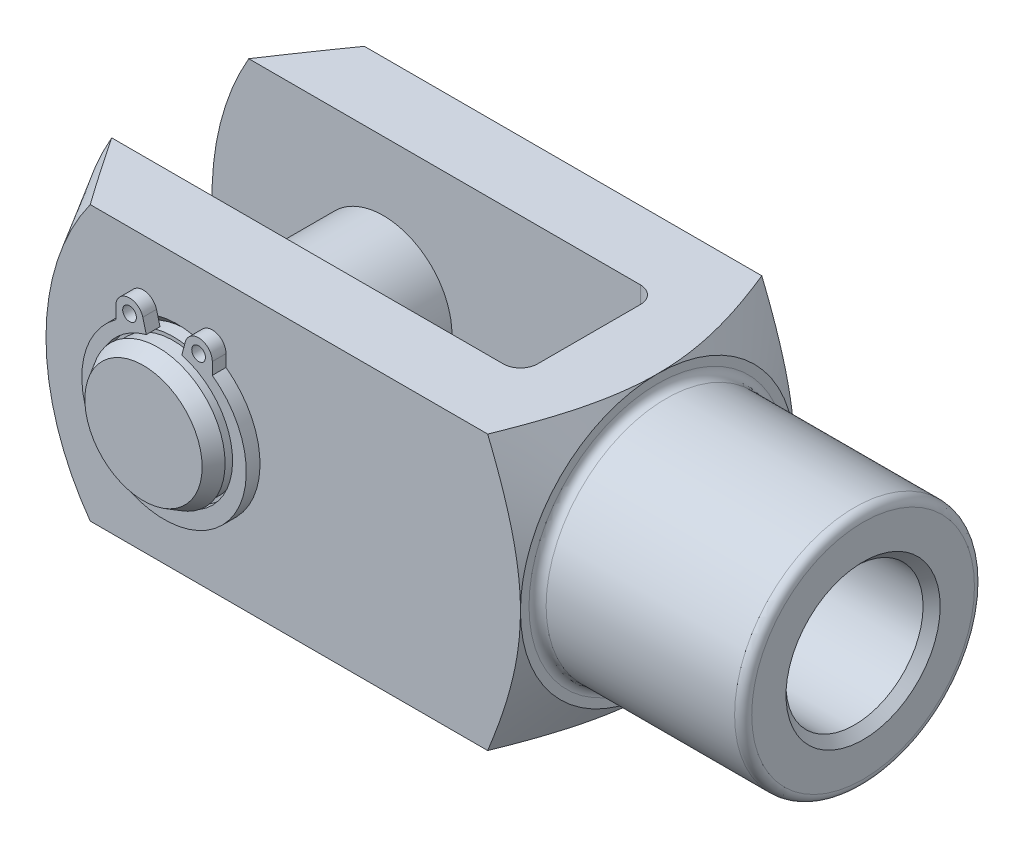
ISO-10303-21;
HEADER;
FILE_DESCRIPTION(('STEP AP214'),'2;1');
FILE_NAME('part.step','',(''),(''),'','','');
FILE_SCHEMA(('AUTOMOTIVE_DESIGN { 1 0 10303 214 1 1 1 1 }'));
ENDSEC;
DATA;
#1=APPLICATION_CONTEXT('core data for automotive mechanical design processes');
#2=APPLICATION_PROTOCOL_DEFINITION('international standard','automotive_design',2000,#1);
#3=PRODUCT_CONTEXT('',#1,'mechanical');
#4=PRODUCT('Part','Part','',(#3));
#5=PRODUCT_RELATED_PRODUCT_CATEGORY('part','',(#4));
#6=PRODUCT_DEFINITION_FORMATION('','',#4);
#7=PRODUCT_DEFINITION_CONTEXT('part definition',#1,'design');
#8=PRODUCT_DEFINITION('design','',#6,#7);
#9=PRODUCT_DEFINITION_SHAPE('','',#8);
#10=(LENGTH_UNIT() NAMED_UNIT(*) SI_UNIT(.MILLI.,.METRE.));
#11=(NAMED_UNIT(*) PLANE_ANGLE_UNIT() SI_UNIT($,.RADIAN.));
#12=(NAMED_UNIT(*) SI_UNIT($,.STERADIAN.) SOLID_ANGLE_UNIT());
#13=UNCERTAINTY_MEASURE_WITH_UNIT(LENGTH_MEASURE(1.E-05),#10,'distance_accuracy_value','');
#14=(GEOMETRIC_REPRESENTATION_CONTEXT(3) GLOBAL_UNCERTAINTY_ASSIGNED_CONTEXT((#13)) GLOBAL_UNIT_ASSIGNED_CONTEXT((#10,
#11,#12)) REPRESENTATION_CONTEXT('',''));
#15=CARTESIAN_POINT('',(0.,0.,0.));
#16=DIRECTION('',(0.,0.,1.));
#17=DIRECTION('',(1.,0.,0.));
#18=AXIS2_PLACEMENT_3D('',#15,#16,#17);
#19=CARTESIAN_POINT('',(-32.,0.,10.));
#20=DIRECTION('',(0.,0.,-1.));
#21=DIRECTION('',(-1.,0.,0.));
#22=AXIS2_PLACEMENT_3D('',#19,#20,#21);
#23=CYLINDRICAL_SURFACE('',#22,4.);
#24=CARTESIAN_POINT('',(-32.,0.,8.25));
#25=DIRECTION('',(0.,0.,1.));
#26=DIRECTION('',(1.,0.,0.));
#27=AXIS2_PLACEMENT_3D('',#24,#25,#26);
#28=CIRCLE('',#27,4.);
#29=CARTESIAN_POINT('',(-28.,0.,8.25));
#30=VERTEX_POINT('',#29);
#31=EDGE_CURVE('P0_E50',#30,#30,#28,.T.);
#32=ORIENTED_EDGE('',*,*,#31,.F.);
#33=EDGE_LOOP('',(#32));
#34=FACE_BOUND('',#33,.T.);
#35=CARTESIAN_POINT('',(-32.,0.,-8.25));
#36=DIRECTION('',(0.,0.,1.));
#37=DIRECTION('',(1.,0.,0.));
#38=AXIS2_PLACEMENT_3D('',#35,#36,#37);
#39=CIRCLE('',#38,4.);
#40=CARTESIAN_POINT('',(-28.,0.,-8.25));
#41=VERTEX_POINT('',#40);
#42=EDGE_CURVE('P0_E39',#41,#41,#39,.T.);
#43=ORIENTED_EDGE('',*,*,#42,.T.);
#44=EDGE_LOOP('',(#43));
#45=FACE_BOUND('',#44,.T.);
#46=ADVANCED_FACE('P0_F14',(#34,#45),#23,.T.);
#47=CARTESIAN_POINT('',(-32.,4.,-9.15));
#48=DIRECTION('',(0.,0.,-1.));
#49=DIRECTION('',(-1.,0.,0.));
#50=AXIS2_PLACEMENT_3D('',#47,#48,#49);
#51=PLANE('',#50);
#52=CARTESIAN_POINT('',(-32.,0.,-9.15));
#53=DIRECTION('',(0.,0.,-1.));
#54=DIRECTION('',(-1.,0.,0.));
#55=AXIS2_PLACEMENT_3D('',#52,#53,#54);
#56=CIRCLE('',#55,3.91339745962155);
#57=CARTESIAN_POINT('',(-35.9133974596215,0.,-9.15));
#58=VERTEX_POINT('',#57);
#59=EDGE_CURVE('P0_E27',#58,#58,#56,.F.);
#60=ORIENTED_EDGE('',*,*,#59,.T.);
#61=EDGE_LOOP('',(#60));
#62=FACE_BOUND('',#61,.T.);
#63=CARTESIAN_POINT('',(-32.,0.,-9.15));
#64=DIRECTION('',(0.,0.,1.));
#65=DIRECTION('',(1.,0.,0.));
#66=AXIS2_PLACEMENT_3D('',#63,#64,#65);
#67=CIRCLE('',#66,3.8);
#68=CARTESIAN_POINT('',(-28.2,0.,-9.15));
#69=VERTEX_POINT('',#68);
#70=EDGE_CURVE('P0_E31',#69,#69,#67,.T.);
#71=ORIENTED_EDGE('',*,*,#70,.F.);
#72=EDGE_LOOP('',(#71));
#73=FACE_BOUND('',#72,.T.);
#74=ADVANCED_FACE('P0_F58',(#62,#73),#51,.F.);
#75=CARTESIAN_POINT('',(-32.,0.,8.99999999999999));
#76=DIRECTION('',(0.,0.,1.));
#77=DIRECTION('',(1.,0.,0.));
#78=AXIS2_PLACEMENT_3D('',#75,#76,#77);
#79=CYLINDRICAL_SURFACE('',#78,3.8);
#80=CARTESIAN_POINT('',(-32.,0.,-8.25));
#81=DIRECTION('',(0.,0.,1.));
#82=DIRECTION('',(1.,0.,0.));
#83=AXIS2_PLACEMENT_3D('',#80,#81,#82);
#84=CIRCLE('',#83,3.8);
#85=CARTESIAN_POINT('',(-28.2,0.,-8.25));
#86=VERTEX_POINT('',#85);
#87=EDGE_CURVE('P0_E35',#86,#86,#84,.T.);
#88=ORIENTED_EDGE('',*,*,#87,.F.);
#89=EDGE_LOOP('',(#88));
#90=FACE_BOUND('',#89,.T.);
#91=ORIENTED_EDGE('',*,*,#70,.T.);
#92=EDGE_LOOP('',(#91));
#93=FACE_BOUND('',#92,.T.);
#94=ADVANCED_FACE('P0_F66',(#90,#93),#79,.T.);
#95=CARTESIAN_POINT('',(-32.,4.,-8.25));
#96=DIRECTION('',(0.,0.,1.));
#97=DIRECTION('',(1.,0.,0.));
#98=AXIS2_PLACEMENT_3D('',#95,#96,#97);
#99=PLANE('',#98);
#100=ORIENTED_EDGE('',*,*,#42,.F.);
#101=EDGE_LOOP('',(#100));
#102=FACE_BOUND('',#101,.T.);
#103=ORIENTED_EDGE('',*,*,#87,.T.);
#104=EDGE_LOOP('',(#103));
#105=FACE_BOUND('',#104,.T.);
#106=ADVANCED_FACE('P0_F62',(#102,#105),#99,.F.);
#107=CARTESIAN_POINT('',(-32.,0.,-10.));
#108=DIRECTION('',(0.,0.,1.));
#109=DIRECTION('',(1.,0.,0.));
#110=AXIS2_PLACEMENT_3D('',#107,#108,#109);
#111=PLANE('',#110);
#112=CARTESIAN_POINT('',(-32.,0.,-10.));
#113=DIRECTION('',(0.,0.,1.));
#114=DIRECTION('',(1.,0.,0.));
#115=AXIS2_PLACEMENT_3D('',#112,#113,#114);
#116=CIRCLE('',#115,3.42264973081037);
#117=CARTESIAN_POINT('',(-28.5773502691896,0.,-10.));
#118=VERTEX_POINT('',#117);
#119=EDGE_CURVE('P0_E22',#118,#118,#116,.F.);
#120=ORIENTED_EDGE('',*,*,#119,.T.);
#121=EDGE_LOOP('',(#120));
#122=FACE_BOUND('',#121,.T.);
#123=ADVANCED_FACE('P0_F65',(#122),#111,.F.);
#124=CARTESIAN_POINT('',(-32.,0.,-8.99999999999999));
#125=DIRECTION('',(0.,0.,1.));
#126=DIRECTION('',(1.,0.,0.));
#127=AXIS2_PLACEMENT_3D('',#124,#125,#126);
#128=CONICAL_SURFACE('',#127,4.,0.523598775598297);
#129=ORIENTED_EDGE('',*,*,#59,.F.);
#130=EDGE_LOOP('',(#129));
#131=FACE_BOUND('',#130,.T.);
#132=ORIENTED_EDGE('',*,*,#119,.F.);
#133=EDGE_LOOP('',(#132));
#134=FACE_BOUND('',#133,.T.);
#135=ADVANCED_FACE('P0_F84',(#131,#134),#128,.T.);
#136=CARTESIAN_POINT('',(-32.,4.,8.25));
#137=DIRECTION('',(0.,0.,-1.));
#138=DIRECTION('',(-1.,0.,0.));
#139=AXIS2_PLACEMENT_3D('',#136,#137,#138);
#140=PLANE('',#139);
#141=CARTESIAN_POINT('',(-32.,0.,8.25));
#142=DIRECTION('',(0.,0.,1.));
#143=DIRECTION('',(1.,0.,0.));
#144=AXIS2_PLACEMENT_3D('',#141,#142,#143);
#145=CIRCLE('',#144,3.8);
#146=CARTESIAN_POINT('',(-28.2,0.,8.25));
#147=VERTEX_POINT('',#146);
#148=EDGE_CURVE('P0_E44',#147,#147,#145,.T.);
#149=ORIENTED_EDGE('',*,*,#148,.F.);
#150=EDGE_LOOP('',(#149));
#151=FACE_BOUND('',#150,.T.);
#152=ORIENTED_EDGE('',*,*,#31,.T.);
#153=EDGE_LOOP('',(#152));
#154=FACE_BOUND('',#153,.T.);
#155=ADVANCED_FACE('P0_F54',(#151,#154),#140,.F.);
#156=CARTESIAN_POINT('',(-32.,0.,8.99999999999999));
#157=DIRECTION('',(0.,0.,1.));
#158=DIRECTION('',(1.,0.,0.));
#159=AXIS2_PLACEMENT_3D('',#156,#157,#158);
#160=CYLINDRICAL_SURFACE('',#159,3.8);
#161=CARTESIAN_POINT('',(-32.,0.,9.15));
#162=DIRECTION('',(0.,0.,1.));
#163=DIRECTION('',(1.,0.,0.));
#164=AXIS2_PLACEMENT_3D('',#161,#162,#163);
#165=CIRCLE('',#164,3.8);
#166=CARTESIAN_POINT('',(-28.2,0.,9.15));
#167=VERTEX_POINT('',#166);
#168=EDGE_CURVE('P0_E47',#167,#167,#165,.T.);
#169=ORIENTED_EDGE('',*,*,#168,.F.);
#170=EDGE_LOOP('',(#169));
#171=FACE_BOUND('',#170,.T.);
#172=ORIENTED_EDGE('',*,*,#148,.T.);
#173=EDGE_LOOP('',(#172));
#174=FACE_BOUND('',#173,.T.);
#175=ADVANCED_FACE('P0_F91',(#171,#174),#160,.T.);
#176=CARTESIAN_POINT('',(-32.,4.,9.15));
#177=DIRECTION('',(0.,0.,1.));
#178=DIRECTION('',(1.,0.,0.));
#179=AXIS2_PLACEMENT_3D('',#176,#177,#178);
#180=PLANE('',#179);
#181=CARTESIAN_POINT('',(-32.,0.,9.15));
#182=DIRECTION('',(0.,0.,1.));
#183=DIRECTION('',(1.,0.,0.));
#184=AXIS2_PLACEMENT_3D('',#181,#182,#183);
#185=CIRCLE('',#184,3.91339745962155);
#186=CARTESIAN_POINT('',(-28.0866025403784,0.,9.15));
#187=VERTEX_POINT('',#186);
#188=EDGE_CURVE('P0_E18',#187,#187,#185,.F.);
#189=ORIENTED_EDGE('',*,*,#188,.T.);
#190=EDGE_LOOP('',(#189));
#191=FACE_BOUND('',#190,.T.);
#192=ORIENTED_EDGE('',*,*,#168,.T.);
#193=EDGE_LOOP('',(#192));
#194=FACE_BOUND('',#193,.T.);
#195=ADVANCED_FACE('P0_F82',(#191,#194),#180,.F.);
#196=CARTESIAN_POINT('',(-32.,0.,10.));
#197=DIRECTION('',(0.,0.,1.));
#198=DIRECTION('',(1.,0.,0.));
#199=AXIS2_PLACEMENT_3D('',#196,#197,#198);
#200=PLANE('',#199);
#201=CARTESIAN_POINT('',(-32.,0.,10.));
#202=DIRECTION('',(0.,0.,1.));
#203=DIRECTION('',(1.,0.,0.));
#204=AXIS2_PLACEMENT_3D('',#201,#202,#203);
#205=CIRCLE('',#204,3.42264973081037);
#206=CARTESIAN_POINT('',(-28.5773502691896,0.,10.));
#207=VERTEX_POINT('',#206);
#208=EDGE_CURVE('P0_E10',#207,#207,#205,.T.);
#209=ORIENTED_EDGE('',*,*,#208,.T.);
#210=EDGE_LOOP('',(#209));
#211=FACE_BOUND('',#210,.T.);
#212=ADVANCED_FACE('P0_F79',(#211),#200,.T.);
#213=CARTESIAN_POINT('',(-32.,0.,10.));
#214=DIRECTION('',(0.,0.,-1.));
#215=DIRECTION('',(-1.,0.,0.));
#216=AXIS2_PLACEMENT_3D('',#213,#214,#215);
#217=CONICAL_SURFACE('',#216,3.42264973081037,0.523598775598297);
#218=ORIENTED_EDGE('',*,*,#188,.F.);
#219=EDGE_LOOP('',(#218));
#220=FACE_BOUND('',#219,.T.);
#221=ORIENTED_EDGE('',*,*,#208,.F.);
#222=EDGE_LOOP('',(#221));
#223=FACE_BOUND('',#222,.T.);
#224=ADVANCED_FACE('P0_F16',(#220,#223),#217,.T.);
#225=CLOSED_SHELL('',(#46,#74,#94,#106,#123,#135,#155,#175,#195,#212,#224));
#226=MANIFOLD_SOLID_BREP('P0_B1',#225);
#227=CARTESIAN_POINT('',(-32.,0.,8.79999999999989));
#228=DIRECTION('',(0.,0.,1.));
#229=DIRECTION('',(1.,0.,0.));
#230=AXIS2_PLACEMENT_3D('',#227,#228,#229);
#231=PLANE('',#230);
#232=CARTESIAN_POINT('',(-34.0150720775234,4.42938873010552,8.79999999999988));
#233=DIRECTION('',(0.,0.,1.));
#234=DIRECTION('',(1.,0.,0.));
#235=AXIS2_PLACEMENT_3D('',#232,#233,#234);
#236=CIRCLE('',#235,0.4);
#237=CARTESIAN_POINT('',(-33.6150720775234,4.42938873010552,8.79999999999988));
#238=VERTEX_POINT('',#237);
#239=EDGE_CURVE('P1_E117',#238,#238,#236,.T.);
#240=ORIENTED_EDGE('',*,*,#239,.F.);
#241=EDGE_LOOP('',(#240));
#242=FACE_BOUND('',#241,.T.);
#243=CARTESIAN_POINT('',(-32.,0.,8.79999999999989));
#244=DIRECTION('',(0.,0.,-1.));
#245=DIRECTION('',(1.,0.,0.));
#246=AXIS2_PLACEMENT_3D('',#243,#244,#245);
#247=CIRCLE('',#246,4.);
#248=CARTESIAN_POINT('',(-30.96472381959,3.86370330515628,8.79999999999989));
#249=VERTEX_POINT('',#248);
#250=CARTESIAN_POINT('',(-33.0352761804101,3.86370330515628,8.79999999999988));
#251=VERTEX_POINT('',#250);
#252=EDGE_CURVE('P1_E128',#249,#251,#247,.T.);
#253=ORIENTED_EDGE('',*,*,#252,.T.);
#254=DIRECTION('',(-0.258819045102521,0.965925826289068,0.));
#255=VECTOR('',#254,1.);
#256=CARTESIAN_POINT('',(-33.0352761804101,3.86370330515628,8.79999999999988));
#257=LINE('',#256,#255);
#258=CARTESIAN_POINT('',(-33.2423314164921,4.63644396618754,8.79999999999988));
#259=VERTEX_POINT('',#258);
#260=EDGE_CURVE('P1_E76',#251,#259,#257,.T.);
#261=ORIENTED_EDGE('',*,*,#260,.T.);
#262=CARTESIAN_POINT('',(-34.0150720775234,4.42938873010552,8.79999999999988));
#263=DIRECTION('',(0.,0.,1.));
#264=DIRECTION('',(1.,0.,0.));
#265=AXIS2_PLACEMENT_3D('',#262,#263,#264);
#266=CIRCLE('',#265,0.8);
#267=CARTESIAN_POINT('',(-34.8150720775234,4.42938873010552,8.79999999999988));
#268=VERTEX_POINT('',#267);
#269=EDGE_CURVE('P1_E143',#259,#268,#266,.T.);
#270=ORIENTED_EDGE('',*,*,#269,.T.);
#271=DIRECTION('',(0.,-1.,0.));
#272=VECTOR('',#271,1.);
#273=CARTESIAN_POINT('',(-34.8150720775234,4.42938873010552,8.79999999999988));
#274=LINE('',#273,#272);
#275=CARTESIAN_POINT('',(-34.8150720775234,3.72784891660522,8.79999999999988));
#276=VERTEX_POINT('',#275);
#277=EDGE_CURVE('P1_E156',#268,#276,#274,.T.);
#278=ORIENTED_EDGE('',*,*,#277,.T.);
#279=CARTESIAN_POINT('',(-32.,-0.159999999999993,8.79999999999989));
#280=DIRECTION('',(0.,0.,1.));
#281=DIRECTION('',(1.,0.,0.));
#282=AXIS2_PLACEMENT_3D('',#279,#280,#281);
#283=CIRCLE('',#282,4.8);
#284=CARTESIAN_POINT('',(-29.1849279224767,3.72784891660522,8.7999999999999));
#285=VERTEX_POINT('',#284);
#286=EDGE_CURVE('P1_E95',#276,#285,#283,.T.);
#287=ORIENTED_EDGE('',*,*,#286,.T.);
#288=DIRECTION('',(0.,1.,0.));
#289=VECTOR('',#288,1.);
#290=CARTESIAN_POINT('',(-29.1849279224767,4.42938873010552,8.7999999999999));
#291=LINE('',#290,#289);
#292=CARTESIAN_POINT('',(-29.1849279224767,4.42938873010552,8.7999999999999));
#293=VERTEX_POINT('',#292);
#294=EDGE_CURVE('P1_E89',#285,#293,#291,.T.);
#295=ORIENTED_EDGE('',*,*,#294,.T.);
#296=CARTESIAN_POINT('',(-29.9849279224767,4.42938873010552,8.79999999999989));
#297=DIRECTION('',(0.,0.,1.));
#298=DIRECTION('',(-1.,0.,0.));
#299=AXIS2_PLACEMENT_3D('',#296,#297,#298);
#300=CIRCLE('',#299,0.8);
#301=CARTESIAN_POINT('',(-30.7576685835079,4.63644396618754,8.79999999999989));
#302=VERTEX_POINT('',#301);
#303=EDGE_CURVE('P1_E93',#293,#302,#300,.T.);
#304=ORIENTED_EDGE('',*,*,#303,.T.);
#305=DIRECTION('',(-0.258819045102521,-0.965925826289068,0.));
#306=VECTOR('',#305,1.);
#307=CARTESIAN_POINT('',(-30.96472381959,3.86370330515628,8.79999999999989));
#308=LINE('',#307,#306);
#309=EDGE_CURVE('P1_E33',#302,#249,#308,.T.);
#310=ORIENTED_EDGE('',*,*,#309,.T.);
#311=EDGE_LOOP('',(#253,#261,#270,#278,#287,#295,#304,#310));
#312=FACE_BOUND('',#311,.T.);
#313=CARTESIAN_POINT('',(-29.9849279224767,4.42938873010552,8.79999999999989));
#314=DIRECTION('',(0.,0.,1.));
#315=DIRECTION('',(-1.,0.,0.));
#316=AXIS2_PLACEMENT_3D('',#313,#314,#315);
#317=CIRCLE('',#316,0.4);
#318=CARTESIAN_POINT('',(-30.3849279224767,4.42938873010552,8.79999999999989));
#319=VERTEX_POINT('',#318);
#320=EDGE_CURVE('P1_E165',#319,#319,#317,.T.);
#321=ORIENTED_EDGE('',*,*,#320,.F.);
#322=EDGE_LOOP('',(#321));
#323=FACE_BOUND('',#322,.T.);
#324=ADVANCED_FACE('P1_F16',(#242,#312,#323),#231,.T.);
#325=CARTESIAN_POINT('',(-32.,0.,7.99999999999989));
#326=DIRECTION('',(0.,0.,1.));
#327=DIRECTION('',(1.,0.,0.));
#328=AXIS2_PLACEMENT_3D('',#325,#326,#327);
#329=PLANE('',#328);
#330=CARTESIAN_POINT('',(-34.0150720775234,4.42938873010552,7.99999999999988));
#331=DIRECTION('',(0.,0.,1.));
#332=DIRECTION('',(1.,0.,0.));
#333=AXIS2_PLACEMENT_3D('',#330,#331,#332);
#334=CIRCLE('',#333,0.4);
#335=CARTESIAN_POINT('',(-33.6150720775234,4.42938873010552,7.99999999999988));
#336=VERTEX_POINT('',#335);
#337=EDGE_CURVE('P1_E162',#336,#336,#334,.T.);
#338=ORIENTED_EDGE('',*,*,#337,.T.);
#339=EDGE_LOOP('',(#338));
#340=FACE_BOUND('',#339,.T.);
#341=CARTESIAN_POINT('',(-32.,0.,7.99999999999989));
#342=DIRECTION('',(0.,0.,-1.));
#343=DIRECTION('',(1.,0.,0.));
#344=AXIS2_PLACEMENT_3D('',#341,#342,#343);
#345=CIRCLE('',#344,4.);
#346=CARTESIAN_POINT('',(-30.9647238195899,3.86370330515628,7.99999999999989));
#347=VERTEX_POINT('',#346);
#348=CARTESIAN_POINT('',(-33.0352761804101,3.86370330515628,7.99999999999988));
#349=VERTEX_POINT('',#348);
#350=EDGE_CURVE('P1_E113',#347,#349,#345,.T.);
#351=ORIENTED_EDGE('',*,*,#350,.F.);
#352=DIRECTION('',(-0.258819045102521,-0.965925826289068,0.));
#353=VECTOR('',#352,1.);
#354=CARTESIAN_POINT('',(-30.9647238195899,3.86370330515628,7.99999999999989));
#355=LINE('',#354,#353);
#356=CARTESIAN_POINT('',(-30.7576685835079,4.63644396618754,7.99999999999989));
#357=VERTEX_POINT('',#356);
#358=EDGE_CURVE('P1_E68',#357,#347,#355,.T.);
#359=ORIENTED_EDGE('',*,*,#358,.F.);
#360=CARTESIAN_POINT('',(-29.9849279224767,4.42938873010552,7.99999999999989));
#361=DIRECTION('',(0.,0.,1.));
#362=DIRECTION('',(-1.,0.,0.));
#363=AXIS2_PLACEMENT_3D('',#360,#361,#362);
#364=CIRCLE('',#363,0.8);
#365=CARTESIAN_POINT('',(-29.1849279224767,4.42938873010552,7.9999999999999));
#366=VERTEX_POINT('',#365);
#367=EDGE_CURVE('P1_E62',#366,#357,#364,.T.);
#368=ORIENTED_EDGE('',*,*,#367,.F.);
#369=DIRECTION('',(0.,1.,0.));
#370=VECTOR('',#369,1.);
#371=CARTESIAN_POINT('',(-29.1849279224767,4.42938873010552,7.9999999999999));
#372=LINE('',#371,#370);
#373=CARTESIAN_POINT('',(-29.1849279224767,3.72784891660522,7.9999999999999));
#374=VERTEX_POINT('',#373);
#375=EDGE_CURVE('P1_E103',#374,#366,#372,.T.);
#376=ORIENTED_EDGE('',*,*,#375,.F.);
#377=CARTESIAN_POINT('',(-32.,-0.159999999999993,7.99999999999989));
#378=DIRECTION('',(0.,0.,1.));
#379=DIRECTION('',(1.,0.,0.));
#380=AXIS2_PLACEMENT_3D('',#377,#378,#379);
#381=CIRCLE('',#380,4.8);
#382=CARTESIAN_POINT('',(-34.8150720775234,3.72784891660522,7.99999999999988));
#383=VERTEX_POINT('',#382);
#384=EDGE_CURVE('P1_E123',#383,#374,#381,.T.);
#385=ORIENTED_EDGE('',*,*,#384,.F.);
#386=DIRECTION('',(0.,-1.,0.));
#387=VECTOR('',#386,1.);
#388=CARTESIAN_POINT('',(-34.8150720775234,4.42938873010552,7.99999999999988));
#389=LINE('',#388,#387);
#390=CARTESIAN_POINT('',(-34.8150720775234,4.42938873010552,7.99999999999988));
#391=VERTEX_POINT('',#390);
#392=EDGE_CURVE('P1_E121',#391,#383,#389,.T.);
#393=ORIENTED_EDGE('',*,*,#392,.F.);
#394=CARTESIAN_POINT('',(-34.0150720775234,4.42938873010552,7.99999999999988));
#395=DIRECTION('',(0.,0.,1.));
#396=DIRECTION('',(1.,0.,0.));
#397=AXIS2_PLACEMENT_3D('',#394,#395,#396);
#398=CIRCLE('',#397,0.8);
#399=CARTESIAN_POINT('',(-33.2423314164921,4.63644396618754,7.99999999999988));
#400=VERTEX_POINT('',#399);
#401=EDGE_CURVE('P1_E119',#400,#391,#398,.T.);
#402=ORIENTED_EDGE('',*,*,#401,.F.);
#403=DIRECTION('',(-0.258819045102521,0.965925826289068,0.));
#404=VECTOR('',#403,1.);
#405=CARTESIAN_POINT('',(-33.0352761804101,3.86370330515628,7.99999999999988));
#406=LINE('',#405,#404);
#407=EDGE_CURVE('P1_E116',#349,#400,#406,.T.);
#408=ORIENTED_EDGE('',*,*,#407,.F.);
#409=EDGE_LOOP('',(#351,#359,#368,#376,#385,#393,#402,#408));
#410=FACE_BOUND('',#409,.T.);
#411=CARTESIAN_POINT('',(-29.9849279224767,4.42938873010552,7.99999999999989));
#412=DIRECTION('',(0.,0.,1.));
#413=DIRECTION('',(-1.,0.,0.));
#414=AXIS2_PLACEMENT_3D('',#411,#412,#413);
#415=CIRCLE('',#414,0.4);
#416=CARTESIAN_POINT('',(-30.3849279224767,4.42938873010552,7.99999999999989));
#417=VERTEX_POINT('',#416);
#418=EDGE_CURVE('P1_E168',#417,#417,#415,.T.);
#419=ORIENTED_EDGE('',*,*,#418,.T.);
#420=EDGE_LOOP('',(#419));
#421=FACE_BOUND('',#420,.T.);
#422=ADVANCED_FACE('P1_F147',(#340,#410,#421),#329,.F.);
#423=CARTESIAN_POINT('',(-32.,0.,8.79999999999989));
#424=DIRECTION('',(0.,0.,-1.));
#425=DIRECTION('',(-1.,0.,0.));
#426=AXIS2_PLACEMENT_3D('',#423,#424,#425);
#427=CYLINDRICAL_SURFACE('',#426,4.);
#428=ORIENTED_EDGE('',*,*,#350,.T.);
#429=DIRECTION('',(0.,0.,-1.));
#430=VECTOR('',#429,1.);
#431=CARTESIAN_POINT('',(-33.0352761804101,3.86370330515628,8.79999999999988));
#432=LINE('',#431,#430);
#433=EDGE_CURVE('P1_E11',#251,#349,#432,.T.);
#434=ORIENTED_EDGE('',*,*,#433,.F.);
#435=ORIENTED_EDGE('',*,*,#252,.F.);
#436=DIRECTION('',(0.,0.,-1.));
#437=VECTOR('',#436,1.);
#438=CARTESIAN_POINT('',(-30.96472381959,3.86370330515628,8.79999999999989));
#439=LINE('',#438,#437);
#440=EDGE_CURVE('P1_E109',#249,#347,#439,.T.);
#441=ORIENTED_EDGE('',*,*,#440,.T.);
#442=EDGE_LOOP('',(#428,#434,#435,#441));
#443=FACE_BOUND('',#442,.T.);
#444=ADVANCED_FACE('P1_F18',(#443),#427,.F.);
#445=CARTESIAN_POINT('',(-33.0352761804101,3.86370330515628,8.79999999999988));
#446=DIRECTION('',(-0.965925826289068,-0.258819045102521,0.));
#447=DIRECTION('',(0.258819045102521,-0.965925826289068,0.));
#448=AXIS2_PLACEMENT_3D('',#445,#446,#447);
#449=PLANE('',#448);
#450=ORIENTED_EDGE('',*,*,#407,.T.);
#451=DIRECTION('',(0.,0.,-1.));
#452=VECTOR('',#451,1.);
#453=CARTESIAN_POINT('',(-33.2423314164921,4.63644396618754,8.79999999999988));
#454=LINE('',#453,#452);
#455=EDGE_CURVE('P1_E25',#259,#400,#454,.T.);
#456=ORIENTED_EDGE('',*,*,#455,.F.);
#457=ORIENTED_EDGE('',*,*,#260,.F.);
#458=ORIENTED_EDGE('',*,*,#433,.T.);
#459=EDGE_LOOP('',(#450,#456,#457,#458));
#460=FACE_BOUND('',#459,.T.);
#461=ADVANCED_FACE('P1_F202',(#460),#449,.F.);
#462=CARTESIAN_POINT('',(-34.0150720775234,4.42938873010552,8.79999999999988));
#463=DIRECTION('',(0.,0.,-1.));
#464=DIRECTION('',(-1.,0.,0.));
#465=AXIS2_PLACEMENT_3D('',#462,#463,#464);
#466=CYLINDRICAL_SURFACE('',#465,0.8);
#467=ORIENTED_EDGE('',*,*,#401,.T.);
#468=DIRECTION('',(0.,0.,-1.));
#469=VECTOR('',#468,1.);
#470=CARTESIAN_POINT('',(-34.8150720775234,4.42938873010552,8.79999999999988));
#471=LINE('',#470,#469);
#472=EDGE_CURVE('P1_E135',#268,#391,#471,.T.);
#473=ORIENTED_EDGE('',*,*,#472,.F.);
#474=ORIENTED_EDGE('',*,*,#269,.F.);
#475=ORIENTED_EDGE('',*,*,#455,.T.);
#476=EDGE_LOOP('',(#467,#473,#474,#475));
#477=FACE_BOUND('',#476,.T.);
#478=ADVANCED_FACE('P1_F141',(#477),#466,.T.);
#479=CARTESIAN_POINT('',(-34.8150720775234,4.42938873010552,8.79999999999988));
#480=DIRECTION('',(1.,0.,0.));
#481=DIRECTION('',(0.,1.,0.));
#482=AXIS2_PLACEMENT_3D('',#479,#480,#481);
#483=PLANE('',#482);
#484=ORIENTED_EDGE('',*,*,#392,.T.);
#485=DIRECTION('',(0.,0.,-1.));
#486=VECTOR('',#485,1.);
#487=CARTESIAN_POINT('',(-34.8150720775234,3.72784891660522,8.79999999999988));
#488=LINE('',#487,#486);
#489=EDGE_CURVE('P1_E132',#276,#383,#488,.T.);
#490=ORIENTED_EDGE('',*,*,#489,.F.);
#491=ORIENTED_EDGE('',*,*,#277,.F.);
#492=ORIENTED_EDGE('',*,*,#472,.T.);
#493=EDGE_LOOP('',(#484,#490,#491,#492));
#494=FACE_BOUND('',#493,.T.);
#495=ADVANCED_FACE('P1_F152',(#494),#483,.F.);
#496=CARTESIAN_POINT('',(-32.,-0.159999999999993,8.79999999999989));
#497=DIRECTION('',(0.,0.,-1.));
#498=DIRECTION('',(-1.,0.,0.));
#499=AXIS2_PLACEMENT_3D('',#496,#497,#498);
#500=CYLINDRICAL_SURFACE('',#499,4.8);
#501=ORIENTED_EDGE('',*,*,#384,.T.);
#502=DIRECTION('',(0.,0.,-1.));
#503=VECTOR('',#502,1.);
#504=CARTESIAN_POINT('',(-29.1849279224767,3.72784891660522,8.7999999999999));
#505=LINE('',#504,#503);
#506=EDGE_CURVE('P1_E104',#285,#374,#505,.T.);
#507=ORIENTED_EDGE('',*,*,#506,.F.);
#508=ORIENTED_EDGE('',*,*,#286,.F.);
#509=ORIENTED_EDGE('',*,*,#489,.T.);
#510=EDGE_LOOP('',(#501,#507,#508,#509));
#511=FACE_BOUND('',#510,.T.);
#512=ADVANCED_FACE('P1_F155',(#511),#500,.T.);
#513=CARTESIAN_POINT('',(-29.1849279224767,4.42938873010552,8.7999999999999));
#514=DIRECTION('',(-1.,0.,0.));
#515=DIRECTION('',(0.,-1.,0.));
#516=AXIS2_PLACEMENT_3D('',#513,#514,#515);
#517=PLANE('',#516);
#518=ORIENTED_EDGE('',*,*,#375,.T.);
#519=DIRECTION('',(0.,0.,-1.));
#520=VECTOR('',#519,1.);
#521=CARTESIAN_POINT('',(-29.1849279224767,4.42938873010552,8.7999999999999));
#522=LINE('',#521,#520);
#523=EDGE_CURVE('P1_E100',#293,#366,#522,.T.);
#524=ORIENTED_EDGE('',*,*,#523,.F.);
#525=ORIENTED_EDGE('',*,*,#294,.F.);
#526=ORIENTED_EDGE('',*,*,#506,.T.);
#527=EDGE_LOOP('',(#518,#524,#525,#526));
#528=FACE_BOUND('',#527,.T.);
#529=ADVANCED_FACE('P1_F101',(#528),#517,.F.);
#530=CARTESIAN_POINT('',(-29.9849279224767,4.42938873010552,8.79999999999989));
#531=DIRECTION('',(0.,0.,-1.));
#532=DIRECTION('',(-1.,0.,0.));
#533=AXIS2_PLACEMENT_3D('',#530,#531,#532);
#534=CYLINDRICAL_SURFACE('',#533,0.8);
#535=ORIENTED_EDGE('',*,*,#367,.T.);
#536=DIRECTION('',(0.,0.,-1.));
#537=VECTOR('',#536,1.);
#538=CARTESIAN_POINT('',(-30.7576685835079,4.63644396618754,8.79999999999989));
#539=LINE('',#538,#537);
#540=EDGE_CURVE('P1_E105',#302,#357,#539,.T.);
#541=ORIENTED_EDGE('',*,*,#540,.F.);
#542=ORIENTED_EDGE('',*,*,#303,.F.);
#543=ORIENTED_EDGE('',*,*,#523,.T.);
#544=EDGE_LOOP('',(#535,#541,#542,#543));
#545=FACE_BOUND('',#544,.T.);
#546=ADVANCED_FACE('P1_F107',(#545),#534,.T.);
#547=CARTESIAN_POINT('',(-30.96472381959,3.86370330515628,8.79999999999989));
#548=DIRECTION('',(0.965925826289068,-0.258819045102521,0.));
#549=DIRECTION('',(0.258819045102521,0.965925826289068,0.));
#550=AXIS2_PLACEMENT_3D('',#547,#548,#549);
#551=PLANE('',#550);
#552=ORIENTED_EDGE('',*,*,#358,.T.);
#553=ORIENTED_EDGE('',*,*,#440,.F.);
#554=ORIENTED_EDGE('',*,*,#309,.F.);
#555=ORIENTED_EDGE('',*,*,#540,.T.);
#556=EDGE_LOOP('',(#552,#553,#554,#555));
#557=FACE_BOUND('',#556,.T.);
#558=ADVANCED_FACE('P1_F190',(#557),#551,.F.);
#559=CARTESIAN_POINT('',(-34.0150720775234,4.42938873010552,8.79999999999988));
#560=DIRECTION('',(0.,0.,-1.));
#561=DIRECTION('',(-1.,0.,0.));
#562=AXIS2_PLACEMENT_3D('',#559,#560,#561);
#563=CYLINDRICAL_SURFACE('',#562,0.4);
#564=ORIENTED_EDGE('',*,*,#239,.T.);
#565=EDGE_LOOP('',(#564));
#566=FACE_BOUND('',#565,.T.);
#567=ORIENTED_EDGE('',*,*,#337,.F.);
#568=EDGE_LOOP('',(#567));
#569=FACE_BOUND('',#568,.T.);
#570=ADVANCED_FACE('P1_F187',(#566,#569),#563,.F.);
#571=CARTESIAN_POINT('',(-29.9849279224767,4.42938873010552,8.79999999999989));
#572=DIRECTION('',(0.,0.,-1.));
#573=DIRECTION('',(-1.,0.,0.));
#574=AXIS2_PLACEMENT_3D('',#571,#572,#573);
#575=CYLINDRICAL_SURFACE('',#574,0.4);
#576=ORIENTED_EDGE('',*,*,#320,.T.);
#577=EDGE_LOOP('',(#576));
#578=FACE_BOUND('',#577,.T.);
#579=ORIENTED_EDGE('',*,*,#418,.F.);
#580=EDGE_LOOP('',(#579));
#581=FACE_BOUND('',#580,.T.);
#582=ADVANCED_FACE('P1_F174',(#578,#581),#575,.F.);
#583=CLOSED_SHELL('',(#324,#422,#444,#461,#478,#495,#512,#529,#546,#558,#570,#582));
#584=MANIFOLD_SOLID_BREP('P1_B1',#583);
#585=CARTESIAN_POINT('',(-32.,0.,-8.79999999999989));
#586=DIRECTION('',(0.,0.,-1.));
#587=DIRECTION('',(-1.,0.,0.));
#588=AXIS2_PLACEMENT_3D('',#585,#586,#587);
#589=PLANE('',#588);
#590=CARTESIAN_POINT('',(-29.9849279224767,4.42938873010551,-8.7999999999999));
#591=DIRECTION('',(0.,0.,-1.));
#592=DIRECTION('',(-1.,0.,0.));
#593=AXIS2_PLACEMENT_3D('',#590,#591,#592);
#594=CIRCLE('',#593,0.4);
#595=CARTESIAN_POINT('',(-30.3849279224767,4.42938873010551,-8.7999999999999));
#596=VERTEX_POINT('',#595);
#597=EDGE_CURVE('P2_E117',#596,#596,#594,.T.);
#598=ORIENTED_EDGE('',*,*,#597,.F.);
#599=EDGE_LOOP('',(#598));
#600=FACE_BOUND('',#599,.T.);
#601=CARTESIAN_POINT('',(-32.,0.,-8.79999999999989));
#602=DIRECTION('',(0.,0.,1.));
#603=DIRECTION('',(-1.,0.,0.));
#604=AXIS2_PLACEMENT_3D('',#601,#602,#603);
#605=CIRCLE('',#604,4.);
#606=CARTESIAN_POINT('',(-33.0352761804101,3.86370330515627,-8.79999999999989));
#607=VERTEX_POINT('',#606);
#608=CARTESIAN_POINT('',(-30.96472381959,3.86370330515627,-8.7999999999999));
#609=VERTEX_POINT('',#608);
#610=EDGE_CURVE('P2_E128',#607,#609,#605,.T.);
#611=ORIENTED_EDGE('',*,*,#610,.T.);
#612=DIRECTION('',(0.258819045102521,0.965925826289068,0.));
#613=VECTOR('',#612,1.);
#614=CARTESIAN_POINT('',(-30.96472381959,3.86370330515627,-8.7999999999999));
#615=LINE('',#614,#613);
#616=CARTESIAN_POINT('',(-30.7576685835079,4.63644396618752,-8.7999999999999));
#617=VERTEX_POINT('',#616);
#618=EDGE_CURVE('P2_E76',#609,#617,#615,.T.);
#619=ORIENTED_EDGE('',*,*,#618,.T.);
#620=CARTESIAN_POINT('',(-29.9849279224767,4.42938873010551,-8.7999999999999));
#621=DIRECTION('',(0.,0.,-1.));
#622=DIRECTION('',(-1.,0.,0.));
#623=AXIS2_PLACEMENT_3D('',#620,#621,#622);
#624=CIRCLE('',#623,0.8);
#625=CARTESIAN_POINT('',(-29.1849279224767,4.42938873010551,-8.7999999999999));
#626=VERTEX_POINT('',#625);
#627=EDGE_CURVE('P2_E143',#617,#626,#624,.T.);
#628=ORIENTED_EDGE('',*,*,#627,.T.);
#629=DIRECTION('',(0.,-1.,0.));
#630=VECTOR('',#629,1.);
#631=CARTESIAN_POINT('',(-29.1849279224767,4.42938873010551,-8.7999999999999));
#632=LINE('',#631,#630);
#633=CARTESIAN_POINT('',(-29.1849279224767,3.72784891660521,-8.7999999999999));
#634=VERTEX_POINT('',#633);
#635=EDGE_CURVE('P2_E156',#626,#634,#632,.T.);
#636=ORIENTED_EDGE('',*,*,#635,.T.);
#637=CARTESIAN_POINT('',(-32.,-0.160000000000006,-8.79999999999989));
#638=DIRECTION('',(0.,0.,-1.));
#639=DIRECTION('',(-1.,0.,0.));
#640=AXIS2_PLACEMENT_3D('',#637,#638,#639);
#641=CIRCLE('',#640,4.8);
#642=CARTESIAN_POINT('',(-34.8150720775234,3.72784891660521,-8.79999999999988));
#643=VERTEX_POINT('',#642);
#644=EDGE_CURVE('P2_E95',#634,#643,#641,.T.);
#645=ORIENTED_EDGE('',*,*,#644,.T.);
#646=DIRECTION('',(0.,1.,0.));
#647=VECTOR('',#646,1.);
#648=CARTESIAN_POINT('',(-34.8150720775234,4.42938873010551,-8.79999999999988));
#649=LINE('',#648,#647);
#650=CARTESIAN_POINT('',(-34.8150720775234,4.42938873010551,-8.79999999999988));
#651=VERTEX_POINT('',#650);
#652=EDGE_CURVE('P2_E89',#643,#651,#649,.T.);
#653=ORIENTED_EDGE('',*,*,#652,.T.);
#654=CARTESIAN_POINT('',(-34.0150720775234,4.42938873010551,-8.79999999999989));
#655=DIRECTION('',(0.,0.,-1.));
#656=DIRECTION('',(1.,0.,0.));
#657=AXIS2_PLACEMENT_3D('',#654,#655,#656);
#658=CIRCLE('',#657,0.8);
#659=CARTESIAN_POINT('',(-33.2423314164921,4.63644396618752,-8.79999999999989));
#660=VERTEX_POINT('',#659);
#661=EDGE_CURVE('P2_E93',#651,#660,#658,.T.);
#662=ORIENTED_EDGE('',*,*,#661,.T.);
#663=DIRECTION('',(0.258819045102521,-0.965925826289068,0.));
#664=VECTOR('',#663,1.);
#665=CARTESIAN_POINT('',(-33.0352761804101,3.86370330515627,-8.79999999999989));
#666=LINE('',#665,#664);
#667=EDGE_CURVE('P2_E33',#660,#607,#666,.T.);
#668=ORIENTED_EDGE('',*,*,#667,.T.);
#669=EDGE_LOOP('',(#611,#619,#628,#636,#645,#653,#662,#668));
#670=FACE_BOUND('',#669,.T.);
#671=CARTESIAN_POINT('',(-34.0150720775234,4.42938873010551,-8.79999999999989));
#672=DIRECTION('',(0.,0.,-1.));
#673=DIRECTION('',(1.,0.,0.));
#674=AXIS2_PLACEMENT_3D('',#671,#672,#673);
#675=CIRCLE('',#674,0.4);
#676=CARTESIAN_POINT('',(-33.6150720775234,4.42938873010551,-8.79999999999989));
#677=VERTEX_POINT('',#676);
#678=EDGE_CURVE('P2_E165',#677,#677,#675,.T.);
#679=ORIENTED_EDGE('',*,*,#678,.F.);
#680=EDGE_LOOP('',(#679));
#681=FACE_BOUND('',#680,.T.);
#682=ADVANCED_FACE('P2_F16',(#600,#670,#681),#589,.T.);
#683=CARTESIAN_POINT('',(-32.,0.,-7.99999999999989));
#684=DIRECTION('',(0.,0.,-1.));
#685=DIRECTION('',(-1.,0.,0.));
#686=AXIS2_PLACEMENT_3D('',#683,#684,#685);
#687=PLANE('',#686);
#688=CARTESIAN_POINT('',(-29.9849279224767,4.42938873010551,-7.9999999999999));
#689=DIRECTION('',(0.,0.,-1.));
#690=DIRECTION('',(-1.,0.,0.));
#691=AXIS2_PLACEMENT_3D('',#688,#689,#690);
#692=CIRCLE('',#691,0.4);
#693=CARTESIAN_POINT('',(-30.3849279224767,4.42938873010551,-7.9999999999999));
#694=VERTEX_POINT('',#693);
#695=EDGE_CURVE('P2_E162',#694,#694,#692,.T.);
#696=ORIENTED_EDGE('',*,*,#695,.T.);
#697=EDGE_LOOP('',(#696));
#698=FACE_BOUND('',#697,.T.);
#699=CARTESIAN_POINT('',(-32.,0.,-7.99999999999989));
#700=DIRECTION('',(0.,0.,1.));
#701=DIRECTION('',(-1.,0.,0.));
#702=AXIS2_PLACEMENT_3D('',#699,#700,#701);
#703=CIRCLE('',#702,4.);
#704=CARTESIAN_POINT('',(-33.0352761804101,3.86370330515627,-7.99999999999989));
#705=VERTEX_POINT('',#704);
#706=CARTESIAN_POINT('',(-30.9647238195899,3.86370330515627,-7.9999999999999));
#707=VERTEX_POINT('',#706);
#708=EDGE_CURVE('P2_E113',#705,#707,#703,.T.);
#709=ORIENTED_EDGE('',*,*,#708,.F.);
#710=DIRECTION('',(0.258819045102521,-0.965925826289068,0.));
#711=VECTOR('',#710,1.);
#712=CARTESIAN_POINT('',(-33.0352761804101,3.86370330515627,-7.99999999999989));
#713=LINE('',#712,#711);
#714=CARTESIAN_POINT('',(-33.2423314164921,4.63644396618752,-7.99999999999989));
#715=VERTEX_POINT('',#714);
#716=EDGE_CURVE('P2_E68',#715,#705,#713,.T.);
#717=ORIENTED_EDGE('',*,*,#716,.F.);
#718=CARTESIAN_POINT('',(-34.0150720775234,4.42938873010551,-7.99999999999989));
#719=DIRECTION('',(0.,0.,-1.));
#720=DIRECTION('',(1.,0.,0.));
#721=AXIS2_PLACEMENT_3D('',#718,#719,#720);
#722=CIRCLE('',#721,0.8);
#723=CARTESIAN_POINT('',(-34.8150720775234,4.42938873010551,-7.99999999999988));
#724=VERTEX_POINT('',#723);
#725=EDGE_CURVE('P2_E62',#724,#715,#722,.T.);
#726=ORIENTED_EDGE('',*,*,#725,.F.);
#727=DIRECTION('',(0.,1.,0.));
#728=VECTOR('',#727,1.);
#729=CARTESIAN_POINT('',(-34.8150720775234,4.42938873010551,-7.99999999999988));
#730=LINE('',#729,#728);
#731=CARTESIAN_POINT('',(-34.8150720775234,3.72784891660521,-7.99999999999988));
#732=VERTEX_POINT('',#731);
#733=EDGE_CURVE('P2_E103',#732,#724,#730,.T.);
#734=ORIENTED_EDGE('',*,*,#733,.F.);
#735=CARTESIAN_POINT('',(-32.,-0.160000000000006,-7.99999999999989));
#736=DIRECTION('',(0.,0.,-1.));
#737=DIRECTION('',(-1.,0.,0.));
#738=AXIS2_PLACEMENT_3D('',#735,#736,#737);
#739=CIRCLE('',#738,4.8);
#740=CARTESIAN_POINT('',(-29.1849279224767,3.72784891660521,-7.9999999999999));
#741=VERTEX_POINT('',#740);
#742=EDGE_CURVE('P2_E123',#741,#732,#739,.T.);
#743=ORIENTED_EDGE('',*,*,#742,.F.);
#744=DIRECTION('',(0.,-1.,0.));
#745=VECTOR('',#744,1.);
#746=CARTESIAN_POINT('',(-29.1849279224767,4.42938873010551,-7.9999999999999));
#747=LINE('',#746,#745);
#748=CARTESIAN_POINT('',(-29.1849279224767,4.42938873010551,-7.9999999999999));
#749=VERTEX_POINT('',#748);
#750=EDGE_CURVE('P2_E121',#749,#741,#747,.T.);
#751=ORIENTED_EDGE('',*,*,#750,.F.);
#752=CARTESIAN_POINT('',(-29.9849279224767,4.42938873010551,-7.9999999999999));
#753=DIRECTION('',(0.,0.,-1.));
#754=DIRECTION('',(-1.,0.,0.));
#755=AXIS2_PLACEMENT_3D('',#752,#753,#754);
#756=CIRCLE('',#755,0.8);
#757=CARTESIAN_POINT('',(-30.7576685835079,4.63644396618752,-7.9999999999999));
#758=VERTEX_POINT('',#757);
#759=EDGE_CURVE('P2_E119',#758,#749,#756,.T.);
#760=ORIENTED_EDGE('',*,*,#759,.F.);
#761=DIRECTION('',(0.258819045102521,0.965925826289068,0.));
#762=VECTOR('',#761,1.);
#763=CARTESIAN_POINT('',(-30.9647238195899,3.86370330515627,-7.9999999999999));
#764=LINE('',#763,#762);
#765=EDGE_CURVE('P2_E116',#707,#758,#764,.T.);
#766=ORIENTED_EDGE('',*,*,#765,.F.);
#767=EDGE_LOOP('',(#709,#717,#726,#734,#743,#751,#760,#766));
#768=FACE_BOUND('',#767,.T.);
#769=CARTESIAN_POINT('',(-34.0150720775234,4.42938873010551,-7.99999999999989));
#770=DIRECTION('',(0.,0.,-1.));
#771=DIRECTION('',(1.,0.,0.));
#772=AXIS2_PLACEMENT_3D('',#769,#770,#771);
#773=CIRCLE('',#772,0.4);
#774=CARTESIAN_POINT('',(-33.6150720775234,4.42938873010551,-7.99999999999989));
#775=VERTEX_POINT('',#774);
#776=EDGE_CURVE('P2_E168',#775,#775,#773,.T.);
#777=ORIENTED_EDGE('',*,*,#776,.T.);
#778=EDGE_LOOP('',(#777));
#779=FACE_BOUND('',#778,.T.);
#780=ADVANCED_FACE('P2_F147',(#698,#768,#779),#687,.F.);
#781=CARTESIAN_POINT('',(-32.,0.,-8.79999999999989));
#782=DIRECTION('',(0.,0.,1.));
#783=DIRECTION('',(1.,0.,0.));
#784=AXIS2_PLACEMENT_3D('',#781,#782,#783);
#785=CYLINDRICAL_SURFACE('',#784,4.);
#786=ORIENTED_EDGE('',*,*,#708,.T.);
#787=DIRECTION('',(0.,0.,1.));
#788=VECTOR('',#787,1.);
#789=CARTESIAN_POINT('',(-30.96472381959,3.86370330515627,-8.7999999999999));
#790=LINE('',#789,#788);
#791=EDGE_CURVE('P2_E11',#609,#707,#790,.T.);
#792=ORIENTED_EDGE('',*,*,#791,.F.);
#793=ORIENTED_EDGE('',*,*,#610,.F.);
#794=DIRECTION('',(0.,0.,1.));
#795=VECTOR('',#794,1.);
#796=CARTESIAN_POINT('',(-33.0352761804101,3.86370330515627,-8.79999999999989));
#797=LINE('',#796,#795);
#798=EDGE_CURVE('P2_E109',#607,#705,#797,.T.);
#799=ORIENTED_EDGE('',*,*,#798,.T.);
#800=EDGE_LOOP('',(#786,#792,#793,#799));
#801=FACE_BOUND('',#800,.T.);
#802=ADVANCED_FACE('P2_F18',(#801),#785,.F.);
#803=CARTESIAN_POINT('',(-30.96472381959,3.86370330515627,-8.7999999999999));
#804=DIRECTION('',(0.965925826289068,-0.258819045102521,0.));
#805=DIRECTION('',(-0.258819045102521,-0.965925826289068,0.));
#806=AXIS2_PLACEMENT_3D('',#803,#804,#805);
#807=PLANE('',#806);
#808=ORIENTED_EDGE('',*,*,#765,.T.);
#809=DIRECTION('',(0.,0.,1.));
#810=VECTOR('',#809,1.);
#811=CARTESIAN_POINT('',(-30.7576685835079,4.63644396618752,-8.7999999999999));
#812=LINE('',#811,#810);
#813=EDGE_CURVE('P2_E25',#617,#758,#812,.T.);
#814=ORIENTED_EDGE('',*,*,#813,.F.);
#815=ORIENTED_EDGE('',*,*,#618,.F.);
#816=ORIENTED_EDGE('',*,*,#791,.T.);
#817=EDGE_LOOP('',(#808,#814,#815,#816));
#818=FACE_BOUND('',#817,.T.);
#819=ADVANCED_FACE('P2_F202',(#818),#807,.F.);
#820=CARTESIAN_POINT('',(-29.9849279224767,4.42938873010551,-8.7999999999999));
#821=DIRECTION('',(0.,0.,1.));
#822=DIRECTION('',(1.,0.,0.));
#823=AXIS2_PLACEMENT_3D('',#820,#821,#822);
#824=CYLINDRICAL_SURFACE('',#823,0.8);
#825=ORIENTED_EDGE('',*,*,#759,.T.);
#826=DIRECTION('',(0.,0.,1.));
#827=VECTOR('',#826,1.);
#828=CARTESIAN_POINT('',(-29.1849279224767,4.42938873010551,-8.7999999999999));
#829=LINE('',#828,#827);
#830=EDGE_CURVE('P2_E135',#626,#749,#829,.T.);
#831=ORIENTED_EDGE('',*,*,#830,.F.);
#832=ORIENTED_EDGE('',*,*,#627,.F.);
#833=ORIENTED_EDGE('',*,*,#813,.T.);
#834=EDGE_LOOP('',(#825,#831,#832,#833));
#835=FACE_BOUND('',#834,.T.);
#836=ADVANCED_FACE('P2_F141',(#835),#824,.T.);
#837=CARTESIAN_POINT('',(-29.1849279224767,4.42938873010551,-8.7999999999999));
#838=DIRECTION('',(-1.,0.,0.));
#839=DIRECTION('',(0.,1.,0.));
#840=AXIS2_PLACEMENT_3D('',#837,#838,#839);
#841=PLANE('',#840);
#842=ORIENTED_EDGE('',*,*,#750,.T.);
#843=DIRECTION('',(0.,0.,1.));
#844=VECTOR('',#843,1.);
#845=CARTESIAN_POINT('',(-29.1849279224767,3.72784891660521,-8.7999999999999));
#846=LINE('',#845,#844);
#847=EDGE_CURVE('P2_E132',#634,#741,#846,.T.);
#848=ORIENTED_EDGE('',*,*,#847,.F.);
#849=ORIENTED_EDGE('',*,*,#635,.F.);
#850=ORIENTED_EDGE('',*,*,#830,.T.);
#851=EDGE_LOOP('',(#842,#848,#849,#850));
#852=FACE_BOUND('',#851,.T.);
#853=ADVANCED_FACE('P2_F152',(#852),#841,.F.);
#854=CARTESIAN_POINT('',(-32.,-0.160000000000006,-8.79999999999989));
#855=DIRECTION('',(0.,0.,1.));
#856=DIRECTION('',(1.,0.,0.));
#857=AXIS2_PLACEMENT_3D('',#854,#855,#856);
#858=CYLINDRICAL_SURFACE('',#857,4.8);
#859=ORIENTED_EDGE('',*,*,#742,.T.);
#860=DIRECTION('',(0.,0.,1.));
#861=VECTOR('',#860,1.);
#862=CARTESIAN_POINT('',(-34.8150720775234,3.72784891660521,-8.79999999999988));
#863=LINE('',#862,#861);
#864=EDGE_CURVE('P2_E104',#643,#732,#863,.T.);
#865=ORIENTED_EDGE('',*,*,#864,.F.);
#866=ORIENTED_EDGE('',*,*,#644,.F.);
#867=ORIENTED_EDGE('',*,*,#847,.T.);
#868=EDGE_LOOP('',(#859,#865,#866,#867));
#869=FACE_BOUND('',#868,.T.);
#870=ADVANCED_FACE('P2_F155',(#869),#858,.T.);
#871=CARTESIAN_POINT('',(-34.8150720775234,4.42938873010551,-8.79999999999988));
#872=DIRECTION('',(1.,0.,0.));
#873=DIRECTION('',(0.,-1.,0.));
#874=AXIS2_PLACEMENT_3D('',#871,#872,#873);
#875=PLANE('',#874);
#876=ORIENTED_EDGE('',*,*,#733,.T.);
#877=DIRECTION('',(0.,0.,1.));
#878=VECTOR('',#877,1.);
#879=CARTESIAN_POINT('',(-34.8150720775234,4.42938873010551,-8.79999999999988));
#880=LINE('',#879,#878);
#881=EDGE_CURVE('P2_E100',#651,#724,#880,.T.);
#882=ORIENTED_EDGE('',*,*,#881,.F.);
#883=ORIENTED_EDGE('',*,*,#652,.F.);
#884=ORIENTED_EDGE('',*,*,#864,.T.);
#885=EDGE_LOOP('',(#876,#882,#883,#884));
#886=FACE_BOUND('',#885,.T.);
#887=ADVANCED_FACE('P2_F101',(#886),#875,.F.);
#888=CARTESIAN_POINT('',(-34.0150720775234,4.42938873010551,-8.79999999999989));
#889=DIRECTION('',(0.,0.,1.));
#890=DIRECTION('',(1.,0.,0.));
#891=AXIS2_PLACEMENT_3D('',#888,#889,#890);
#892=CYLINDRICAL_SURFACE('',#891,0.8);
#893=ORIENTED_EDGE('',*,*,#725,.T.);
#894=DIRECTION('',(0.,0.,1.));
#895=VECTOR('',#894,1.);
#896=CARTESIAN_POINT('',(-33.2423314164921,4.63644396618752,-8.79999999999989));
#897=LINE('',#896,#895);
#898=EDGE_CURVE('P2_E105',#660,#715,#897,.T.);
#899=ORIENTED_EDGE('',*,*,#898,.F.);
#900=ORIENTED_EDGE('',*,*,#661,.F.);
#901=ORIENTED_EDGE('',*,*,#881,.T.);
#902=EDGE_LOOP('',(#893,#899,#900,#901));
#903=FACE_BOUND('',#902,.T.);
#904=ADVANCED_FACE('P2_F107',(#903),#892,.T.);
#905=CARTESIAN_POINT('',(-33.0352761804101,3.86370330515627,-8.79999999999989));
#906=DIRECTION('',(-0.965925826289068,-0.258819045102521,0.));
#907=DIRECTION('',(-0.258819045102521,0.965925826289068,0.));
#908=AXIS2_PLACEMENT_3D('',#905,#906,#907);
#909=PLANE('',#908);
#910=ORIENTED_EDGE('',*,*,#716,.T.);
#911=ORIENTED_EDGE('',*,*,#798,.F.);
#912=ORIENTED_EDGE('',*,*,#667,.F.);
#913=ORIENTED_EDGE('',*,*,#898,.T.);
#914=EDGE_LOOP('',(#910,#911,#912,#913));
#915=FACE_BOUND('',#914,.T.);
#916=ADVANCED_FACE('P2_F190',(#915),#909,.F.);
#917=CARTESIAN_POINT('',(-29.9849279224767,4.42938873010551,-8.7999999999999));
#918=DIRECTION('',(0.,0.,1.));
#919=DIRECTION('',(1.,0.,0.));
#920=AXIS2_PLACEMENT_3D('',#917,#918,#919);
#921=CYLINDRICAL_SURFACE('',#920,0.4);
#922=ORIENTED_EDGE('',*,*,#597,.T.);
#923=EDGE_LOOP('',(#922));
#924=FACE_BOUND('',#923,.T.);
#925=ORIENTED_EDGE('',*,*,#695,.F.);
#926=EDGE_LOOP('',(#925));
#927=FACE_BOUND('',#926,.T.);
#928=ADVANCED_FACE('P2_F187',(#924,#927),#921,.F.);
#929=CARTESIAN_POINT('',(-34.0150720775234,4.42938873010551,-8.79999999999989));
#930=DIRECTION('',(0.,0.,1.));
#931=DIRECTION('',(1.,0.,0.));
#932=AXIS2_PLACEMENT_3D('',#929,#930,#931);
#933=CYLINDRICAL_SURFACE('',#932,0.4);
#934=ORIENTED_EDGE('',*,*,#678,.T.);
#935=EDGE_LOOP('',(#934));
#936=FACE_BOUND('',#935,.T.);
#937=ORIENTED_EDGE('',*,*,#776,.F.);
#938=EDGE_LOOP('',(#937));
#939=FACE_BOUND('',#938,.T.);
#940=ADVANCED_FACE('P2_F174',(#936,#939),#933,.F.);
#941=CLOSED_SHELL('',(#682,#780,#802,#819,#836,#853,#870,#887,#904,#916,#928,#940));
#942=MANIFOLD_SOLID_BREP('P2_B1',#941);
#943=CARTESIAN_POINT('',(-17.,-8.,-2.99999999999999));
#944=DIRECTION('',(0.,-1.,0.));
#945=DIRECTION('',(0.,0.,-1.));
#946=AXIS2_PLACEMENT_3D('',#943,#944,#945);
#947=CYLINDRICAL_SURFACE('',#946,1.);
#948=DIRECTION('',(0.,1.,0.));
#949=VECTOR('',#948,1.);
#950=CARTESIAN_POINT('',(-16.,-8.,-2.99999999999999));
#951=LINE('',#950,#949);
#952=CARTESIAN_POINT('',(-16.,-2.6457513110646,-2.99999999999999));
#953=VERTEX_POINT('',#952);
#954=CARTESIAN_POINT('',(-16.,-8.,-2.99999999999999));
#955=VERTEX_POINT('',#954);
#956=EDGE_CURVE('P3_E304',#953,#955,#951,.F.);
#957=ORIENTED_EDGE('',*,*,#956,.F.);
#958=CARTESIAN_POINT('',(-16.,-2.6457513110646,-2.99999999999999));
#959=CARTESIAN_POINT('',(-16.0000222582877,-2.59691643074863,-3.04308129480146));
#960=CARTESIAN_POINT('',(-16.0027813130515,-2.54706628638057,-3.08491225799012));
#961=CARTESIAN_POINT('',(-16.012996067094,-2.44577843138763,-3.1658078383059));
#962=CARTESIAN_POINT('',(-16.0204427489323,-2.39434394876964,-3.20487760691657));
#963=CARTESIAN_POINT('',(-16.0391856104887,-2.2905622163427,-3.27984708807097));
#964=CARTESIAN_POINT('',(-16.0504501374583,-2.23822572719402,-3.31576990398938));
#965=CARTESIAN_POINT('',(-16.0762500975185,-2.1324542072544,-3.38476417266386));
#966=CARTESIAN_POINT('',(-16.0907876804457,-2.07901847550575,-3.41783373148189));
#967=CARTESIAN_POINT('',(-16.1314716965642,-1.94128133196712,-3.49869690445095));
#968=CARTESIAN_POINT('',(-16.159576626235,-1.85634962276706,-3.54444475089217));
#969=CARTESIAN_POINT('',(-16.2208922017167,-1.68494910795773,-3.62906229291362));
#970=CARTESIAN_POINT('',(-16.2541046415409,-1.59847977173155,-3.66792956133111));
#971=CARTESIAN_POINT('',(-16.3598954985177,-1.33652816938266,-3.77483346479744));
#972=CARTESIAN_POINT('',(-16.4383939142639,-1.15922544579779,-3.832754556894));
#973=CARTESIAN_POINT('',(-16.5956023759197,-0.820227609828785,-3.91850936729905));
#974=CARTESIAN_POINT('',(-16.673512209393,-0.658737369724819,-3.94876568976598));
#975=CARTESIAN_POINT('',(-16.8324153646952,-0.335223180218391,-3.98924683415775));
#976=CARTESIAN_POINT('',(-16.913399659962,-0.173201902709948,-3.99952627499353));
#977=CARTESIAN_POINT('',(-16.9962288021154,-0.00754240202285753,-3.99999466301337));
#978=CARTESIAN_POINT('',(-16.9981144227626,-0.00377116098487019,-3.99999999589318));
#979=CARTESIAN_POINT('',(-17.,0.,-3.99999999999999));
#980=B_SPLINE_CURVE_WITH_KNOTS('',3,(#958,#959,#960,#961,#962,#963,#964,#965,#966,#967,#968,
#969,#970,#971,#972,#973,#974,#975,#976,#977,#978,#979),.UNSPECIFIED.,.F.,.F.,(4,2,2,2,2,2,2,2,
2,2,4),(0.,0.19519436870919,0.39001439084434,0.583257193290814,0.776627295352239,
1.07759313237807,1.3786649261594,1.98338003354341,2.52784959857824,3.07082842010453,
3.08347754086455),.UNSPECIFIED.);
#981=CARTESIAN_POINT('',(-17.,0.,-3.99999999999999));
#982=VERTEX_POINT('',#981);
#983=EDGE_CURVE('P3_E327',#953,#982,#980,.T.);
#984=ORIENTED_EDGE('',*,*,#983,.T.);
#985=DIRECTION('',(0.,1.,0.));
#986=VECTOR('',#985,1.);
#987=CARTESIAN_POINT('',(-17.,8.,-3.99999999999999));
#988=LINE('',#987,#986);
#989=CARTESIAN_POINT('',(-17.,-8.,-3.99999999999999));
#990=VERTEX_POINT('',#989);
#991=EDGE_CURVE('P3_E153',#990,#982,#988,.T.);
#992=ORIENTED_EDGE('',*,*,#991,.F.);
#993=CARTESIAN_POINT('',(-17.,-8.,-2.99999999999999));
#994=DIRECTION('',(0.,-1.,0.));
#995=DIRECTION('',(0.,0.,-1.));
#996=AXIS2_PLACEMENT_3D('',#993,#994,#995);
#997=CIRCLE('',#996,1.);
#998=EDGE_CURVE('P3_E164',#955,#990,#997,.F.);
#999=ORIENTED_EDGE('',*,*,#998,.F.);
#1000=EDGE_LOOP('',(#957,#984,#992,#999));
#1001=FACE_BOUND('',#1000,.T.);
#1002=ADVANCED_FACE('P3_F15',(#1001),#947,.F.);
#1003=CARTESIAN_POINT('',(-16.,-8.,-3.99999999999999));
#1004=DIRECTION('',(1.,0.,0.));
#1005=DIRECTION('',(0.,0.,-1.));
#1006=AXIS2_PLACEMENT_3D('',#1003,#1004,#1005);
#1007=PLANE('',#1006);
#1008=CARTESIAN_POINT('',(-16.,8.,-2.99999999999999));
#1009=VERTEX_POINT('',#1008);
#1010=CARTESIAN_POINT('',(-16.,2.6457513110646,-2.99999999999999));
#1011=VERTEX_POINT('',#1010);
#1012=EDGE_CURVE('P3_E315',#1009,#1011,#951,.F.);
#1013=ORIENTED_EDGE('',*,*,#1012,.T.);
#1014=CARTESIAN_POINT('',(-16.,0.,0.));
#1015=DIRECTION('',(1.,0.,0.));
#1016=DIRECTION('',(0.,0.,-1.));
#1017=AXIS2_PLACEMENT_3D('',#1014,#1015,#1016);
#1018=CIRCLE('',#1017,4.);
#1019=CARTESIAN_POINT('',(-16.,2.6457513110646,2.99999999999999));
#1020=VERTEX_POINT('',#1019);
#1021=EDGE_CURVE('P3_E380',#1011,#1020,#1018,.T.);
#1022=ORIENTED_EDGE('',*,*,#1021,.T.);
#1023=DIRECTION('',(0.,1.,0.));
#1024=VECTOR('',#1023,1.);
#1025=CARTESIAN_POINT('',(-16.,8.,2.99999999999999));
#1026=LINE('',#1025,#1024);
#1027=CARTESIAN_POINT('',(-16.,8.,2.99999999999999));
#1028=VERTEX_POINT('',#1027);
#1029=EDGE_CURVE('P3_E136',#1020,#1028,#1026,.T.);
#1030=ORIENTED_EDGE('',*,*,#1029,.T.);
#1031=DIRECTION('',(0.,0.,-1.));
#1032=VECTOR('',#1031,1.);
#1033=CARTESIAN_POINT('',(-16.,8.,-3.99999999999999));
#1034=LINE('',#1033,#1032);
#1035=EDGE_CURVE('P3_E290',#1028,#1009,#1034,.T.);
#1036=ORIENTED_EDGE('',*,*,#1035,.T.);
#1037=EDGE_LOOP('',(#1013,#1022,#1030,#1036));
#1038=FACE_BOUND('',#1037,.T.);
#1039=ADVANCED_FACE('P3_F375',(#1038),#1007,.F.);
#1040=CARTESIAN_POINT('',(-17.,-8.,2.99999999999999));
#1041=DIRECTION('',(0.,-1.,0.));
#1042=DIRECTION('',(0.,0.,-1.));
#1043=AXIS2_PLACEMENT_3D('',#1040,#1041,#1042);
#1044=CYLINDRICAL_SURFACE('',#1043,1.);
#1045=ORIENTED_EDGE('',*,*,#1029,.F.);
#1046=CARTESIAN_POINT('',(-16.,2.6457513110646,2.99999999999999));
#1047=CARTESIAN_POINT('',(-16.0000222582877,2.59691643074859,3.04308129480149));
#1048=CARTESIAN_POINT('',(-16.0027813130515,2.54706628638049,3.08491225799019));
#1049=CARTESIAN_POINT('',(-16.012996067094,2.44577843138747,3.16580783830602));
#1050=CARTESIAN_POINT('',(-16.0204427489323,2.39434394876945,3.20487760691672));
#1051=CARTESIAN_POINT('',(-16.0391856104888,2.29056221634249,3.27984708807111));
#1052=CARTESIAN_POINT('',(-16.0504501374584,2.23822572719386,3.31576990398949));
#1053=CARTESIAN_POINT('',(-16.0762500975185,2.13245420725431,3.38476417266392));
#1054=CARTESIAN_POINT('',(-16.0907876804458,2.0790184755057,3.41783373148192));
#1055=CARTESIAN_POINT('',(-16.1314716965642,1.94128133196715,3.49869690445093));
#1056=CARTESIAN_POINT('',(-16.159576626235,1.8563496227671,3.54444475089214));
#1057=CARTESIAN_POINT('',(-16.2208922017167,1.68494910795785,3.62906229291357));
#1058=CARTESIAN_POINT('',(-16.2541046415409,1.59847977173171,3.66792956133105));
#1059=CARTESIAN_POINT('',(-16.3598954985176,1.33652816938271,3.7748334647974));
#1060=CARTESIAN_POINT('',(-16.4383939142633,1.15922544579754,3.83275455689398));
#1061=CARTESIAN_POINT('',(-16.5956023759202,0.820227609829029,3.91850936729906));
#1062=CARTESIAN_POINT('',(-16.673512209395,0.658737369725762,3.94876568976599));
#1063=CARTESIAN_POINT('',(-16.8324153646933,0.335223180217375,3.98924683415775));
#1064=CARTESIAN_POINT('',(-16.9133996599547,0.173201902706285,3.99952627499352));
#1065=CARTESIAN_POINT('',(-16.9962288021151,0.0075424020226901,3.99999466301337));
#1066=CARTESIAN_POINT('',(-16.9981144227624,0.00377116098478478,3.99999999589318));
#1067=CARTESIAN_POINT('',(-17.,0.,4.));
#1068=B_SPLINE_CURVE_WITH_KNOTS('',3,(#1046,#1047,#1048,#1049,#1050,#1051,#1052,#1053,#1054,
#1055,#1056,#1057,#1058,#1059,#1060,#1061,#1062,#1063,#1064,#1065,#1066,#1067),.UNSPECIFIED.,
.F.,.F.,(4,2,2,2,2,2,2,2,2,2,4),(0.,0.195194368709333,0.390014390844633,0.583257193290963,
0.77662729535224,1.07759313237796,1.3786649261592,1.98338003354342,2.52784959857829,
3.07082842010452,3.08347754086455),.UNSPECIFIED.);
#1069=CARTESIAN_POINT('',(-17.,0.,4.));
#1070=VERTEX_POINT('',#1069);
#1071=EDGE_CURVE('P3_E122',#1020,#1070,#1068,.T.);
#1072=ORIENTED_EDGE('',*,*,#1071,.T.);
#1073=DIRECTION('',(0.,1.,0.));
#1074=VECTOR('',#1073,1.);
#1075=CARTESIAN_POINT('',(-17.,-8.,3.99999999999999));
#1076=LINE('',#1075,#1074);
#1077=CARTESIAN_POINT('',(-17.,8.,3.99999999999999));
#1078=VERTEX_POINT('',#1077);
#1079=EDGE_CURVE('P3_E135',#1078,#1070,#1076,.F.);
#1080=ORIENTED_EDGE('',*,*,#1079,.F.);
#1081=CARTESIAN_POINT('',(-17.,8.,2.99999999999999));
#1082=DIRECTION('',(0.,1.,0.));
#1083=DIRECTION('',(0.,0.,1.));
#1084=AXIS2_PLACEMENT_3D('',#1081,#1082,#1083);
#1085=CIRCLE('',#1084,1.);
#1086=EDGE_CURVE('P3_E159',#1028,#1078,#1085,.F.);
#1087=ORIENTED_EDGE('',*,*,#1086,.F.);
#1088=EDGE_LOOP('',(#1045,#1072,#1080,#1087));
#1089=FACE_BOUND('',#1088,.T.);
#1090=ADVANCED_FACE('P3_F132',(#1089),#1044,.F.);
#1091=CARTESIAN_POINT('',(-42.,-8.,-3.99999999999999));
#1092=DIRECTION('',(0.,0.,-1.));
#1093=DIRECTION('',(-1.,0.,0.));
#1094=AXIS2_PLACEMENT_3D('',#1091,#1092,#1093);
#1095=PLANE('',#1094);
#1096=CARTESIAN_POINT('',(-32.,0.,-3.99999999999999));
#1097=DIRECTION('',(0.,0.,-1.));
#1098=DIRECTION('',(-1.,0.,0.));
#1099=AXIS2_PLACEMENT_3D('',#1096,#1097,#1098);
#1100=CIRCLE('',#1099,4.);
#1101=CARTESIAN_POINT('',(-36.,0.,-3.99999999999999));
#1102=VERTEX_POINT('',#1101);
#1103=EDGE_CURVE('P3_E311',#1102,#1102,#1100,.F.);
#1104=ORIENTED_EDGE('',*,*,#1103,.F.);
#1105=EDGE_LOOP('',(#1104));
#1106=FACE_BOUND('',#1105,.T.);
#1107=CARTESIAN_POINT('',(-26.,0.,-3.99999999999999));
#1108=DIRECTION('',(0.,0.,1.));
#1109=DIRECTION('',(1.,0.,0.));
#1110=AXIS2_PLACEMENT_3D('',#1107,#1108,#1109);
#1111=CIRCLE('',#1110,16.);
#1112=CARTESIAN_POINT('',(-39.856406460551,8.,-3.99999999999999));
#1113=VERTEX_POINT('',#1112);
#1114=CARTESIAN_POINT('',(-39.856406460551,-8.,-3.99999999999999));
#1115=VERTEX_POINT('',#1114);
#1116=EDGE_CURVE('P3_E231',#1113,#1115,#1111,.T.);
#1117=ORIENTED_EDGE('',*,*,#1116,.T.);
#1118=DIRECTION('',(-1.,0.,0.));
#1119=VECTOR('',#1118,1.);
#1120=CARTESIAN_POINT('',(-42.,-8.,-3.99999999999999));
#1121=LINE('',#1120,#1119);
#1122=EDGE_CURVE('P3_E286',#990,#1115,#1121,.T.);
#1123=ORIENTED_EDGE('',*,*,#1122,.F.);
#1124=ORIENTED_EDGE('',*,*,#991,.T.);
#1125=CARTESIAN_POINT('',(-17.,8.,-3.99999999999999));
#1126=VERTEX_POINT('',#1125);
#1127=EDGE_CURVE('P3_E152',#982,#1126,#988,.T.);
#1128=ORIENTED_EDGE('',*,*,#1127,.T.);
#1129=DIRECTION('',(-1.,0.,0.));
#1130=VECTOR('',#1129,1.);
#1131=CARTESIAN_POINT('',(-42.,8.,-3.99999999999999));
#1132=LINE('',#1131,#1130);
#1133=EDGE_CURVE('P3_E296',#1126,#1113,#1132,.T.);
#1134=ORIENTED_EDGE('',*,*,#1133,.T.);
#1135=EDGE_LOOP('',(#1117,#1123,#1124,#1128,#1134));
#1136=FACE_BOUND('',#1135,.T.);
#1137=ADVANCED_FACE('P3_F330',(#1106,#1136),#1095,.F.);
#1138=CARTESIAN_POINT('',(-42.,-8.,4.));
#1139=DIRECTION('',(0.,0.,1.));
#1140=DIRECTION('',(1.,0.,0.));
#1141=AXIS2_PLACEMENT_3D('',#1138,#1139,#1140);
#1142=PLANE('',#1141);
#1143=CARTESIAN_POINT('',(-32.,0.,4.));
#1144=DIRECTION('',(0.,0.,1.));
#1145=DIRECTION('',(1.,0.,0.));
#1146=AXIS2_PLACEMENT_3D('',#1143,#1144,#1145);
#1147=CIRCLE('',#1146,4.);
#1148=CARTESIAN_POINT('',(-28.,0.,4.));
#1149=VERTEX_POINT('',#1148);
#1150=EDGE_CURVE('P3_E295',#1149,#1149,#1147,.F.);
#1151=ORIENTED_EDGE('',*,*,#1150,.F.);
#1152=EDGE_LOOP('',(#1151));
#1153=FACE_BOUND('',#1152,.T.);
#1154=DIRECTION('',(1.,0.,0.));
#1155=VECTOR('',#1154,1.);
#1156=CARTESIAN_POINT('',(-42.,-8.,4.));
#1157=LINE('',#1156,#1155);
#1158=CARTESIAN_POINT('',(-39.856406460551,-8.,4.));
#1159=VERTEX_POINT('',#1158);
#1160=CARTESIAN_POINT('',(-17.,-8.,3.99999999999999));
#1161=VERTEX_POINT('',#1160);
#1162=EDGE_CURVE('P3_E289',#1159,#1161,#1157,.T.);
#1163=ORIENTED_EDGE('',*,*,#1162,.F.);
#1164=CARTESIAN_POINT('',(-26.,0.,4.));
#1165=DIRECTION('',(0.,0.,1.));
#1166=DIRECTION('',(1.,0.,0.));
#1167=AXIS2_PLACEMENT_3D('',#1164,#1165,#1166);
#1168=CIRCLE('',#1167,16.);
#1169=CARTESIAN_POINT('',(-39.856406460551,8.,4.));
#1170=VERTEX_POINT('',#1169);
#1171=EDGE_CURVE('P3_E370',#1170,#1159,#1168,.T.);
#1172=ORIENTED_EDGE('',*,*,#1171,.F.);
#1173=DIRECTION('',(1.,0.,0.));
#1174=VECTOR('',#1173,1.);
#1175=CARTESIAN_POINT('',(-42.,8.,4.));
#1176=LINE('',#1175,#1174);
#1177=EDGE_CURVE('P3_E150',#1170,#1078,#1176,.T.);
#1178=ORIENTED_EDGE('',*,*,#1177,.T.);
#1179=ORIENTED_EDGE('',*,*,#1079,.T.);
#1180=EDGE_CURVE('P3_E139',#1070,#1161,#1076,.F.);
#1181=ORIENTED_EDGE('',*,*,#1180,.T.);
#1182=EDGE_LOOP('',(#1163,#1172,#1178,#1179,#1181));
#1183=FACE_BOUND('',#1182,.T.);
#1184=ADVANCED_FACE('P3_F147',(#1153,#1183),#1142,.F.);
#1185=CARTESIAN_POINT('',(-42.,-8.,8.));
#1186=DIRECTION('',(0.,0.,1.));
#1187=DIRECTION('',(1.,0.,0.));
#1188=AXIS2_PLACEMENT_3D('',#1185,#1186,#1187);
#1189=PLANE('',#1188);
#1190=CARTESIAN_POINT('',(-32.,0.,8.));
#1191=DIRECTION('',(0.,0.,1.));
#1192=DIRECTION('',(1.,0.,0.));
#1193=AXIS2_PLACEMENT_3D('',#1190,#1191,#1192);
#1194=CIRCLE('',#1193,4.49999999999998);
#1195=CARTESIAN_POINT('',(-27.5,0.,8.));
#1196=VERTEX_POINT('',#1195);
#1197=EDGE_CURVE('P3_E187',#1196,#1196,#1194,.F.);
#1198=ORIENTED_EDGE('',*,*,#1197,.T.);
#1199=EDGE_LOOP('',(#1198));
#1200=FACE_BOUND('',#1199,.T.);
#1201=DIRECTION('',(1.,0.,0.));
#1202=VECTOR('',#1201,1.);
#1203=CARTESIAN_POINT('',(-42.,8.,8.));
#1204=LINE('',#1203,#1202);
#1205=CARTESIAN_POINT('',(-37.1100179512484,8.,8.));
#1206=VERTEX_POINT('',#1205);
#1207=CARTESIAN_POINT('',(-13.9131704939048,8.,8.));
#1208=VERTEX_POINT('',#1207);
#1209=EDGE_CURVE('P3_E309',#1206,#1208,#1204,.T.);
#1210=ORIENTED_EDGE('',*,*,#1209,.F.);
#1211=CARTESIAN_POINT('',(-26.,0.,8.));
#1212=DIRECTION('',(0.,0.,1.));
#1213=DIRECTION('',(1.,0.,0.));
#1214=AXIS2_PLACEMENT_3D('',#1211,#1212,#1213);
#1215=CIRCLE('',#1214,13.6905989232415);
#1216=CARTESIAN_POINT('',(-37.1100179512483,-8.,8.));
#1217=VERTEX_POINT('',#1216);
#1218=EDGE_CURVE('P3_E38',#1206,#1217,#1215,.T.);
#1219=ORIENTED_EDGE('',*,*,#1218,.T.);
#1220=DIRECTION('',(1.,0.,0.));
#1221=VECTOR('',#1220,1.);
#1222=CARTESIAN_POINT('',(-42.,-8.,8.));
#1223=LINE('',#1222,#1221);
#1224=CARTESIAN_POINT('',(-13.9131704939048,-8.,8.));
#1225=VERTEX_POINT('',#1224);
#1226=EDGE_CURVE('P3_E307',#1217,#1225,#1223,.T.);
#1227=ORIENTED_EDGE('',*,*,#1226,.T.);
#1228=CARTESIAN_POINT('',(-17.8846987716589,-16.3392348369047,8.));
#1229=CARTESIAN_POINT('',(-17.6802772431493,-15.9449469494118,8.));
#1230=CARTESIAN_POINT('',(-17.4769364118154,-15.550093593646,8.));
#1231=CARTESIAN_POINT('',(-17.0729892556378,-14.7589649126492,8.));
#1232=CARTESIAN_POINT('',(-16.8723830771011,-14.3626895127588,8.));
#1233=CARTESIAN_POINT('',(-16.474153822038,-13.56777616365,8.));
#1234=CARTESIAN_POINT('',(-16.2765365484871,-13.1691353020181,8.));
#1235=CARTESIAN_POINT('',(-15.88546114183,-12.3698241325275,8.));
#1236=CARTESIAN_POINT('',(-15.6920029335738,-11.9691538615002,8.));
#1237=CARTESIAN_POINT('',(-15.2985635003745,-11.1406012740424,8.));
#1238=CARTESIAN_POINT('',(-15.0989132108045,-10.7125613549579,8.));
#1239=CARTESIAN_POINT('',(-14.7072115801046,-9.85297670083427,8.));
#1240=CARTESIAN_POINT('',(-14.5151606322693,-9.42143178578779,8.));
#1241=CARTESIAN_POINT('',(-14.1411578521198,-8.55419814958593,8.));
#1242=CARTESIAN_POINT('',(-13.959201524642,-8.1185113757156,8.));
#1243=CARTESIAN_POINT('',(-13.6086480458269,-7.24179288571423,8.));
#1244=CARTESIAN_POINT('',(-13.4400493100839,-6.80076181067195,8.));
#1245=CARTESIAN_POINT('',(-13.1834024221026,-6.08615976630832,8.));
#1246=CARTESIAN_POINT('',(-13.0896630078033,-5.81463561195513,8.));
#1247=CARTESIAN_POINT('',(-12.9102546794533,-5.2689424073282,8.));
#1248=CARTESIAN_POINT('',(-12.8245850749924,-4.99477358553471,8.));
#1249=CARTESIAN_POINT('',(-12.6629013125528,-4.44359021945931,8.));
#1250=CARTESIAN_POINT('',(-12.5868869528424,-4.16657573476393,8.));
#1251=CARTESIAN_POINT('',(-12.4463305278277,-3.60962774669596,8.));
#1252=CARTESIAN_POINT('',(-12.3817883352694,-3.32969427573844,8.));
#1253=CARTESIAN_POINT('',(-12.267479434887,-2.77364565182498,8.));
#1254=CARTESIAN_POINT('',(-12.2174014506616,-2.49759512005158,8.));
#1255=CARTESIAN_POINT('',(-12.1318063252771,-1.94322662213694,8.));
#1256=CARTESIAN_POINT('',(-12.0962887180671,-1.66490872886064,8.));
#1257=CARTESIAN_POINT('',(-12.0412989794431,-1.10685523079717,8.));
#1258=CARTESIAN_POINT('',(-12.0218163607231,-0.827120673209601,8.));
#1259=CARTESIAN_POINT('',(-11.9997560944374,-0.266983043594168,8.));
#1260=CARTESIAN_POINT('',(-11.9971778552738,0.0134200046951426,8.));
#1261=CARTESIAN_POINT('',(-12.0086102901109,0.553432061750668,8.));
#1262=CARTESIAN_POINT('',(-12.0214258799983,0.813067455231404,8.));
#1263=CARTESIAN_POINT('',(-12.0611642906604,1.33124486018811,8.));
#1264=CARTESIAN_POINT('',(-12.0880870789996,1.58978687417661,8.));
#1265=CARTESIAN_POINT('',(-12.155052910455,2.1052824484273,8.));
#1266=CARTESIAN_POINT('',(-12.195102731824,2.36223511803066,8.));
#1267=CARTESIAN_POINT('',(-12.2870021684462,2.87400792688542,8.));
#1268=CARTESIAN_POINT('',(-12.3388521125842,3.12882800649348,8.));
#1269=CARTESIAN_POINT('',(-12.4545600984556,3.64346290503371,8.));
#1270=CARTESIAN_POINT('',(-12.518722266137,3.90320881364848,8.));
#1271=CARTESIAN_POINT('',(-12.6564654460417,4.42017468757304,8.));
#1272=CARTESIAN_POINT('',(-12.7300465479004,4.6773946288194,8.));
#1273=CARTESIAN_POINT('',(-12.8852035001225,5.18938513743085,8.));
#1274=CARTESIAN_POINT('',(-12.9667789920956,5.4441558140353,8.));
#1275=CARTESIAN_POINT('',(-13.1366771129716,5.95141147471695,8.));
#1276=CARTESIAN_POINT('',(-13.224999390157,6.20389657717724,8.));
#1277=CARTESIAN_POINT('',(-13.4147611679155,6.72729225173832,8.));
#1278=CARTESIAN_POINT('',(-13.5166830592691,6.99802735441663,8.));
#1279=CARTESIAN_POINT('',(-13.7260618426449,7.53735530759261,8.));
#1280=CARTESIAN_POINT('',(-13.8335190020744,7.80594805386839,8.));
#1281=CARTESIAN_POINT('',(-14.0530704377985,8.34129271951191,8.));
#1282=CARTESIAN_POINT('',(-14.1651656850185,8.60804423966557,8.));
#1283=CARTESIAN_POINT('',(-14.3932328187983,9.13988748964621,8.));
#1284=CARTESIAN_POINT('',(-14.5092047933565,9.40497918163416,8.));
#1285=CARTESIAN_POINT('',(-14.8621889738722,10.1985259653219,8.));
#1286=CARTESIAN_POINT('',(-15.1040848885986,10.7248088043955,8.));
#1287=CARTESIAN_POINT('',(-15.5972155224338,11.7728810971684,8.));
#1288=CARTESIAN_POINT('',(-15.8484492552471,12.2946710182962,8.));
#1289=CARTESIAN_POINT('',(-16.3586491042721,13.3364224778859,8.));
#1290=CARTESIAN_POINT('',(-16.6176364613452,13.8563735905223,8.));
#1291=CARTESIAN_POINT('',(-17.1409123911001,14.8936090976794,8.));
#1292=CARTESIAN_POINT('',(-17.4052010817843,15.4108934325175,8.));
#1293=CARTESIAN_POINT('',(-17.9377393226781,16.4430931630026,8.));
#1294=CARTESIAN_POINT('',(-18.2059868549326,16.9580096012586,8.));
#1295=CARTESIAN_POINT('',(-18.7457004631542,17.9861456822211,8.));
#1296=CARTESIAN_POINT('',(-19.0171665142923,18.4993653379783,8.));
#1297=CARTESIAN_POINT('',(-19.754394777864,19.8847467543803,8.));
#1298=CARTESIAN_POINT('',(-20.2225895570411,20.7556134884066,8.));
#1299=CARTESIAN_POINT('',(-21.164259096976,22.494640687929,8.));
#1300=CARTESIAN_POINT('',(-21.6377345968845,23.3628007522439,8.));
#1301=CARTESIAN_POINT('',(-22.5857843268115,25.0920581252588,8.));
#1302=CARTESIAN_POINT('',(-23.0603367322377,25.9531674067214,8.));
#1303=CARTESIAN_POINT('',(-23.7742624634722,27.2435811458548,8.));
#1304=CARTESIAN_POINT('',(-24.0125683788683,27.6734768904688,8.));
#1305=CARTESIAN_POINT('',(-24.4898082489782,28.532919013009,8.));
#1306=CARTESIAN_POINT('',(-24.7287422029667,28.9624653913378,8.));
#1307=CARTESIAN_POINT('',(-24.9679488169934,29.3918599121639,8.));
#1308=B_SPLINE_CURVE_WITH_KNOTS('',3,(#1228,#1229,#1230,#1231,#1232,#1233,#1234,#1235,#1236,
#1237,#1238,#1239,#1240,#1241,#1242,#1243,#1244,#1245,#1246,#1247,#1248,#1249,#1250,#1251,#1252,
#1253,#1254,#1255,#1256,#1257,#1258,#1259,#1260,#1261,#1262,#1263,#1264,#1265,#1266,#1267,#1268,
#1269,#1270,#1271,#1272,#1273,#1274,#1275,#1276,#1277,#1278,#1279,#1280,#1281,#1282,#1283,#1284,
#1285,#1286,#1287,#1288,#1289,#1290,#1291,#1292,#1293,#1294,#1295,#1296,#1297,#1298,#1299,#1300,
#1301,#1302,#1303,#1304,#1305,#1306,#1307),.UNSPECIFIED.,.F.,.F.,(4,2,2,2,2,2,2,2,2,2,2,2,2,2,2,
2,2,2,2,2,2,2,2,2,2,2,2,2,2,2,2,2,2,2,2,2,2,2,2,4),(0.,1.33239397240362,2.6648589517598,
3.99964423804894,5.33440538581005,6.75128475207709,8.16823735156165,9.58455382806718,
11.0007020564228,11.8623516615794,12.7239274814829,13.5854852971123,14.4470335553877,
15.2883577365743,16.1296549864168,16.9704015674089,17.8111187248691,18.590575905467,
19.3700312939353,20.149889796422,20.9297700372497,21.732223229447,22.5346840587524,
23.3371089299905,24.139491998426,25.0072719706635,25.8750939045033,26.7430984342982,
27.6111226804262,29.3486130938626,31.085920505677,32.8285250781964,34.5711684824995,
36.312952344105,38.0547227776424,41.0209268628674,43.9875514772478,46.9371849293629,
48.4117694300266,49.8863522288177),.UNSPECIFIED.);
#1309=CARTESIAN_POINT('',(-12.,0.,8.));
#1310=VERTEX_POINT('',#1309);
#1311=EDGE_CURVE('P3_E259',#1310,#1225,#1308,.F.);
#1312=ORIENTED_EDGE('',*,*,#1311,.F.);
#1313=EDGE_CURVE('P3_E257',#1208,#1310,#1308,.F.);
#1314=ORIENTED_EDGE('',*,*,#1313,.F.);
#1315=EDGE_LOOP('',(#1210,#1219,#1227,#1312,#1314));
#1316=FACE_BOUND('',#1315,.T.);
#1317=ADVANCED_FACE('P3_F242',(#1200,#1316),#1189,.T.);
#1318=CARTESIAN_POINT('',(-42.,-8.,8.));
#1319=DIRECTION('',(0.,-1.,0.));
#1320=DIRECTION('',(0.,0.,-1.));
#1321=AXIS2_PLACEMENT_3D('',#1318,#1319,#1320);
#1322=PLANE('',#1321);
#1323=ORIENTED_EDGE('',*,*,#1122,.T.);
#1324=CARTESIAN_POINT('',(-46.1857767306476,-8.,5.89565350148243));
#1325=CARTESIAN_POINT('',(-45.7965292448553,-8.,5.26892979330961));
#1326=CARTESIAN_POINT('',(-45.4062157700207,-8.,4.64286516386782));
#1327=CARTESIAN_POINT('',(-44.6229580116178,-8.,3.39236663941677));
#1328=CARTESIAN_POINT('',(-44.2300136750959,-8.,2.76793277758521));
#1329=CARTESIAN_POINT('',(-43.4405400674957,-8.,1.52028939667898));
#1330=CARTESIAN_POINT('',(-43.0440070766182,-8.,0.897082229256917));
#1331=CARTESIAN_POINT('',(-42.2471530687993,-8.,-0.346899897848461));
#1332=CARTESIAN_POINT('',(-41.8468320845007,-8.,-0.967674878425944));
#1333=CARTESIAN_POINT('',(-41.0247666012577,-8.,-2.23198790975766));
#1334=CARTESIAN_POINT('',(-40.6028241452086,-8.,-2.87539744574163));
#1335=CARTESIAN_POINT('',(-39.7525673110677,-8.,-4.15798891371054));
#1336=CARTESIAN_POINT('',(-39.3242529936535,-8.,-4.79717088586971));
#1337=CARTESIAN_POINT('',(-38.459739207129,-8.,-6.06950936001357));
#1338=CARTESIAN_POINT('',(-38.023545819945,-8.,-6.70266997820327));
#1339=CARTESIAN_POINT('',(-37.3611233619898,-8.,-7.64668569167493));
#1340=CARTESIAN_POINT('',(-37.1389647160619,-8.,-7.96039757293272));
#1341=CARTESIAN_POINT('',(-36.6914753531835,-8.,-8.58554886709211));
#1342=CARTESIAN_POINT('',(-36.4661446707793,-8.,-8.89698830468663));
#1343=CARTESIAN_POINT('',(-36.0138777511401,-8.,-9.51426261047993));
#1344=CARTESIAN_POINT('',(-35.7869759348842,-8.,-9.82012266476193));
#1345=CARTESIAN_POINT('',(-35.3288611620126,-8.,-10.4285917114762));
#1346=CARTESIAN_POINT('',(-35.0976483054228,-8.,-10.7312007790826));
#1347=CARTESIAN_POINT('',(-34.6297403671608,-8.,-11.332837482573));
#1348=CARTESIAN_POINT('',(-34.3930380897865,-8.,-11.6318595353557));
#1349=CARTESIAN_POINT('',(-33.9133962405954,-8.,-12.2248466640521));
#1350=CARTESIAN_POINT('',(-33.6704570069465,-8.,-12.518812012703));
#1351=CARTESIAN_POINT('',(-33.1794855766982,-8.,-13.0972598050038));
#1352=CARTESIAN_POINT('',(-32.9315323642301,-8.,-13.3818089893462));
#1353=CARTESIAN_POINT('',(-32.4262856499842,-8.,-13.9426547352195));
#1354=CARTESIAN_POINT('',(-32.1689897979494,-8.,-14.2189491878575));
#1355=CARTESIAN_POINT('',(-31.6433260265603,-8.,-14.7597258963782));
#1356=CARTESIAN_POINT('',(-31.3749843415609,-8.,-15.0242333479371));
#1357=CARTESIAN_POINT('',(-30.9615433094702,-8.,-15.4091163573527));
#1358=CARTESIAN_POINT('',(-30.8219428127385,-8.,-15.5354022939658));
#1359=CARTESIAN_POINT('',(-30.5385996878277,-8.,-15.7832263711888));
#1360=CARTESIAN_POINT('',(-30.394857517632,-8.,-15.9047650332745));
#1361=CARTESIAN_POINT('',(-30.0975226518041,-8.,-16.1463249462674));
#1362=CARTESIAN_POINT('',(-29.9437613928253,-8.,-16.266139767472));
#1363=CARTESIAN_POINT('',(-29.6305832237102,-8.,-16.4982387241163));
#1364=CARTESIAN_POINT('',(-29.4711652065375,-8.,-16.6105213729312));
#1365=CARTESIAN_POINT('',(-29.1461892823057,-8.,-16.825637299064));
#1366=CARTESIAN_POINT('',(-28.9806363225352,-8.,-16.9284779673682));
#1367=CARTESIAN_POINT('',(-28.6428904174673,-8.,-17.1224621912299));
#1368=CARTESIAN_POINT('',(-28.4706992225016,-8.,-17.213608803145));
#1369=CARTESIAN_POINT('',(-28.0236575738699,-8.,-17.4270731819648));
#1370=CARTESIAN_POINT('',(-27.7438013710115,-8.,-17.5394682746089));
#1371=CARTESIAN_POINT('',(-27.313444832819,-8.,-17.6730277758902));
#1372=CARTESIAN_POINT('',(-27.1682897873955,-8.,-17.7117004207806));
#1373=CARTESIAN_POINT('',(-26.8750748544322,-8.,-17.7760297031));
#1374=CARTESIAN_POINT('',(-26.7270150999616,-8.,-17.801686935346));
#1375=CARTESIAN_POINT('',(-26.427625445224,-8.,-17.8390585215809));
#1376=CARTESIAN_POINT('',(-26.2762776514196,-8.,-17.8506309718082));
#1377=CARTESIAN_POINT('',(-25.9731780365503,-8.,-17.8588139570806));
#1378=CARTESIAN_POINT('',(-25.8214262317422,-8.,-17.855425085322));
#1379=CARTESIAN_POINT('',(-25.518960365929,-8.,-17.8338479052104));
#1380=CARTESIAN_POINT('',(-25.3682465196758,-8.,-17.8156566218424));
#1381=CARTESIAN_POINT('',(-25.0691796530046,-8.,-17.765312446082));
#1382=CARTESIAN_POINT('',(-24.9208270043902,-8.,-17.7331573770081));
#1383=CARTESIAN_POINT('',(-24.6002883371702,-8.,-17.6490655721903));
#1384=CARTESIAN_POINT('',(-24.4287768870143,-8.,-17.5945681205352));
#1385=CARTESIAN_POINT('',(-24.0913326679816,-8.,-17.47036463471));
#1386=CARTESIAN_POINT('',(-23.9254030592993,-8.,-17.400650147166));
#1387=CARTESIAN_POINT('',(-23.5990125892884,-8.,-17.2483781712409));
#1388=CARTESIAN_POINT('',(-23.4385691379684,-8.,-17.1657837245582));
#1389=CARTESIAN_POINT('',(-23.1235514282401,-8.,-16.9902060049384));
#1390=CARTESIAN_POINT('',(-22.9689765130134,-8.,-16.897223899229));
#1391=CARTESIAN_POINT('',(-22.6154702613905,-8.,-16.6708821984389));
#1392=CARTESIAN_POINT('',(-22.4186208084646,-8.,-16.534282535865));
#1393=CARTESIAN_POINT('',(-22.0333734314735,-8.,-16.2495879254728));
#1394=CARTESIAN_POINT('',(-21.8449795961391,-8.,-16.1014875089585));
#1395=CARTESIAN_POINT('',(-21.4752188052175,-8.,-15.7961052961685));
#1396=CARTESIAN_POINT('',(-21.2938660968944,-8.,-15.6388063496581));
#1397=CARTESIAN_POINT('',(-20.9375595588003,-8.,-15.3172162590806));
#1398=CARTESIAN_POINT('',(-20.7626046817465,-8.,-15.1529262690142));
#1399=CARTESIAN_POINT('',(-20.4170062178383,-8.,-14.8176183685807));
#1400=CARTESIAN_POINT('',(-20.2463993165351,-8.,-14.6465627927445));
#1401=CARTESIAN_POINT('',(-19.9099413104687,-8.,-14.299840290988));
#1402=CARTESIAN_POINT('',(-19.7440903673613,-8.,-14.1241732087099));
#1403=CARTESIAN_POINT('',(-19.4166747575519,-8.,-13.7692439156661));
#1404=CARTESIAN_POINT('',(-19.2551057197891,-8.,-13.5899857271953));
#1405=CARTESIAN_POINT('',(-18.9355274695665,-8.,-13.2283206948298));
#1406=CARTESIAN_POINT('',(-18.7775183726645,-8.,-13.0459137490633));
#1407=CARTESIAN_POINT('',(-18.3998299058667,-8.,-12.6023889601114));
#1408=CARTESIAN_POINT('',(-18.1817025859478,-8.,-12.3399501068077));
#1409=CARTESIAN_POINT('',(-17.7505813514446,-8.,-11.8108173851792));
#1410=CARTESIAN_POINT('',(-17.5375884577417,-8.,-11.5441226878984));
#1411=CARTESIAN_POINT('',(-17.1191841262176,-8.,-11.0114334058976));
#1412=CARTESIAN_POINT('',(-16.9137065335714,-8.,-10.7454906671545));
#1413=CARTESIAN_POINT('',(-16.506432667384,-8.,-10.2109265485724));
#1414=CARTESIAN_POINT('',(-16.3046352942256,-8.,-9.9423060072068));
#1415=CARTESIAN_POINT('',(-16.1043464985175,-8.,-9.67257983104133));
#1416=B_SPLINE_CURVE_WITH_KNOTS('',3,(#1324,#1325,#1326,#1327,#1328,#1329,#1330,#1331,#1332,
#1333,#1334,#1335,#1336,#1337,#1338,#1339,#1340,#1341,#1342,#1343,#1344,#1345,#1346,#1347,#1348,
#1349,#1350,#1351,#1352,#1353,#1354,#1355,#1356,#1357,#1358,#1359,#1360,#1361,#1362,#1363,#1364,
#1365,#1366,#1367,#1368,#1369,#1370,#1371,#1372,#1373,#1374,#1375,#1376,#1377,#1378,#1379,#1380,
#1381,#1382,#1383,#1384,#1385,#1386,#1387,#1388,#1389,#1390,#1391,#1392,#1393,#1394,#1395,#1396,
#1397,#1398,#1399,#1400,#1401,#1402,#1403,#1404,#1405,#1406,#1407,#1408,#1409,#1410,#1411,#1412,
#1413,#1414,#1415),.UNSPECIFIED.,.F.,.F.,(4,2,2,2,2,2,2,2,2,2,2,2,2,2,2,2,2,2,2,2,2,2,2,2,2,2,2,
2,2,2,2,2,2,2,2,2,2,2,2,2,2,2,2,2,2,4),(0.,2.21329571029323,4.42663610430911,6.64261887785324,
8.8585825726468,11.1668200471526,13.4750355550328,15.7815396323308,16.9347484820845,
18.0879447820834,19.2304162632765,20.3728612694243,21.5168995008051,22.6608758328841,
23.7929840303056,24.9253790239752,26.0552243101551,26.6198776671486,27.1844688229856,
27.7690691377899,28.3537844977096,28.9380381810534,29.5221388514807,30.4231831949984,
30.8733513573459,31.3234989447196,31.7781451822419,32.2327733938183,32.6874929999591,
33.1422835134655,33.6813034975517,34.220623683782,34.7615209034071,35.302357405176,
36.0205977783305,36.7391817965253,37.4591511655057,38.1790021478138,38.9036703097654,
39.6283630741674,40.3522850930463,41.0762305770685,42.0999043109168,43.1237799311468,
44.1319728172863,45.1398593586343),.UNSPECIFIED.);
#1417=CARTESIAN_POINT('',(-37.1100179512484,-8.,-8.));
#1418=VERTEX_POINT('',#1417);
#1419=EDGE_CURVE('P3_E230',#1115,#1418,#1416,.T.);
#1420=ORIENTED_EDGE('',*,*,#1419,.T.);
#1421=DIRECTION('',(1.,0.,0.));
#1422=VECTOR('',#1421,1.);
#1423=CARTESIAN_POINT('',(-42.,-8.,-8.));
#1424=LINE('',#1423,#1422);
#1425=CARTESIAN_POINT('',(-13.9131704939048,-8.,-8.));
#1426=VERTEX_POINT('',#1425);
#1427=EDGE_CURVE('P3_E305',#1418,#1426,#1424,.T.);
#1428=ORIENTED_EDGE('',*,*,#1427,.T.);
#1429=CARTESIAN_POINT('',(-17.8846987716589,-8.,-16.3392348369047));
#1430=CARTESIAN_POINT('',(-17.6802772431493,-8.,-15.9449469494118));
#1431=CARTESIAN_POINT('',(-17.4769364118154,-8.,-15.550093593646));
#1432=CARTESIAN_POINT('',(-17.0729892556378,-8.,-14.7589649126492));
#1433=CARTESIAN_POINT('',(-16.8723830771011,-8.,-14.3626895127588));
#1434=CARTESIAN_POINT('',(-16.474153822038,-8.,-13.56777616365));
#1435=CARTESIAN_POINT('',(-16.2765365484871,-8.,-13.1691353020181));
#1436=CARTESIAN_POINT('',(-15.88546114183,-8.,-12.3698241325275));
#1437=CARTESIAN_POINT('',(-15.6920029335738,-8.,-11.9691538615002));
#1438=CARTESIAN_POINT('',(-15.2985635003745,-8.,-11.1406012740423));
#1439=CARTESIAN_POINT('',(-15.0989132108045,-8.,-10.7125613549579));
#1440=CARTESIAN_POINT('',(-14.7072115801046,-8.,-9.85297670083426));
#1441=CARTESIAN_POINT('',(-14.5151606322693,-8.,-9.42143178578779));
#1442=CARTESIAN_POINT('',(-14.1411578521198,-8.,-8.55419814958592));
#1443=CARTESIAN_POINT('',(-13.959201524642,-8.,-8.11851137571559));
#1444=CARTESIAN_POINT('',(-13.6086480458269,-8.,-7.24179288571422));
#1445=CARTESIAN_POINT('',(-13.4400493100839,-8.,-6.80076181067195));
#1446=CARTESIAN_POINT('',(-13.1834024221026,-8.,-6.08615976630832));
#1447=CARTESIAN_POINT('',(-13.0896630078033,-8.,-5.81463561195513));
#1448=CARTESIAN_POINT('',(-12.9102546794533,-8.,-5.2689424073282));
#1449=CARTESIAN_POINT('',(-12.8245850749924,-8.,-4.99477358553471));
#1450=CARTESIAN_POINT('',(-12.6629013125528,-8.,-4.44359021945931));
#1451=CARTESIAN_POINT('',(-12.5868869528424,-8.,-4.16657573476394));
#1452=CARTESIAN_POINT('',(-12.4463305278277,-8.,-3.60962774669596));
#1453=CARTESIAN_POINT('',(-12.3817883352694,-8.,-3.32969427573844));
#1454=CARTESIAN_POINT('',(-12.267479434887,-8.,-2.77364565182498));
#1455=CARTESIAN_POINT('',(-12.2174014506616,-8.,-2.49759512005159));
#1456=CARTESIAN_POINT('',(-12.1318063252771,-8.,-1.94322662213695));
#1457=CARTESIAN_POINT('',(-12.0962887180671,-8.,-1.66490872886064));
#1458=CARTESIAN_POINT('',(-12.0412989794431,-8.,-1.10685523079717));
#1459=CARTESIAN_POINT('',(-12.0218163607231,-8.,-0.827120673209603));
#1460=CARTESIAN_POINT('',(-11.9997560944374,-8.,-0.26698304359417));
#1461=CARTESIAN_POINT('',(-11.9971778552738,-8.,0.0134200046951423));
#1462=CARTESIAN_POINT('',(-12.0086102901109,-8.,0.553432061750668));
#1463=CARTESIAN_POINT('',(-12.0214258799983,-8.,0.813067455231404));
#1464=CARTESIAN_POINT('',(-12.0611642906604,-8.,1.33124486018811));
#1465=CARTESIAN_POINT('',(-12.0880870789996,-8.,1.58978687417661));
#1466=CARTESIAN_POINT('',(-12.155052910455,-8.,2.1052824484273));
#1467=CARTESIAN_POINT('',(-12.195102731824,-8.,2.36223511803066));
#1468=CARTESIAN_POINT('',(-12.2870021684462,-8.,2.87400792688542));
#1469=CARTESIAN_POINT('',(-12.3388521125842,-8.,3.12882800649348));
#1470=CARTESIAN_POINT('',(-12.4545600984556,-8.,3.64346290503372));
#1471=CARTESIAN_POINT('',(-12.518722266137,-8.,3.90320881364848));
#1472=CARTESIAN_POINT('',(-12.6564654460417,-8.,4.42017468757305));
#1473=CARTESIAN_POINT('',(-12.7300465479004,-8.,4.67739462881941));
#1474=CARTESIAN_POINT('',(-12.8852035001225,-8.,5.18938513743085));
#1475=CARTESIAN_POINT('',(-12.9667789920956,-8.,5.4441558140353));
#1476=CARTESIAN_POINT('',(-13.1366771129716,-8.,5.95141147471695));
#1477=CARTESIAN_POINT('',(-13.224999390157,-8.,6.20389657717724));
#1478=CARTESIAN_POINT('',(-13.4147611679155,-8.,6.72729225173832));
#1479=CARTESIAN_POINT('',(-13.5166830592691,-8.,6.99802735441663));
#1480=CARTESIAN_POINT('',(-13.7260618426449,-8.,7.53735530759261));
#1481=CARTESIAN_POINT('',(-13.8335190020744,-8.,7.80594805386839));
#1482=CARTESIAN_POINT('',(-14.0530704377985,-8.,8.34129271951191));
#1483=CARTESIAN_POINT('',(-14.1651656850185,-8.,8.60804423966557));
#1484=CARTESIAN_POINT('',(-14.3932328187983,-8.,9.1398874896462));
#1485=CARTESIAN_POINT('',(-14.5092047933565,-8.,9.40497918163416));
#1486=CARTESIAN_POINT('',(-14.8621889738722,-8.,10.1985259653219));
#1487=CARTESIAN_POINT('',(-15.1040848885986,-8.,10.7248088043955));
#1488=CARTESIAN_POINT('',(-15.5972155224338,-8.,11.7728810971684));
#1489=CARTESIAN_POINT('',(-15.8484492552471,-8.,12.2946710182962));
#1490=CARTESIAN_POINT('',(-16.3586491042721,-8.,13.3364224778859));
#1491=CARTESIAN_POINT('',(-16.6176364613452,-8.,13.8563735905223));
#1492=CARTESIAN_POINT('',(-17.1409123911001,-8.,14.8936090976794));
#1493=CARTESIAN_POINT('',(-17.4052010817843,-8.,15.4108934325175));
#1494=CARTESIAN_POINT('',(-17.9377393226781,-8.,16.4430931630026));
#1495=CARTESIAN_POINT('',(-18.2059868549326,-8.,16.9580096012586));
#1496=CARTESIAN_POINT('',(-18.7457004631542,-8.,17.9861456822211));
#1497=CARTESIAN_POINT('',(-19.0171665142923,-8.,18.4993653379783));
#1498=CARTESIAN_POINT('',(-19.754394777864,-8.,19.8847467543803));
#1499=CARTESIAN_POINT('',(-20.2225895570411,-8.,20.7556134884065));
#1500=CARTESIAN_POINT('',(-21.164259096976,-8.,22.494640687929));
#1501=CARTESIAN_POINT('',(-21.6377345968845,-8.,23.3628007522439));
#1502=CARTESIAN_POINT('',(-22.5857843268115,-8.,25.0920581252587));
#1503=CARTESIAN_POINT('',(-23.0603367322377,-8.,25.9531674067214));
#1504=CARTESIAN_POINT('',(-23.7742624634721,-8.,27.2435811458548));
#1505=CARTESIAN_POINT('',(-24.0125683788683,-8.,27.6734768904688));
#1506=CARTESIAN_POINT('',(-24.4898082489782,-8.,28.532919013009));
#1507=CARTESIAN_POINT('',(-24.7287422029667,-8.,28.9624653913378));
#1508=CARTESIAN_POINT('',(-24.9679488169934,-8.,29.3918599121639));
#1509=B_SPLINE_CURVE_WITH_KNOTS('',3,(#1429,#1430,#1431,#1432,#1433,#1434,#1435,#1436,#1437,
#1438,#1439,#1440,#1441,#1442,#1443,#1444,#1445,#1446,#1447,#1448,#1449,#1450,#1451,#1452,#1453,
#1454,#1455,#1456,#1457,#1458,#1459,#1460,#1461,#1462,#1463,#1464,#1465,#1466,#1467,#1468,#1469,
#1470,#1471,#1472,#1473,#1474,#1475,#1476,#1477,#1478,#1479,#1480,#1481,#1482,#1483,#1484,#1485,
#1486,#1487,#1488,#1489,#1490,#1491,#1492,#1493,#1494,#1495,#1496,#1497,#1498,#1499,#1500,#1501,
#1502,#1503,#1504,#1505,#1506,#1507,#1508),.UNSPECIFIED.,.F.,.F.,(4,2,2,2,2,2,2,2,2,2,2,2,2,2,2,
2,2,2,2,2,2,2,2,2,2,2,2,2,2,2,2,2,2,2,2,2,2,2,2,4),(0.,1.33239397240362,2.66485895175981,
3.99964423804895,5.33440538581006,6.7512847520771,8.16823735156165,9.58455382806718,
11.0007020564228,11.8623516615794,12.7239274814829,13.5854852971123,14.4470335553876,
15.2883577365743,16.1296549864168,16.9704015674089,17.8111187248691,18.590575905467,
19.3700312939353,20.149889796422,20.9297700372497,21.732223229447,22.5346840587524,
23.3371089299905,24.139491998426,25.0072719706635,25.8750939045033,26.7430984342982,
27.6111226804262,29.3486130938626,31.085920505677,32.8285250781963,34.5711684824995,
36.3129523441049,38.0547227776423,41.0209268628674,43.9875514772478,46.9371849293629,
48.4117694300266,49.8863522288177),.UNSPECIFIED.);
#1510=CARTESIAN_POINT('',(-12.,-8.,0.));
#1511=VERTEX_POINT('',#1510);
#1512=EDGE_CURVE('P3_E258',#1511,#1426,#1509,.F.);
#1513=ORIENTED_EDGE('',*,*,#1512,.F.);
#1514=EDGE_CURVE('P3_E250',#1225,#1511,#1509,.F.);
#1515=ORIENTED_EDGE('',*,*,#1514,.F.);
#1516=ORIENTED_EDGE('',*,*,#1226,.F.);
#1517=CARTESIAN_POINT('',(-16.1043464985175,-8.,9.67257983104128));
#1518=CARTESIAN_POINT('',(-16.2670589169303,-8.,9.89172310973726));
#1519=CARTESIAN_POINT('',(-16.4307769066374,-8.,10.1101254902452));
#1520=CARTESIAN_POINT('',(-16.7605411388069,-8.,10.5451887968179));
#1521=CARTESIAN_POINT('',(-16.9265875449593,-8.,10.7618495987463));
#1522=CARTESIAN_POINT('',(-17.2615996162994,-8.,11.193521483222));
#1523=CARTESIAN_POINT('',(-17.4305699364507,-8.,11.408528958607));
#1524=CARTESIAN_POINT('',(-17.7715201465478,-8.,11.8361395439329));
#1525=CARTESIAN_POINT('',(-17.9434999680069,-8.,12.0487427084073));
#1526=CARTESIAN_POINT('',(-18.2926381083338,-8.,12.4731812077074));
#1527=CARTESIAN_POINT('',(-18.4698307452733,-8.,12.6849883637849));
#1528=CARTESIAN_POINT('',(-18.8283156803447,-8.,13.1051024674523));
#1529=CARTESIAN_POINT('',(-19.0096078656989,-8.,13.3134095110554));
#1530=CARTESIAN_POINT('',(-19.376868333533,-8.,13.7256241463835));
#1531=CARTESIAN_POINT('',(-19.5628334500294,-8.,13.9295345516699));
#1532=CARTESIAN_POINT('',(-19.9403853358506,-8.,14.3320667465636));
#1533=CARTESIAN_POINT('',(-20.1319715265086,-8.,14.5306890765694));
#1534=CARTESIAN_POINT('',(-20.4910790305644,-8.,14.8904806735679));
#1535=CARTESIAN_POINT('',(-20.6576300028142,-8.,15.0526161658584));
#1536=CARTESIAN_POINT('',(-20.9962433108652,-8.,15.371085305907));
#1537=CARTESIAN_POINT('',(-21.1683061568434,-8.,15.5274184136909));
#1538=CARTESIAN_POINT('',(-21.5189019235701,-8.,15.8328947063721));
#1539=CARTESIAN_POINT('',(-21.6974384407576,-8.,15.9820337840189));
#1540=CARTESIAN_POINT('',(-22.0618750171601,-8.,16.2710601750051));
#1541=CARTESIAN_POINT('',(-22.2477741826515,-8.,16.410948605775));
#1542=CARTESIAN_POINT('',(-22.6012192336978,-8.,16.6599597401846));
#1543=CARTESIAN_POINT('',(-22.7676616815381,-8.,16.7706404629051));
#1544=CARTESIAN_POINT('',(-23.1074374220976,-8.,16.9810366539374));
#1545=CARTESIAN_POINT('',(-23.2807717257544,-8.,17.080750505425));
#1546=CARTESIAN_POINT('',(-23.6341644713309,-8.,17.266126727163));
#1547=CARTESIAN_POINT('',(-23.8141997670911,-8.,17.3518327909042));
#1548=CARTESIAN_POINT('',(-24.1813997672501,-8.,17.506229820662));
#1549=CARTESIAN_POINT('',(-24.3685589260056,-8.,17.5749337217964));
#1550=CARTESIAN_POINT('',(-24.6892302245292,-8.,17.6734067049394));
#1551=CARTESIAN_POINT('',(-24.8210753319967,-8.,17.7086234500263));
#1552=CARTESIAN_POINT('',(-25.0871179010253,-8.,17.7683536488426));
#1553=CARTESIAN_POINT('',(-25.221313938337,-8.,17.7928733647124));
#1554=CARTESIAN_POINT('',(-25.491267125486,-8.,17.830372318));
#1555=CARTESIAN_POINT('',(-25.6270236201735,-8.,17.8433562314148));
#1556=CARTESIAN_POINT('',(-25.8991612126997,-8.,17.8573078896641));
#1557=CARTESIAN_POINT('',(-26.0355423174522,-8.,17.8582755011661));
#1558=CARTESIAN_POINT('',(-26.3079154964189,-8.,17.8481532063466));
#1559=CARTESIAN_POINT('',(-26.4439073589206,-8.,17.8370576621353));
#1560=CARTESIAN_POINT('',(-26.7144209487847,-8.,17.8032271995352));
#1561=CARTESIAN_POINT('',(-26.8489426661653,-8.,17.7804922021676));
#1562=CARTESIAN_POINT('',(-27.1157304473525,-8.,17.7241769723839));
#1563=CARTESIAN_POINT('',(-27.2479956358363,-8.,17.6905926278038));
#1564=CARTESIAN_POINT('',(-27.5096572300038,-8.,17.6136188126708));
#1565=CARTESIAN_POINT('',(-27.6390526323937,-8.,17.5702259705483));
#1566=CARTESIAN_POINT('',(-27.9668256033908,-8.,17.4477922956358));
#1567=CARTESIAN_POINT('',(-28.1628623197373,-8.,17.362464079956));
#1568=CARTESIAN_POINT('',(-28.5466114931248,-8.,17.1748002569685));
#1569=CARTESIAN_POINT('',(-28.7343181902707,-8.,17.0724531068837));
#1570=CARTESIAN_POINT('',(-29.1024964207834,-8.,16.8539318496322));
#1571=CARTESIAN_POINT('',(-29.2829346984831,-8.,16.7377021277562));
#1572=CARTESIAN_POINT('',(-29.5480246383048,-8.,16.5554465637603));
#1573=CARTESIAN_POINT('',(-29.6354476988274,-8.,16.4933858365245));
#1574=CARTESIAN_POINT('',(-29.8085665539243,-8.,16.3668994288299));
#1575=CARTESIAN_POINT('',(-29.8942623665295,-8.,16.3024737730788));
#1576=CARTESIAN_POINT('',(-30.1509068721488,-8.,16.1045124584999));
#1577=CARTESIAN_POINT('',(-30.3193520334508,-8.,15.9677243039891));
#1578=CARTESIAN_POINT('',(-30.6504524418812,-8.,15.6872833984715));
#1579=CARTESIAN_POINT('',(-30.8131062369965,-8.,15.5436289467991));
#1580=CARTESIAN_POINT('',(-31.1334782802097,-8.,15.2506679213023));
#1581=CARTESIAN_POINT('',(-31.2911922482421,-8.,15.1013566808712));
#1582=CARTESIAN_POINT('',(-31.6022002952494,-8.,14.7981897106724));
#1583=CARTESIAN_POINT('',(-31.7554939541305,-8.,14.6443335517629));
#1584=CARTESIAN_POINT('',(-32.2106452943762,-8.,14.1760951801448));
#1585=CARTESIAN_POINT('',(-32.5066859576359,-8.,13.8560564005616));
#1586=CARTESIAN_POINT('',(-33.0866885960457,-8.,13.2055832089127));
#1587=CARTESIAN_POINT('',(-33.3706558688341,-8.,12.8751534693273));
#1588=CARTESIAN_POINT('',(-33.9327011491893,-8.,12.2023539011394));
#1589=CARTESIAN_POINT('',(-34.2106622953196,-8.,11.859886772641));
#1590=CARTESIAN_POINT('',(-34.7589757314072,-8.,11.1688846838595));
#1591=CARTESIAN_POINT('',(-35.0293272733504,-8.,10.820349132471));
#1592=CARTESIAN_POINT('',(-35.5632703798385,-8.,10.1193488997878));
#1593=CARTESIAN_POINT('',(-35.8268753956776,-8.,9.76689443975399));
#1594=CARTESIAN_POINT('',(-36.3490347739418,-8.,9.05825995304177));
#1595=CARTESIAN_POINT('',(-36.6075890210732,-8.,8.70207984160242));
#1596=CARTESIAN_POINT('',(-37.2858549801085,-8.,7.75611753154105));
#1597=CARTESIAN_POINT('',(-37.7019973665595,-8.,7.16377742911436));
#1598=CARTESIAN_POINT('',(-38.5257418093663,-8.,5.97318133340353));
#1599=CARTESIAN_POINT('',(-38.9333435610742,-8.,5.37492513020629));
#1600=CARTESIAN_POINT('',(-39.742261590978,-8.,4.17339815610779));
#1601=CARTESIAN_POINT('',(-40.143571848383,-8.,3.57012333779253));
#1602=CARTESIAN_POINT('',(-40.9409133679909,-8.,2.36009537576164));
#1603=CARTESIAN_POINT('',(-41.3369445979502,-8.,1.75334221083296));
#1604=CARTESIAN_POINT('',(-42.1085410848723,-8.,0.56209183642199));
#1605=CARTESIAN_POINT('',(-42.4842781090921,-8.,-0.0222942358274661));
#1606=CARTESIAN_POINT('',(-43.2325150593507,-8.,-1.19313827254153));
#1607=CARTESIAN_POINT('',(-43.6050149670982,-8.,-1.77959624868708));
#1608=CARTESIAN_POINT('',(-44.3468640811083,-8.,-2.95351044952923));
#1609=CARTESIAN_POINT('',(-44.7162165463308,-8.,-3.54096461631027));
#1610=CARTESIAN_POINT('',(-45.4526206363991,-8.,-4.71730170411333));
#1611=CARTESIAN_POINT('',(-45.8196722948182,-8.,-5.30618460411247));
#1612=CARTESIAN_POINT('',(-46.1857767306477,-8.,-5.89565350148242));
#1613=B_SPLINE_CURVE_WITH_KNOTS('',3,(#1517,#1518,#1519,#1520,#1521,#1522,#1523,#1524,#1525,
#1526,#1527,#1528,#1529,#1530,#1531,#1532,#1533,#1534,#1535,#1536,#1537,#1538,#1539,#1540,#1541,
#1542,#1543,#1544,#1545,#1546,#1547,#1548,#1549,#1550,#1551,#1552,#1553,#1554,#1555,#1556,#1557,
#1558,#1559,#1560,#1561,#1562,#1563,#1564,#1565,#1566,#1567,#1568,#1569,#1570,#1571,#1572,#1573,
#1574,#1575,#1576,#1577,#1578,#1579,#1580,#1581,#1582,#1583,#1584,#1585,#1586,#1587,#1588,#1589,
#1590,#1591,#1592,#1593,#1594,#1595,#1596,#1597,#1598,#1599,#1600,#1601,#1602,#1603,#1604,#1605,
#1606,#1607,#1608,#1609,#1610,#1611,#1612),.UNSPECIFIED.,.F.,.F.,(4,2,2,2,2,2,2,2,2,2,2,2,2,2,2,
2,2,2,2,2,2,2,2,2,2,2,2,2,2,2,2,2,2,2,2,2,2,2,2,2,2,2,2,2,2,2,2,4),(0.,0.818839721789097,
1.63773730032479,2.45808716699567,3.27841838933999,4.10682794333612,4.935214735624,
5.76305465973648,6.59080965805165,7.28801039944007,7.98527586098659,8.68293480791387,
9.38050932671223,9.97982031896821,10.5792195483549,11.1767118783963,11.7737482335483,
12.1827648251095,12.5915416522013,13.000152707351,13.4087682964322,13.8175749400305,
14.2263843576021,14.6353489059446,15.0444542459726,15.6847545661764,16.3254909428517,
16.9688861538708,17.2904899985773,17.6120904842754,18.2628098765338,18.9136912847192,
19.5651218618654,20.2166141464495,21.5240521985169,22.830910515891,24.1539912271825,
25.4772015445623,26.7975274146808,28.1178833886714,30.2894924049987,32.4611787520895,
34.6348300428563,36.808494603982,38.8927489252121,40.9770150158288,43.058766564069,
45.1404876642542),.UNSPECIFIED.);
#1614=EDGE_CURVE('P3_E222',#1217,#1159,#1613,.T.);
#1615=ORIENTED_EDGE('',*,*,#1614,.T.);
#1616=ORIENTED_EDGE('',*,*,#1162,.T.);
#1617=CARTESIAN_POINT('',(-17.,-8.,2.99999999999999));
#1618=DIRECTION('',(0.,-1.,0.));
#1619=DIRECTION('',(0.,0.,-1.));
#1620=AXIS2_PLACEMENT_3D('',#1617,#1618,#1619);
#1621=CIRCLE('',#1620,1.);
#1622=CARTESIAN_POINT('',(-16.,-8.,2.99999999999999));
#1623=VERTEX_POINT('',#1622);
#1624=EDGE_CURVE('P3_E141',#1161,#1623,#1621,.F.);
#1625=ORIENTED_EDGE('',*,*,#1624,.T.);
#1626=DIRECTION('',(0.,0.,-1.));
#1627=VECTOR('',#1626,1.);
#1628=CARTESIAN_POINT('',(-16.,-8.,-3.99999999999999));
#1629=LINE('',#1628,#1627);
#1630=EDGE_CURVE('P3_E292',#1623,#955,#1629,.T.);
#1631=ORIENTED_EDGE('',*,*,#1630,.T.);
#1632=ORIENTED_EDGE('',*,*,#998,.T.);
#1633=EDGE_LOOP('',(#1323,#1420,#1428,#1513,#1515,#1516,#1615,#1616,#1625,#1631,#1632));
#1634=FACE_BOUND('',#1633,.T.);
#1635=ADVANCED_FACE('P3_F237',(#1634),#1322,.T.);
#1636=CARTESIAN_POINT('',(-42.,-8.,-8.));
#1637=DIRECTION('',(0.,0.,-1.));
#1638=DIRECTION('',(-1.,0.,0.));
#1639=AXIS2_PLACEMENT_3D('',#1636,#1637,#1638);
#1640=PLANE('',#1639);
#1641=CARTESIAN_POINT('',(-32.,0.,-8.));
#1642=DIRECTION('',(0.,0.,-1.));
#1643=DIRECTION('',(-1.,0.,0.));
#1644=AXIS2_PLACEMENT_3D('',#1641,#1642,#1643);
#1645=CIRCLE('',#1644,4.49999999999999);
#1646=CARTESIAN_POINT('',(-36.5,0.,-8.));
#1647=VERTEX_POINT('',#1646);
#1648=EDGE_CURVE('P3_E178',#1647,#1647,#1645,.F.);
#1649=ORIENTED_EDGE('',*,*,#1648,.T.);
#1650=EDGE_LOOP('',(#1649));
#1651=FACE_BOUND('',#1650,.T.);
#1652=ORIENTED_EDGE('',*,*,#1427,.F.);
#1653=CARTESIAN_POINT('',(-26.,0.,-8.));
#1654=DIRECTION('',(0.,0.,1.));
#1655=DIRECTION('',(1.,0.,0.));
#1656=AXIS2_PLACEMENT_3D('',#1653,#1654,#1655);
#1657=CIRCLE('',#1656,13.6905989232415);
#1658=CARTESIAN_POINT('',(-37.1100179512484,8.,-8.));
#1659=VERTEX_POINT('',#1658);
#1660=EDGE_CURVE('P3_E342',#1659,#1418,#1657,.T.);
#1661=ORIENTED_EDGE('',*,*,#1660,.F.);
#1662=DIRECTION('',(1.,0.,0.));
#1663=VECTOR('',#1662,1.);
#1664=CARTESIAN_POINT('',(-42.,8.,-8.));
#1665=LINE('',#1664,#1663);
#1666=CARTESIAN_POINT('',(-13.9131704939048,8.,-8.));
#1667=VERTEX_POINT('',#1666);
#1668=EDGE_CURVE('P3_E302',#1659,#1667,#1665,.T.);
#1669=ORIENTED_EDGE('',*,*,#1668,.T.);
#1670=CARTESIAN_POINT('',(-17.8846987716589,-16.3392348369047,-8.));
#1671=CARTESIAN_POINT('',(-17.6802772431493,-15.9449469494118,-8.));
#1672=CARTESIAN_POINT('',(-17.4769364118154,-15.550093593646,-8.));
#1673=CARTESIAN_POINT('',(-17.0729892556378,-14.7589649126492,-8.));
#1674=CARTESIAN_POINT('',(-16.8723830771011,-14.3626895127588,-8.));
#1675=CARTESIAN_POINT('',(-16.474153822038,-13.56777616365,-8.));
#1676=CARTESIAN_POINT('',(-16.2765365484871,-13.1691353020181,-8.));
#1677=CARTESIAN_POINT('',(-15.88546114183,-12.3698241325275,-8.));
#1678=CARTESIAN_POINT('',(-15.6920029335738,-11.9691538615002,-8.));
#1679=CARTESIAN_POINT('',(-15.2985635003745,-11.1406012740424,-8.));
#1680=CARTESIAN_POINT('',(-15.0989132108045,-10.7125613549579,-8.));
#1681=CARTESIAN_POINT('',(-14.7072115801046,-9.85297670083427,-8.));
#1682=CARTESIAN_POINT('',(-14.5151606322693,-9.42143178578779,-8.));
#1683=CARTESIAN_POINT('',(-14.1411578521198,-8.55419814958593,-8.));
#1684=CARTESIAN_POINT('',(-13.959201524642,-8.1185113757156,-8.));
#1685=CARTESIAN_POINT('',(-13.6086480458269,-7.24179288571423,-8.));
#1686=CARTESIAN_POINT('',(-13.4400493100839,-6.80076181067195,-8.));
#1687=CARTESIAN_POINT('',(-13.1834024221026,-6.08615976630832,-8.));
#1688=CARTESIAN_POINT('',(-13.0896630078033,-5.81463561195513,-8.));
#1689=CARTESIAN_POINT('',(-12.9102546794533,-5.2689424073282,-8.));
#1690=CARTESIAN_POINT('',(-12.8245850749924,-4.99477358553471,-8.));
#1691=CARTESIAN_POINT('',(-12.6629013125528,-4.44359021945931,-8.));
#1692=CARTESIAN_POINT('',(-12.5868869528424,-4.16657573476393,-8.));
#1693=CARTESIAN_POINT('',(-12.4463305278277,-3.60962774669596,-8.));
#1694=CARTESIAN_POINT('',(-12.3817883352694,-3.32969427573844,-8.));
#1695=CARTESIAN_POINT('',(-12.267479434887,-2.77364565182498,-8.));
#1696=CARTESIAN_POINT('',(-12.2174014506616,-2.49759512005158,-8.));
#1697=CARTESIAN_POINT('',(-12.1318063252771,-1.94322662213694,-8.));
#1698=CARTESIAN_POINT('',(-12.0962887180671,-1.66490872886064,-8.));
#1699=CARTESIAN_POINT('',(-12.0412989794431,-1.10685523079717,-8.));
#1700=CARTESIAN_POINT('',(-12.0218163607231,-0.827120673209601,-8.));
#1701=CARTESIAN_POINT('',(-11.9997560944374,-0.266983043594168,-8.));
#1702=CARTESIAN_POINT('',(-11.9971778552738,0.0134200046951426,-8.));
#1703=CARTESIAN_POINT('',(-12.0086102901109,0.553432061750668,-8.));
#1704=CARTESIAN_POINT('',(-12.0214258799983,0.813067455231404,-8.));
#1705=CARTESIAN_POINT('',(-12.0611642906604,1.33124486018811,-8.));
#1706=CARTESIAN_POINT('',(-12.0880870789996,1.58978687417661,-8.));
#1707=CARTESIAN_POINT('',(-12.155052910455,2.1052824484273,-8.));
#1708=CARTESIAN_POINT('',(-12.195102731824,2.36223511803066,-8.));
#1709=CARTESIAN_POINT('',(-12.2870021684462,2.87400792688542,-8.));
#1710=CARTESIAN_POINT('',(-12.3388521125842,3.12882800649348,-8.));
#1711=CARTESIAN_POINT('',(-12.4545600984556,3.64346290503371,-8.));
#1712=CARTESIAN_POINT('',(-12.518722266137,3.90320881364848,-8.));
#1713=CARTESIAN_POINT('',(-12.6564654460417,4.42017468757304,-8.));
#1714=CARTESIAN_POINT('',(-12.7300465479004,4.6773946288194,-8.));
#1715=CARTESIAN_POINT('',(-12.8852035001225,5.18938513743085,-8.));
#1716=CARTESIAN_POINT('',(-12.9667789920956,5.4441558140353,-8.));
#1717=CARTESIAN_POINT('',(-13.1366771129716,5.95141147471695,-8.));
#1718=CARTESIAN_POINT('',(-13.224999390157,6.20389657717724,-8.));
#1719=CARTESIAN_POINT('',(-13.4147611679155,6.72729225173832,-8.));
#1720=CARTESIAN_POINT('',(-13.5166830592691,6.99802735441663,-8.));
#1721=CARTESIAN_POINT('',(-13.7260618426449,7.53735530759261,-8.));
#1722=CARTESIAN_POINT('',(-13.8335190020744,7.80594805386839,-8.));
#1723=CARTESIAN_POINT('',(-14.0530704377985,8.34129271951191,-8.));
#1724=CARTESIAN_POINT('',(-14.1651656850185,8.60804423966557,-8.));
#1725=CARTESIAN_POINT('',(-14.3932328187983,9.13988748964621,-8.));
#1726=CARTESIAN_POINT('',(-14.5092047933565,9.40497918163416,-8.));
#1727=CARTESIAN_POINT('',(-14.8621889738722,10.1985259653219,-8.));
#1728=CARTESIAN_POINT('',(-15.1040848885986,10.7248088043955,-8.));
#1729=CARTESIAN_POINT('',(-15.5972155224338,11.7728810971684,-8.));
#1730=CARTESIAN_POINT('',(-15.8484492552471,12.2946710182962,-8.));
#1731=CARTESIAN_POINT('',(-16.3586491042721,13.3364224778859,-8.));
#1732=CARTESIAN_POINT('',(-16.6176364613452,13.8563735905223,-8.));
#1733=CARTESIAN_POINT('',(-17.1409123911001,14.8936090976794,-8.));
#1734=CARTESIAN_POINT('',(-17.4052010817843,15.4108934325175,-8.));
#1735=CARTESIAN_POINT('',(-17.9377393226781,16.4430931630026,-8.));
#1736=CARTESIAN_POINT('',(-18.2059868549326,16.9580096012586,-8.));
#1737=CARTESIAN_POINT('',(-18.7457004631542,17.9861456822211,-8.));
#1738=CARTESIAN_POINT('',(-19.0171665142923,18.4993653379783,-8.));
#1739=CARTESIAN_POINT('',(-19.754394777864,19.8847467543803,-8.));
#1740=CARTESIAN_POINT('',(-20.2225895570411,20.7556134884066,-8.));
#1741=CARTESIAN_POINT('',(-21.164259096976,22.494640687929,-8.));
#1742=CARTESIAN_POINT('',(-21.6377345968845,23.3628007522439,-8.));
#1743=CARTESIAN_POINT('',(-22.5857843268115,25.0920581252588,-8.));
#1744=CARTESIAN_POINT('',(-23.0603367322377,25.9531674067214,-8.));
#1745=CARTESIAN_POINT('',(-23.7742624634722,27.2435811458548,-8.));
#1746=CARTESIAN_POINT('',(-24.0125683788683,27.6734768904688,-8.));
#1747=CARTESIAN_POINT('',(-24.4898082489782,28.532919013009,-8.));
#1748=CARTESIAN_POINT('',(-24.7287422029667,28.9624653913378,-8.));
#1749=CARTESIAN_POINT('',(-24.9679488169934,29.3918599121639,-8.));
#1750=B_SPLINE_CURVE_WITH_KNOTS('',3,(#1670,#1671,#1672,#1673,#1674,#1675,#1676,#1677,#1678,
#1679,#1680,#1681,#1682,#1683,#1684,#1685,#1686,#1687,#1688,#1689,#1690,#1691,#1692,#1693,#1694,
#1695,#1696,#1697,#1698,#1699,#1700,#1701,#1702,#1703,#1704,#1705,#1706,#1707,#1708,#1709,#1710,
#1711,#1712,#1713,#1714,#1715,#1716,#1717,#1718,#1719,#1720,#1721,#1722,#1723,#1724,#1725,#1726,
#1727,#1728,#1729,#1730,#1731,#1732,#1733,#1734,#1735,#1736,#1737,#1738,#1739,#1740,#1741,#1742,
#1743,#1744,#1745,#1746,#1747,#1748,#1749),.UNSPECIFIED.,.F.,.F.,(4,2,2,2,2,2,2,2,2,2,2,2,2,2,2,
2,2,2,2,2,2,2,2,2,2,2,2,2,2,2,2,2,2,2,2,2,2,2,2,4),(0.,1.33239397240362,2.6648589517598,
3.99964423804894,5.33440538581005,6.75128475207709,8.16823735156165,9.58455382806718,
11.0007020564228,11.8623516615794,12.7239274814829,13.5854852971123,14.4470335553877,
15.2883577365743,16.1296549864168,16.9704015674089,17.8111187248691,18.590575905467,
19.3700312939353,20.149889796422,20.9297700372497,21.732223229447,22.5346840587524,
23.3371089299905,24.139491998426,25.0072719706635,25.8750939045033,26.7430984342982,
27.6111226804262,29.3486130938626,31.085920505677,32.8285250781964,34.5711684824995,
36.312952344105,38.0547227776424,41.0209268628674,43.9875514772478,46.9371849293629,
48.4117694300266,49.8863522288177),.UNSPECIFIED.);
#1751=CARTESIAN_POINT('',(-12.,0.,-8.));
#1752=VERTEX_POINT('',#1751);
#1753=EDGE_CURVE('P3_E279',#1752,#1667,#1750,.T.);
#1754=ORIENTED_EDGE('',*,*,#1753,.F.);
#1755=EDGE_CURVE('P3_E285',#1426,#1752,#1750,.T.);
#1756=ORIENTED_EDGE('',*,*,#1755,.F.);
#1757=EDGE_LOOP('',(#1652,#1661,#1669,#1754,#1756));
#1758=FACE_BOUND('',#1757,.T.);
#1759=ADVANCED_FACE('P3_F241',(#1651,#1758),#1640,.T.);
#1760=CARTESIAN_POINT('',(-42.,8.,8.));
#1761=DIRECTION('',(0.,1.,0.));
#1762=DIRECTION('',(0.,0.,1.));
#1763=AXIS2_PLACEMENT_3D('',#1760,#1761,#1762);
#1764=PLANE('',#1763);
#1765=ORIENTED_EDGE('',*,*,#1668,.F.);
#1766=CARTESIAN_POINT('',(-16.1043464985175,8.,-9.67257983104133));
#1767=CARTESIAN_POINT('',(-16.2670589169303,8.,-9.89172310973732));
#1768=CARTESIAN_POINT('',(-16.4307769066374,8.,-10.1101254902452));
#1769=CARTESIAN_POINT('',(-16.7605411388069,8.,-10.5451887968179));
#1770=CARTESIAN_POINT('',(-16.9265875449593,8.,-10.7618495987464));
#1771=CARTESIAN_POINT('',(-17.2615996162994,8.,-11.193521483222));
#1772=CARTESIAN_POINT('',(-17.4305699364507,8.,-11.4085289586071));
#1773=CARTESIAN_POINT('',(-17.7715201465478,8.,-11.8361395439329));
#1774=CARTESIAN_POINT('',(-17.9434999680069,8.,-12.0487427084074));
#1775=CARTESIAN_POINT('',(-18.2926381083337,8.,-12.4731812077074));
#1776=CARTESIAN_POINT('',(-18.4698307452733,8.,-12.6849883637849));
#1777=CARTESIAN_POINT('',(-18.8283156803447,8.,-13.1051024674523));
#1778=CARTESIAN_POINT('',(-19.0096078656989,8.,-13.3134095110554));
#1779=CARTESIAN_POINT('',(-19.376868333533,8.,-13.7256241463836));
#1780=CARTESIAN_POINT('',(-19.5628334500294,8.,-13.9295345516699));
#1781=CARTESIAN_POINT('',(-19.9403853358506,8.,-14.3320667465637));
#1782=CARTESIAN_POINT('',(-20.1319715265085,8.,-14.5306890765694));
#1783=CARTESIAN_POINT('',(-20.4910790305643,8.,-14.8904806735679));
#1784=CARTESIAN_POINT('',(-20.6576300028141,8.,-15.0526161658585));
#1785=CARTESIAN_POINT('',(-20.9962433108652,8.,-15.3710853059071));
#1786=CARTESIAN_POINT('',(-21.1683061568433,8.,-15.5274184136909));
#1787=CARTESIAN_POINT('',(-21.5189019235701,8.,-15.8328947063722));
#1788=CARTESIAN_POINT('',(-21.6974384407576,8.,-15.982033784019));
#1789=CARTESIAN_POINT('',(-22.06187501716,8.,-16.2710601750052));
#1790=CARTESIAN_POINT('',(-22.2477741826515,8.,-16.4109486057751));
#1791=CARTESIAN_POINT('',(-22.6012192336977,8.,-16.6599597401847));
#1792=CARTESIAN_POINT('',(-22.7676616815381,8.,-16.7706404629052));
#1793=CARTESIAN_POINT('',(-23.1074374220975,8.,-16.9810366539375));
#1794=CARTESIAN_POINT('',(-23.2807717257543,8.,-17.0807505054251));
#1795=CARTESIAN_POINT('',(-23.6341644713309,8.,-17.2661267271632));
#1796=CARTESIAN_POINT('',(-23.8141997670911,8.,-17.3518327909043));
#1797=CARTESIAN_POINT('',(-24.18139976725,8.,-17.5062298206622));
#1798=CARTESIAN_POINT('',(-24.3685589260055,8.,-17.5749337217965));
#1799=CARTESIAN_POINT('',(-24.6892302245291,8.,-17.6734067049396));
#1800=CARTESIAN_POINT('',(-24.8210753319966,8.,-17.7086234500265));
#1801=CARTESIAN_POINT('',(-25.0871179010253,8.,-17.7683536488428));
#1802=CARTESIAN_POINT('',(-25.2213139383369,8.,-17.7928733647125));
#1803=CARTESIAN_POINT('',(-25.4912671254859,8.,-17.8303723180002));
#1804=CARTESIAN_POINT('',(-25.6270236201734,8.,-17.8433562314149));
#1805=CARTESIAN_POINT('',(-25.8991612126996,8.,-17.8573078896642));
#1806=CARTESIAN_POINT('',(-26.0355423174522,8.,-17.8582755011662));
#1807=CARTESIAN_POINT('',(-26.3079154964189,8.,-17.8481532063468));
#1808=CARTESIAN_POINT('',(-26.4439073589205,8.,-17.8370576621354));
#1809=CARTESIAN_POINT('',(-26.7144209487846,8.,-17.8032271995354));
#1810=CARTESIAN_POINT('',(-26.8489426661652,8.,-17.7804922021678));
#1811=CARTESIAN_POINT('',(-27.1157304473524,8.,-17.7241769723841));
#1812=CARTESIAN_POINT('',(-27.2479956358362,8.,-17.690592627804));
#1813=CARTESIAN_POINT('',(-27.5096572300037,8.,-17.613618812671));
#1814=CARTESIAN_POINT('',(-27.6390526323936,8.,-17.5702259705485));
#1815=CARTESIAN_POINT('',(-27.9668256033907,8.,-17.447792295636));
#1816=CARTESIAN_POINT('',(-28.1628623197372,8.,-17.3624640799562));
#1817=CARTESIAN_POINT('',(-28.5466114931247,8.,-17.1748002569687));
#1818=CARTESIAN_POINT('',(-28.7343181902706,8.,-17.0724531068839));
#1819=CARTESIAN_POINT('',(-29.1024964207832,8.,-16.8539318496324));
#1820=CARTESIAN_POINT('',(-29.282934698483,8.,-16.7377021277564));
#1821=CARTESIAN_POINT('',(-29.5480246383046,8.,-16.5554465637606));
#1822=CARTESIAN_POINT('',(-29.6354476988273,8.,-16.4933858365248));
#1823=CARTESIAN_POINT('',(-29.8085665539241,8.,-16.3668994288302));
#1824=CARTESIAN_POINT('',(-29.8942623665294,8.,-16.3024737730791));
#1825=CARTESIAN_POINT('',(-30.1509068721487,8.,-16.1045124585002));
#1826=CARTESIAN_POINT('',(-30.3193520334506,8.,-15.9677243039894));
#1827=CARTESIAN_POINT('',(-30.650452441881,8.,-15.6872833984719));
#1828=CARTESIAN_POINT('',(-30.8131062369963,8.,-15.5436289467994));
#1829=CARTESIAN_POINT('',(-31.1334782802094,8.,-15.2506679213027));
#1830=CARTESIAN_POINT('',(-31.2911922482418,8.,-15.1013566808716));
#1831=CARTESIAN_POINT('',(-31.6022002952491,8.,-14.7981897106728));
#1832=CARTESIAN_POINT('',(-31.7554939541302,8.,-14.6443335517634));
#1833=CARTESIAN_POINT('',(-32.2106452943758,8.,-14.1760951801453));
#1834=CARTESIAN_POINT('',(-32.5066859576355,8.,-13.8560564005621));
#1835=CARTESIAN_POINT('',(-33.0866885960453,8.,-13.2055832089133));
#1836=CARTESIAN_POINT('',(-33.3706558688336,8.,-12.8751534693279));
#1837=CARTESIAN_POINT('',(-33.9327011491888,8.,-12.2023539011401));
#1838=CARTESIAN_POINT('',(-34.210662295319,8.,-11.8598867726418));
#1839=CARTESIAN_POINT('',(-34.7589757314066,8.,-11.1688846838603));
#1840=CARTESIAN_POINT('',(-35.0293272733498,8.,-10.8203491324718));
#1841=CARTESIAN_POINT('',(-35.5632703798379,8.,-10.1193488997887));
#1842=CARTESIAN_POINT('',(-35.826875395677,8.,-9.76689443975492));
#1843=CARTESIAN_POINT('',(-36.3490347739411,8.,-9.05825995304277));
#1844=CARTESIAN_POINT('',(-36.6075890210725,8.,-8.70207984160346));
#1845=CARTESIAN_POINT('',(-37.2858549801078,8.,-7.75611753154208));
#1846=CARTESIAN_POINT('',(-37.7019973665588,8.,-7.16377742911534));
#1847=CARTESIAN_POINT('',(-38.5257418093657,8.,-5.97318133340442));
#1848=CARTESIAN_POINT('',(-38.9333435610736,8.,-5.37492513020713));
#1849=CARTESIAN_POINT('',(-39.7422615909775,8.,-4.17339815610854));
#1850=CARTESIAN_POINT('',(-40.1435718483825,8.,-3.57012333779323));
#1851=CARTESIAN_POINT('',(-40.9409133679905,8.,-2.36009537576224));
#1852=CARTESIAN_POINT('',(-41.3369445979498,8.,-1.75334221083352));
#1853=CARTESIAN_POINT('',(-42.1085410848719,8.,-0.562091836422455));
#1854=CARTESIAN_POINT('',(-42.4842781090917,8.,0.0222942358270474));
#1855=CARTESIAN_POINT('',(-43.2325150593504,8.,1.1931382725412));
#1856=CARTESIAN_POINT('',(-43.605014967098,8.,1.7795962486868));
#1857=CARTESIAN_POINT('',(-44.3468640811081,8.,2.95351044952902));
#1858=CARTESIAN_POINT('',(-44.7162165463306,8.,3.54096461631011));
#1859=CARTESIAN_POINT('',(-45.4526206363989,8.,4.71730170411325));
#1860=CARTESIAN_POINT('',(-45.8196722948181,8.,5.30618460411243));
#1861=CARTESIAN_POINT('',(-46.1857767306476,8.,5.89565350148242));
#1862=B_SPLINE_CURVE_WITH_KNOTS('',3,(#1766,#1767,#1768,#1769,#1770,#1771,#1772,#1773,#1774,
#1775,#1776,#1777,#1778,#1779,#1780,#1781,#1782,#1783,#1784,#1785,#1786,#1787,#1788,#1789,#1790,
#1791,#1792,#1793,#1794,#1795,#1796,#1797,#1798,#1799,#1800,#1801,#1802,#1803,#1804,#1805,#1806,
#1807,#1808,#1809,#1810,#1811,#1812,#1813,#1814,#1815,#1816,#1817,#1818,#1819,#1820,#1821,#1822,
#1823,#1824,#1825,#1826,#1827,#1828,#1829,#1830,#1831,#1832,#1833,#1834,#1835,#1836,#1837,#1838,
#1839,#1840,#1841,#1842,#1843,#1844,#1845,#1846,#1847,#1848,#1849,#1850,#1851,#1852,#1853,#1854,
#1855,#1856,#1857,#1858,#1859,#1860,#1861),.UNSPECIFIED.,.F.,.F.,(4,2,2,2,2,2,2,2,2,2,2,2,2,2,2,
2,2,2,2,2,2,2,2,2,2,2,2,2,2,2,2,2,2,2,2,2,2,2,2,2,2,2,2,2,2,2,2,4),(0.,0.818839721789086,
1.63773730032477,2.45808716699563,3.27841838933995,4.10682794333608,4.93521473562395,
5.76305465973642,6.59080965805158,7.28801039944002,7.98527586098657,8.68293480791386,
9.38050932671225,9.97982031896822,10.5792195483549,11.1767118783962,11.7737482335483,
12.1827648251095,12.5915416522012,13.000152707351,13.4087682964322,13.8175749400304,
14.2263843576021,14.6353489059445,15.0444542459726,15.6847545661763,16.3254909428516,
16.9688861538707,17.2904899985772,17.6120904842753,18.2628098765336,18.913691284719,
19.565121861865,20.2166141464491,21.5240521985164,22.8309105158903,24.1539912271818,
25.4772015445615,26.7975274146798,28.1178833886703,30.2894924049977,32.4611787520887,
34.6348300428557,36.8084946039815,38.8927489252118,40.9770150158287,43.058766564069,
45.1404876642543),.UNSPECIFIED.);
#1863=EDGE_CURVE('P3_E202',#1659,#1113,#1862,.T.);
#1864=ORIENTED_EDGE('',*,*,#1863,.T.);
#1865=ORIENTED_EDGE('',*,*,#1133,.F.);
#1866=CARTESIAN_POINT('',(-17.,8.,-2.99999999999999));
#1867=DIRECTION('',(0.,1.,0.));
#1868=DIRECTION('',(0.,0.,1.));
#1869=AXIS2_PLACEMENT_3D('',#1866,#1867,#1868);
#1870=CIRCLE('',#1869,1.);
#1871=EDGE_CURVE('P3_E162',#1126,#1009,#1870,.F.);
#1872=ORIENTED_EDGE('',*,*,#1871,.T.);
#1873=ORIENTED_EDGE('',*,*,#1035,.F.);
#1874=ORIENTED_EDGE('',*,*,#1086,.T.);
#1875=ORIENTED_EDGE('',*,*,#1177,.F.);
#1876=CARTESIAN_POINT('',(-46.1857767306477,8.,-5.89565350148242));
#1877=CARTESIAN_POINT('',(-45.7965292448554,8.,-5.26892979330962));
#1878=CARTESIAN_POINT('',(-45.4062157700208,8.,-4.64286516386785));
#1879=CARTESIAN_POINT('',(-44.6229580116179,8.,-3.39236663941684));
#1880=CARTESIAN_POINT('',(-44.2300136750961,8.,-2.76793277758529));
#1881=CARTESIAN_POINT('',(-43.4405400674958,8.,-1.5202893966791));
#1882=CARTESIAN_POINT('',(-43.0440070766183,8.,-0.897082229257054));
#1883=CARTESIAN_POINT('',(-42.2471530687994,8.,0.346899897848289));
#1884=CARTESIAN_POINT('',(-41.8468320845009,8.,0.967674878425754));
#1885=CARTESIAN_POINT('',(-41.0247666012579,8.,2.23198790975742));
#1886=CARTESIAN_POINT('',(-40.6028241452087,8.,2.87539744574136));
#1887=CARTESIAN_POINT('',(-39.7525673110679,8.,4.15798891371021));
#1888=CARTESIAN_POINT('',(-39.3242529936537,8.,4.79717088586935));
#1889=CARTESIAN_POINT('',(-38.4597392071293,8.,6.06950936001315));
#1890=CARTESIAN_POINT('',(-38.0235458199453,8.,6.70266997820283));
#1891=CARTESIAN_POINT('',(-37.3611233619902,8.,7.64668569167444));
#1892=CARTESIAN_POINT('',(-37.1389647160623,8.,7.96039757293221));
#1893=CARTESIAN_POINT('',(-36.6914753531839,8.,8.58554886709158));
#1894=CARTESIAN_POINT('',(-36.4661446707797,8.,8.89698830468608));
#1895=CARTESIAN_POINT('',(-36.0138777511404,8.,9.51426261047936));
#1896=CARTESIAN_POINT('',(-35.7869759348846,8.,9.82012266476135));
#1897=CARTESIAN_POINT('',(-35.328861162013,8.,10.4285917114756));
#1898=CARTESIAN_POINT('',(-35.0976483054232,8.,10.731200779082));
#1899=CARTESIAN_POINT('',(-34.6297403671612,8.,11.3328374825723));
#1900=CARTESIAN_POINT('',(-34.3930380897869,8.,11.631859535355));
#1901=CARTESIAN_POINT('',(-33.9133962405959,8.,12.2248466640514));
#1902=CARTESIAN_POINT('',(-33.670457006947,8.,12.5188120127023));
#1903=CARTESIAN_POINT('',(-33.1794855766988,8.,13.0972598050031));
#1904=CARTESIAN_POINT('',(-32.9315323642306,8.,13.3818089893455));
#1905=CARTESIAN_POINT('',(-32.4262856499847,8.,13.9426547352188));
#1906=CARTESIAN_POINT('',(-32.16898979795,8.,14.2189491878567));
#1907=CARTESIAN_POINT('',(-31.6433260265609,8.,14.7597258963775));
#1908=CARTESIAN_POINT('',(-31.3749843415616,8.,15.0242333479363));
#1909=CARTESIAN_POINT('',(-30.9615433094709,8.,15.409116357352));
#1910=CARTESIAN_POINT('',(-30.8219428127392,8.,15.5354022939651));
#1911=CARTESIAN_POINT('',(-30.5385996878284,8.,15.7832263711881));
#1912=CARTESIAN_POINT('',(-30.3948575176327,8.,15.9047650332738));
#1913=CARTESIAN_POINT('',(-30.0975226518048,8.,16.1463249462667));
#1914=CARTESIAN_POINT('',(-29.9437613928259,8.,16.2661397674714));
#1915=CARTESIAN_POINT('',(-29.6305832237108,8.,16.4982387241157));
#1916=CARTESIAN_POINT('',(-29.4711652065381,8.,16.6105213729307));
#1917=CARTESIAN_POINT('',(-29.1461892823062,8.,16.8256372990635));
#1918=CARTESIAN_POINT('',(-28.9806363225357,8.,16.9284779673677));
#1919=CARTESIAN_POINT('',(-28.6428904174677,8.,17.1224621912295));
#1920=CARTESIAN_POINT('',(-28.470699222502,8.,17.2136088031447));
#1921=CARTESIAN_POINT('',(-28.0236575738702,8.,17.4270731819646));
#1922=CARTESIAN_POINT('',(-27.7438013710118,8.,17.5394682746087));
#1923=CARTESIAN_POINT('',(-27.3134448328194,8.,17.67302777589));
#1924=CARTESIAN_POINT('',(-27.1682897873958,8.,17.7117004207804));
#1925=CARTESIAN_POINT('',(-26.8750748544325,8.,17.7760297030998));
#1926=CARTESIAN_POINT('',(-26.7270150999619,8.,17.8016869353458));
#1927=CARTESIAN_POINT('',(-26.4276254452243,8.,17.8390585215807));
#1928=CARTESIAN_POINT('',(-26.2762776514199,8.,17.850630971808));
#1929=CARTESIAN_POINT('',(-25.9731780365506,8.,17.8588139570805));
#1930=CARTESIAN_POINT('',(-25.8214262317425,8.,17.8554250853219));
#1931=CARTESIAN_POINT('',(-25.5189603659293,8.,17.8338479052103));
#1932=CARTESIAN_POINT('',(-25.3682465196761,8.,17.8156566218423));
#1933=CARTESIAN_POINT('',(-25.0691796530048,8.,17.7653124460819));
#1934=CARTESIAN_POINT('',(-24.9208270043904,8.,17.733157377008));
#1935=CARTESIAN_POINT('',(-24.6002883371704,8.,17.6490655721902));
#1936=CARTESIAN_POINT('',(-24.4287768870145,8.,17.5945681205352));
#1937=CARTESIAN_POINT('',(-24.0913326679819,8.,17.4703646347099));
#1938=CARTESIAN_POINT('',(-23.9254030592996,8.,17.4006501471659));
#1939=CARTESIAN_POINT('',(-23.5990125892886,8.,17.2483781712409));
#1940=CARTESIAN_POINT('',(-23.4385691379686,8.,17.1657837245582));
#1941=CARTESIAN_POINT('',(-23.1235514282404,8.,16.9902060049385));
#1942=CARTESIAN_POINT('',(-22.9689765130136,8.,16.897223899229));
#1943=CARTESIAN_POINT('',(-22.6154702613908,8.,16.670882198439));
#1944=CARTESIAN_POINT('',(-22.418620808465,8.,16.5342825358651));
#1945=CARTESIAN_POINT('',(-22.0333734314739,8.,16.249587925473));
#1946=CARTESIAN_POINT('',(-21.8449795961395,8.,16.1014875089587));
#1947=CARTESIAN_POINT('',(-21.475218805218,8.,15.7961052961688));
#1948=CARTESIAN_POINT('',(-21.2938660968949,8.,15.6388063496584));
#1949=CARTESIAN_POINT('',(-20.9375595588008,8.,15.317216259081));
#1950=CARTESIAN_POINT('',(-20.762604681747,8.,15.1529262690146));
#1951=CARTESIAN_POINT('',(-20.4170062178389,8.,14.8176183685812));
#1952=CARTESIAN_POINT('',(-20.2463993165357,8.,14.646562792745));
#1953=CARTESIAN_POINT('',(-19.9099413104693,8.,14.2998402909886));
#1954=CARTESIAN_POINT('',(-19.7440903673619,8.,14.1241732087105));
#1955=CARTESIAN_POINT('',(-19.4166747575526,8.,13.7692439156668));
#1956=CARTESIAN_POINT('',(-19.2551057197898,8.,13.589985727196));
#1957=CARTESIAN_POINT('',(-18.9355274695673,8.,13.2283206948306));
#1958=CARTESIAN_POINT('',(-18.7775183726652,8.,13.0459137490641));
#1959=CARTESIAN_POINT('',(-18.3998299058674,8.,12.6023889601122));
#1960=CARTESIAN_POINT('',(-18.1817025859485,8.,12.3399501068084));
#1961=CARTESIAN_POINT('',(-17.7505813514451,8.,11.8108173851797));
#1962=CARTESIAN_POINT('',(-17.5375884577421,8.,11.5441226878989));
#1963=CARTESIAN_POINT('',(-17.1191841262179,8.,11.0114334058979));
#1964=CARTESIAN_POINT('',(-16.9137065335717,8.,10.7454906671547));
#1965=CARTESIAN_POINT('',(-16.5064326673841,8.,10.2109265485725));
#1966=CARTESIAN_POINT('',(-16.3046352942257,8.,9.94230600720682));
#1967=CARTESIAN_POINT('',(-16.1043464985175,8.,9.67257983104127));
#1968=B_SPLINE_CURVE_WITH_KNOTS('',3,(#1876,#1877,#1878,#1879,#1880,#1881,#1882,#1883,#1884,
#1885,#1886,#1887,#1888,#1889,#1890,#1891,#1892,#1893,#1894,#1895,#1896,#1897,#1898,#1899,#1900,
#1901,#1902,#1903,#1904,#1905,#1906,#1907,#1908,#1909,#1910,#1911,#1912,#1913,#1914,#1915,#1916,
#1917,#1918,#1919,#1920,#1921,#1922,#1923,#1924,#1925,#1926,#1927,#1928,#1929,#1930,#1931,#1932,
#1933,#1934,#1935,#1936,#1937,#1938,#1939,#1940,#1941,#1942,#1943,#1944,#1945,#1946,#1947,#1948,
#1949,#1950,#1951,#1952,#1953,#1954,#1955,#1956,#1957,#1958,#1959,#1960,#1961,#1962,#1963,#1964,
#1965,#1966,#1967),.UNSPECIFIED.,.F.,.F.,(4,2,2,2,2,2,2,2,2,2,2,2,2,2,2,2,2,2,2,2,2,2,2,2,2,2,2,
2,2,2,2,2,2,2,2,2,2,2,2,2,2,2,2,2,2,4),(0.,2.21329571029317,4.42663610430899,6.64261887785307,
8.85858257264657,11.1668200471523,13.4750355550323,15.7815396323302,16.9347484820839,
18.0879447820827,19.2304162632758,20.3728612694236,21.5168995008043,22.6608758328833,
23.7929840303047,24.9253790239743,26.0552243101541,26.6198776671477,27.1844688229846,
27.7690691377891,28.3537844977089,28.9380381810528,29.5221388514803,30.423183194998,
30.8733513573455,31.3234989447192,31.7781451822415,32.2327733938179,32.6874929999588,
33.1422835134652,33.6813034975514,34.2206236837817,34.7615209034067,35.3023574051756,
36.0205977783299,36.7391817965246,37.4591511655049,38.1790021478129,38.9036703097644,
39.6283630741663,40.3522850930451,41.0762305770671,42.0999043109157,43.1237799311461,
44.1319728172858,45.1398593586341),.UNSPECIFIED.);
#1969=EDGE_CURVE('P3_E195',#1170,#1206,#1968,.T.);
#1970=ORIENTED_EDGE('',*,*,#1969,.T.);
#1971=ORIENTED_EDGE('',*,*,#1209,.T.);
#1972=CARTESIAN_POINT('',(-17.8846987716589,8.,-16.3392348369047));
#1973=CARTESIAN_POINT('',(-17.6802772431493,8.,-15.9449469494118));
#1974=CARTESIAN_POINT('',(-17.4769364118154,8.,-15.550093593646));
#1975=CARTESIAN_POINT('',(-17.0729892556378,8.,-14.7589649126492));
#1976=CARTESIAN_POINT('',(-16.8723830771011,8.,-14.3626895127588));
#1977=CARTESIAN_POINT('',(-16.474153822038,8.,-13.56777616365));
#1978=CARTESIAN_POINT('',(-16.2765365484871,8.,-13.1691353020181));
#1979=CARTESIAN_POINT('',(-15.88546114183,8.,-12.3698241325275));
#1980=CARTESIAN_POINT('',(-15.6920029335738,8.,-11.9691538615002));
#1981=CARTESIAN_POINT('',(-15.2985635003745,8.,-11.1406012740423));
#1982=CARTESIAN_POINT('',(-15.0989132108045,8.,-10.7125613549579));
#1983=CARTESIAN_POINT('',(-14.7072115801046,8.,-9.85297670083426));
#1984=CARTESIAN_POINT('',(-14.5151606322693,8.,-9.42143178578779));
#1985=CARTESIAN_POINT('',(-14.1411578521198,8.,-8.55419814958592));
#1986=CARTESIAN_POINT('',(-13.959201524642,8.,-8.11851137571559));
#1987=CARTESIAN_POINT('',(-13.6086480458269,8.,-7.24179288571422));
#1988=CARTESIAN_POINT('',(-13.4400493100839,8.,-6.80076181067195));
#1989=CARTESIAN_POINT('',(-13.1834024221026,8.,-6.08615976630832));
#1990=CARTESIAN_POINT('',(-13.0896630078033,8.,-5.81463561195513));
#1991=CARTESIAN_POINT('',(-12.9102546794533,8.,-5.2689424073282));
#1992=CARTESIAN_POINT('',(-12.8245850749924,8.,-4.99477358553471));
#1993=CARTESIAN_POINT('',(-12.6629013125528,8.,-4.44359021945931));
#1994=CARTESIAN_POINT('',(-12.5868869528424,8.,-4.16657573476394));
#1995=CARTESIAN_POINT('',(-12.4463305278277,8.,-3.60962774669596));
#1996=CARTESIAN_POINT('',(-12.3817883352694,8.,-3.32969427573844));
#1997=CARTESIAN_POINT('',(-12.267479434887,8.,-2.77364565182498));
#1998=CARTESIAN_POINT('',(-12.2174014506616,8.,-2.49759512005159));
#1999=CARTESIAN_POINT('',(-12.1318063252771,8.,-1.94322662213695));
#2000=CARTESIAN_POINT('',(-12.0962887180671,8.,-1.66490872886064));
#2001=CARTESIAN_POINT('',(-12.0412989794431,8.,-1.10685523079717));
#2002=CARTESIAN_POINT('',(-12.0218163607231,8.,-0.827120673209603));
#2003=CARTESIAN_POINT('',(-11.9997560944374,8.,-0.26698304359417));
#2004=CARTESIAN_POINT('',(-11.9971778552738,8.,0.0134200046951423));
#2005=CARTESIAN_POINT('',(-12.0086102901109,8.,0.553432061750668));
#2006=CARTESIAN_POINT('',(-12.0214258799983,8.,0.813067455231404));
#2007=CARTESIAN_POINT('',(-12.0611642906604,8.,1.33124486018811));
#2008=CARTESIAN_POINT('',(-12.0880870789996,8.,1.58978687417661));
#2009=CARTESIAN_POINT('',(-12.155052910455,8.,2.1052824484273));
#2010=CARTESIAN_POINT('',(-12.195102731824,8.,2.36223511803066));
#2011=CARTESIAN_POINT('',(-12.2870021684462,8.,2.87400792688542));
#2012=CARTESIAN_POINT('',(-12.3388521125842,8.,3.12882800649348));
#2013=CARTESIAN_POINT('',(-12.4545600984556,8.,3.64346290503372));
#2014=CARTESIAN_POINT('',(-12.518722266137,8.,3.90320881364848));
#2015=CARTESIAN_POINT('',(-12.6564654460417,8.,4.42017468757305));
#2016=CARTESIAN_POINT('',(-12.7300465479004,8.,4.67739462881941));
#2017=CARTESIAN_POINT('',(-12.8852035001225,8.,5.18938513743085));
#2018=CARTESIAN_POINT('',(-12.9667789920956,8.,5.4441558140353));
#2019=CARTESIAN_POINT('',(-13.1366771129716,8.,5.95141147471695));
#2020=CARTESIAN_POINT('',(-13.224999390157,8.,6.20389657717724));
#2021=CARTESIAN_POINT('',(-13.4147611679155,8.,6.72729225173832));
#2022=CARTESIAN_POINT('',(-13.5166830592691,8.,6.99802735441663));
#2023=CARTESIAN_POINT('',(-13.7260618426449,8.,7.53735530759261));
#2024=CARTESIAN_POINT('',(-13.8335190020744,8.,7.80594805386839));
#2025=CARTESIAN_POINT('',(-14.0530704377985,8.,8.34129271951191));
#2026=CARTESIAN_POINT('',(-14.1651656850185,8.,8.60804423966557));
#2027=CARTESIAN_POINT('',(-14.3932328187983,8.,9.1398874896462));
#2028=CARTESIAN_POINT('',(-14.5092047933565,8.,9.40497918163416));
#2029=CARTESIAN_POINT('',(-14.8621889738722,8.,10.1985259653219));
#2030=CARTESIAN_POINT('',(-15.1040848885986,8.,10.7248088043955));
#2031=CARTESIAN_POINT('',(-15.5972155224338,8.,11.7728810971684));
#2032=CARTESIAN_POINT('',(-15.8484492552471,8.,12.2946710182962));
#2033=CARTESIAN_POINT('',(-16.3586491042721,8.,13.3364224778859));
#2034=CARTESIAN_POINT('',(-16.6176364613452,8.,13.8563735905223));
#2035=CARTESIAN_POINT('',(-17.1409123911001,8.,14.8936090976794));
#2036=CARTESIAN_POINT('',(-17.4052010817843,8.,15.4108934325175));
#2037=CARTESIAN_POINT('',(-17.9377393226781,8.,16.4430931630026));
#2038=CARTESIAN_POINT('',(-18.2059868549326,8.,16.9580096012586));
#2039=CARTESIAN_POINT('',(-18.7457004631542,8.,17.9861456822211));
#2040=CARTESIAN_POINT('',(-19.0171665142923,8.,18.4993653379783));
#2041=CARTESIAN_POINT('',(-19.754394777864,8.,19.8847467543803));
#2042=CARTESIAN_POINT('',(-20.2225895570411,8.,20.7556134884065));
#2043=CARTESIAN_POINT('',(-21.164259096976,8.,22.494640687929));
#2044=CARTESIAN_POINT('',(-21.6377345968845,8.,23.3628007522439));
#2045=CARTESIAN_POINT('',(-22.5857843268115,8.,25.0920581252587));
#2046=CARTESIAN_POINT('',(-23.0603367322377,8.,25.9531674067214));
#2047=CARTESIAN_POINT('',(-23.7742624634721,8.,27.2435811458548));
#2048=CARTESIAN_POINT('',(-24.0125683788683,8.,27.6734768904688));
#2049=CARTESIAN_POINT('',(-24.4898082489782,8.,28.532919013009));
#2050=CARTESIAN_POINT('',(-24.7287422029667,8.,28.9624653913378));
#2051=CARTESIAN_POINT('',(-24.9679488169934,8.,29.3918599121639));
#2052=B_SPLINE_CURVE_WITH_KNOTS('',3,(#1972,#1973,#1974,#1975,#1976,#1977,#1978,#1979,#1980,
#1981,#1982,#1983,#1984,#1985,#1986,#1987,#1988,#1989,#1990,#1991,#1992,#1993,#1994,#1995,#1996,
#1997,#1998,#1999,#2000,#2001,#2002,#2003,#2004,#2005,#2006,#2007,#2008,#2009,#2010,#2011,#2012,
#2013,#2014,#2015,#2016,#2017,#2018,#2019,#2020,#2021,#2022,#2023,#2024,#2025,#2026,#2027,#2028,
#2029,#2030,#2031,#2032,#2033,#2034,#2035,#2036,#2037,#2038,#2039,#2040,#2041,#2042,#2043,#2044,
#2045,#2046,#2047,#2048,#2049,#2050,#2051),.UNSPECIFIED.,.F.,.F.,(4,2,2,2,2,2,2,2,2,2,2,2,2,2,2,
2,2,2,2,2,2,2,2,2,2,2,2,2,2,2,2,2,2,2,2,2,2,2,2,4),(0.,1.33239397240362,2.66485895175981,
3.99964423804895,5.33440538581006,6.7512847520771,8.16823735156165,9.58455382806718,
11.0007020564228,11.8623516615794,12.7239274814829,13.5854852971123,14.4470335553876,
15.2883577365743,16.1296549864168,16.9704015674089,17.8111187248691,18.590575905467,
19.3700312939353,20.149889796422,20.9297700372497,21.732223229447,22.5346840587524,
23.3371089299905,24.139491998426,25.0072719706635,25.8750939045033,26.7430984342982,
27.6111226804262,29.3486130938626,31.085920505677,32.8285250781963,34.5711684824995,
36.3129523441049,38.0547227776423,41.0209268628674,43.9875514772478,46.9371849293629,
48.4117694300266,49.8863522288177),.UNSPECIFIED.);
#2053=CARTESIAN_POINT('',(-12.,8.,0.));
#2054=VERTEX_POINT('',#2053);
#2055=EDGE_CURVE('P3_E256',#2054,#1208,#2052,.T.);
#2056=ORIENTED_EDGE('',*,*,#2055,.F.);
#2057=EDGE_CURVE('P3_E354',#1667,#2054,#2052,.T.);
#2058=ORIENTED_EDGE('',*,*,#2057,.F.);
#2059=EDGE_LOOP('',(#1765,#1864,#1865,#1872,#1873,#1874,#1875,#1970,#1971,#2056,#2058));
#2060=FACE_BOUND('',#2059,.T.);
#2061=ADVANCED_FACE('P3_F207',(#2060),#1764,.T.);
#2062=CARTESIAN_POINT('',(-12.,0.,0.));
#2063=DIRECTION('',(1.,0.,0.));
#2064=DIRECTION('',(0.,0.,-1.));
#2065=AXIS2_PLACEMENT_3D('',#2062,#2063,#2064);
#2066=PLANE('',#2065);
#2067=CARTESIAN_POINT('',(-12.,0.,0.));
#2068=DIRECTION('',(1.,0.,0.));
#2069=DIRECTION('',(0.,0.,-1.));
#2070=AXIS2_PLACEMENT_3D('',#2067,#2068,#2069);
#2071=CIRCLE('',#2070,8.);
#2072=EDGE_CURVE('P3_E194',#1752,#1511,#2071,.F.);
#2073=ORIENTED_EDGE('',*,*,#2072,.F.);
#2074=EDGE_CURVE('P3_E190',#2054,#1752,#2071,.F.);
#2075=ORIENTED_EDGE('',*,*,#2074,.F.);
#2076=CARTESIAN_POINT('',(-12.,0.,0.));
#2077=DIRECTION('',(-1.,0.,0.));
#2078=DIRECTION('',(0.,0.,1.));
#2079=AXIS2_PLACEMENT_3D('',#2076,#2077,#2078);
#2080=CIRCLE('',#2079,8.);
#2081=EDGE_CURVE('P3_E338',#1310,#2054,#2080,.T.);
#2082=ORIENTED_EDGE('',*,*,#2081,.F.);
#2083=EDGE_CURVE('P3_E193',#1511,#1310,#2071,.F.);
#2084=ORIENTED_EDGE('',*,*,#2083,.F.);
#2085=EDGE_LOOP('',(#2073,#2075,#2082,#2084));
#2086=FACE_BOUND('',#2085,.T.);
#2087=CARTESIAN_POINT('',(-12.,0.,0.));
#2088=DIRECTION('',(1.,0.,0.));
#2089=DIRECTION('',(0.,0.,-1.));
#2090=AXIS2_PLACEMENT_3D('',#2087,#2088,#2089);
#2091=CIRCLE('',#2090,7.5);
#2092=CARTESIAN_POINT('',(-12.,0.,-7.5));
#2093=VERTEX_POINT('',#2092);
#2094=EDGE_CURVE('P3_E175',#2093,#2093,#2091,.F.);
#2095=ORIENTED_EDGE('',*,*,#2094,.T.);
#2096=EDGE_LOOP('',(#2095));
#2097=FACE_BOUND('',#2096,.T.);
#2098=ADVANCED_FACE('P3_F357',(#2086,#2097),#2066,.T.);
#2099=CARTESIAN_POINT('',(-12.,0.,0.));
#2100=DIRECTION('',(1.,0.,0.));
#2101=DIRECTION('',(0.,0.,-1.));
#2102=AXIS2_PLACEMENT_3D('',#2099,#2100,#2101);
#2103=CYLINDRICAL_SURFACE('',#2102,7.);
#2104=CARTESIAN_POINT('',(-0.5,0.,0.));
#2105=DIRECTION('',(1.,0.,0.));
#2106=DIRECTION('',(0.,0.,-1.));
#2107=AXIS2_PLACEMENT_3D('',#2104,#2105,#2106);
#2108=CIRCLE('',#2107,7.);
#2109=CARTESIAN_POINT('',(-0.5,0.,-7.));
#2110=VERTEX_POINT('',#2109);
#2111=EDGE_CURVE('P3_E172',#2110,#2110,#2108,.F.);
#2112=ORIENTED_EDGE('',*,*,#2111,.T.);
#2113=EDGE_LOOP('',(#2112));
#2114=FACE_BOUND('',#2113,.T.);
#2115=CARTESIAN_POINT('',(-11.5,0.,0.));
#2116=DIRECTION('',(1.,0.,0.));
#2117=DIRECTION('',(0.,0.,-1.));
#2118=AXIS2_PLACEMENT_3D('',#2115,#2116,#2117);
#2119=CIRCLE('',#2118,7.);
#2120=CARTESIAN_POINT('',(-11.5,0.,-7.));
#2121=VERTEX_POINT('',#2120);
#2122=EDGE_CURVE('P3_E169',#2121,#2121,#2119,.T.);
#2123=ORIENTED_EDGE('',*,*,#2122,.T.);
#2124=EDGE_LOOP('',(#2123));
#2125=FACE_BOUND('',#2124,.T.);
#2126=ADVANCED_FACE('P3_F496',(#2114,#2125),#2103,.T.);
#2127=CARTESIAN_POINT('',(0.,8.,-8.));
#2128=DIRECTION('',(1.,0.,0.));
#2129=DIRECTION('',(0.,0.,-1.));
#2130=AXIS2_PLACEMENT_3D('',#2127,#2128,#2129);
#2131=PLANE('',#2130);
#2132=CARTESIAN_POINT('',(0.,0.,0.));
#2133=DIRECTION('',(1.,0.,0.));
#2134=DIRECTION('',(0.,0.,-1.));
#2135=AXIS2_PLACEMENT_3D('',#2132,#2133,#2134);
#2136=CIRCLE('',#2135,4.49999999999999);
#2137=CARTESIAN_POINT('',(0.,0.,-4.49999999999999));
#2138=VERTEX_POINT('',#2137);
#2139=EDGE_CURVE('P3_E10',#2138,#2138,#2136,.F.);
#2140=ORIENTED_EDGE('',*,*,#2139,.T.);
#2141=EDGE_LOOP('',(#2140));
#2142=FACE_BOUND('',#2141,.T.);
#2143=CARTESIAN_POINT('',(0.,0.,0.));
#2144=DIRECTION('',(1.,0.,0.));
#2145=DIRECTION('',(0.,0.,-1.));
#2146=AXIS2_PLACEMENT_3D('',#2143,#2144,#2145);
#2147=CIRCLE('',#2146,6.5);
#2148=CARTESIAN_POINT('',(0.,0.,-6.5));
#2149=VERTEX_POINT('',#2148);
#2150=EDGE_CURVE('P3_E166',#2149,#2149,#2147,.T.);
#2151=ORIENTED_EDGE('',*,*,#2150,.T.);
#2152=EDGE_LOOP('',(#2151));
#2153=FACE_BOUND('',#2152,.T.);
#2154=ADVANCED_FACE('P3_F401',(#2142,#2153),#2131,.T.);
#2155=CARTESIAN_POINT('',(-0.5,0.,0.));
#2156=DIRECTION('',(1.,0.,0.));
#2157=DIRECTION('',(0.,0.,-1.));
#2158=AXIS2_PLACEMENT_3D('',#2155,#2156,#2157);
#2159=TOROIDAL_SURFACE('',#2158,6.5,0.5);
#2160=ORIENTED_EDGE('',*,*,#2111,.F.);
#2161=EDGE_LOOP('',(#2160));
#2162=FACE_BOUND('',#2161,.T.);
#2163=ORIENTED_EDGE('',*,*,#2150,.F.);
#2164=EDGE_LOOP('',(#2163));
#2165=FACE_BOUND('',#2164,.T.);
#2166=ADVANCED_FACE('P3_F396',(#2162,#2165),#2159,.T.);
#2167=CARTESIAN_POINT('',(-11.5,0.,0.));
#2168=DIRECTION('',(1.,0.,0.));
#2169=DIRECTION('',(0.,0.,-1.));
#2170=AXIS2_PLACEMENT_3D('',#2167,#2168,#2169);
#2171=TOROIDAL_SURFACE('',#2170,7.5,0.5);
#2172=ORIENTED_EDGE('',*,*,#2094,.F.);
#2173=EDGE_LOOP('',(#2172));
#2174=FACE_BOUND('',#2173,.T.);
#2175=ORIENTED_EDGE('',*,*,#2122,.F.);
#2176=EDGE_LOOP('',(#2175));
#2177=FACE_BOUND('',#2176,.T.);
#2178=ADVANCED_FACE('P3_F400',(#2174,#2177),#2171,.F.);
#2179=CARTESIAN_POINT('',(-12.,0.,0.));
#2180=DIRECTION('',(-1.,0.,0.));
#2181=DIRECTION('',(0.,0.,1.));
#2182=AXIS2_PLACEMENT_3D('',#2179,#2180,#2181);
#2183=CONICAL_SURFACE('',#2182,8.,1.0471975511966);
#2184=ORIENTED_EDGE('',*,*,#1753,.T.);
#2185=ORIENTED_EDGE('',*,*,#2057,.T.);
#2186=ORIENTED_EDGE('',*,*,#2074,.T.);
#2187=EDGE_LOOP('',(#2184,#2185,#2186));
#2188=FACE_BOUND('',#2187,.T.);
#2189=ADVANCED_FACE('P3_F352',(#2188),#2183,.T.);
#2190=ORIENTED_EDGE('',*,*,#2055,.T.);
#2191=ORIENTED_EDGE('',*,*,#1313,.T.);
#2192=ORIENTED_EDGE('',*,*,#2081,.T.);
#2193=EDGE_LOOP('',(#2190,#2191,#2192));
#2194=FACE_BOUND('',#2193,.T.);
#2195=ADVANCED_FACE('P3_F272',(#2194),#2183,.T.);
#2196=ORIENTED_EDGE('',*,*,#1514,.T.);
#2197=ORIENTED_EDGE('',*,*,#2083,.T.);
#2198=ORIENTED_EDGE('',*,*,#1311,.T.);
#2199=EDGE_LOOP('',(#2196,#2197,#2198));
#2200=FACE_BOUND('',#2199,.T.);
#2201=ADVANCED_FACE('P3_F267',(#2200),#2183,.T.);
#2202=ORIENTED_EDGE('',*,*,#1755,.T.);
#2203=ORIENTED_EDGE('',*,*,#2072,.T.);
#2204=ORIENTED_EDGE('',*,*,#1512,.T.);
#2205=EDGE_LOOP('',(#2202,#2203,#2204));
#2206=FACE_BOUND('',#2205,.T.);
#2207=ADVANCED_FACE('P3_F271',(#2206),#2183,.T.);
#2208=CARTESIAN_POINT('',(-32.,0.,-8.));
#2209=DIRECTION('',(0.,0.,1.));
#2210=DIRECTION('',(1.,0.,0.));
#2211=AXIS2_PLACEMENT_3D('',#2208,#2209,#2210);
#2212=CYLINDRICAL_SURFACE('',#2211,4.);
#2213=CARTESIAN_POINT('',(-32.,0.,-7.5));
#2214=DIRECTION('',(0.,0.,-1.));
#2215=DIRECTION('',(-1.,0.,0.));
#2216=AXIS2_PLACEMENT_3D('',#2213,#2214,#2215);
#2217=CIRCLE('',#2216,4.);
#2218=CARTESIAN_POINT('',(-36.,0.,-7.5));
#2219=VERTEX_POINT('',#2218);
#2220=EDGE_CURVE('P3_E181',#2219,#2219,#2217,.T.);
#2221=ORIENTED_EDGE('',*,*,#2220,.T.);
#2222=EDGE_LOOP('',(#2221));
#2223=FACE_BOUND('',#2222,.T.);
#2224=ORIENTED_EDGE('',*,*,#1103,.T.);
#2225=EDGE_LOOP('',(#2224));
#2226=FACE_BOUND('',#2225,.T.);
#2227=ADVANCED_FACE('P3_F538',(#2223,#2226),#2212,.F.);
#2228=CARTESIAN_POINT('',(-32.,0.,7.50000000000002));
#2229=DIRECTION('',(0.,0.,1.));
#2230=DIRECTION('',(1.,0.,0.));
#2231=AXIS2_PLACEMENT_3D('',#2228,#2229,#2230);
#2232=CIRCLE('',#2231,4.);
#2233=CARTESIAN_POINT('',(-28.,0.,7.50000000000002));
#2234=VERTEX_POINT('',#2233);
#2235=EDGE_CURVE('P3_E184',#2234,#2234,#2232,.T.);
#2236=ORIENTED_EDGE('',*,*,#2235,.T.);
#2237=EDGE_LOOP('',(#2236));
#2238=FACE_BOUND('',#2237,.T.);
#2239=ORIENTED_EDGE('',*,*,#1150,.T.);
#2240=EDGE_LOOP('',(#2239));
#2241=FACE_BOUND('',#2240,.T.);
#2242=ADVANCED_FACE('P3_F407',(#2238,#2241),#2212,.F.);
#2243=CARTESIAN_POINT('',(-32.,0.,-8.));
#2244=DIRECTION('',(0.,0.,-1.));
#2245=DIRECTION('',(-1.,0.,0.));
#2246=AXIS2_PLACEMENT_3D('',#2243,#2244,#2245);
#2247=CONICAL_SURFACE('',#2246,4.49999999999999,0.785398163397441);
#2248=ORIENTED_EDGE('',*,*,#2220,.F.);
#2249=EDGE_LOOP('',(#2248));
#2250=FACE_BOUND('',#2249,.T.);
#2251=ORIENTED_EDGE('',*,*,#1648,.F.);
#2252=EDGE_LOOP('',(#2251));
#2253=FACE_BOUND('',#2252,.T.);
#2254=ADVANCED_FACE('P3_F394',(#2250,#2253),#2247,.F.);
#2255=ORIENTED_EDGE('',*,*,#1127,.F.);
#2256=CARTESIAN_POINT('',(-16.,2.6457513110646,-2.99999999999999));
#2257=CARTESIAN_POINT('',(-16.0000222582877,2.59691643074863,-3.04308129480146));
#2258=CARTESIAN_POINT('',(-16.0027813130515,2.54706628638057,-3.08491225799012));
#2259=CARTESIAN_POINT('',(-16.012996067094,2.44577843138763,-3.1658078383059));
#2260=CARTESIAN_POINT('',(-16.0204427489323,2.39434394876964,-3.20487760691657));
#2261=CARTESIAN_POINT('',(-16.0391856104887,2.2905622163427,-3.27984708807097));
#2262=CARTESIAN_POINT('',(-16.0504501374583,2.23822572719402,-3.31576990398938));
#2263=CARTESIAN_POINT('',(-16.0762500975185,2.1324542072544,-3.38476417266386));
#2264=CARTESIAN_POINT('',(-16.0907876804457,2.07901847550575,-3.41783373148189));
#2265=CARTESIAN_POINT('',(-16.1314716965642,1.94128133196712,-3.49869690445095));
#2266=CARTESIAN_POINT('',(-16.159576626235,1.85634962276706,-3.54444475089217));
#2267=CARTESIAN_POINT('',(-16.2208922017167,1.68494910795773,-3.62906229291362));
#2268=CARTESIAN_POINT('',(-16.2541046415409,1.59847977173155,-3.66792956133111));
#2269=CARTESIAN_POINT('',(-16.3598954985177,1.33652816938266,-3.77483346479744));
#2270=CARTESIAN_POINT('',(-16.4383939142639,1.15922544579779,-3.832754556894));
#2271=CARTESIAN_POINT('',(-16.5956023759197,0.820227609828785,-3.91850936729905));
#2272=CARTESIAN_POINT('',(-16.673512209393,0.658737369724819,-3.94876568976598));
#2273=CARTESIAN_POINT('',(-16.8324153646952,0.335223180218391,-3.98924683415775));
#2274=CARTESIAN_POINT('',(-16.913399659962,0.173201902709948,-3.99952627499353));
#2275=CARTESIAN_POINT('',(-16.9962288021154,0.00754240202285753,-3.99999466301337));
#2276=CARTESIAN_POINT('',(-16.9981144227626,0.00377116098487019,-3.99999999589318));
#2277=CARTESIAN_POINT('',(-17.,0.,-3.99999999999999));
#2278=B_SPLINE_CURVE_WITH_KNOTS('',3,(#2256,#2257,#2258,#2259,#2260,#2261,#2262,#2263,#2264,
#2265,#2266,#2267,#2268,#2269,#2270,#2271,#2272,#2273,#2274,#2275,#2276,#2277),.UNSPECIFIED.,
.F.,.F.,(4,2,2,2,2,2,2,2,2,2,4),(0.,0.19519436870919,0.39001439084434,0.583257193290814,
0.776627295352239,1.07759313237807,1.3786649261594,1.98338003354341,2.52784959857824,
3.07082842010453,3.08347754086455),.UNSPECIFIED.);
#2279=EDGE_CURVE('P3_E379',#982,#1011,#2278,.F.);
#2280=ORIENTED_EDGE('',*,*,#2279,.T.);
#2281=ORIENTED_EDGE('',*,*,#1012,.F.);
#2282=ORIENTED_EDGE('',*,*,#1871,.F.);
#2283=EDGE_LOOP('',(#2255,#2280,#2281,#2282));
#2284=FACE_BOUND('',#2283,.T.);
#2285=ADVANCED_FACE('P3_F378',(#2284),#947,.F.);
#2286=CARTESIAN_POINT('',(-16.,-2.6457513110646,2.99999999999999));
#2287=VERTEX_POINT('',#2286);
#2288=EDGE_CURVE('P3_E145',#1623,#2287,#1026,.T.);
#2289=ORIENTED_EDGE('',*,*,#2288,.T.);
#2290=EDGE_CURVE('P3_E30',#2287,#953,#1018,.T.);
#2291=ORIENTED_EDGE('',*,*,#2290,.T.);
#2292=ORIENTED_EDGE('',*,*,#956,.T.);
#2293=ORIENTED_EDGE('',*,*,#1630,.F.);
#2294=EDGE_LOOP('',(#2289,#2291,#2292,#2293));
#2295=FACE_BOUND('',#2294,.T.);
#2296=ADVANCED_FACE('P3_F274',(#2295),#1007,.F.);
#2297=ORIENTED_EDGE('',*,*,#1180,.F.);
#2298=CARTESIAN_POINT('',(-16.,-2.6457513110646,2.99999999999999));
#2299=CARTESIAN_POINT('',(-16.0000222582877,-2.59691643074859,3.04308129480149));
#2300=CARTESIAN_POINT('',(-16.0027813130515,-2.54706628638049,3.08491225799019));
#2301=CARTESIAN_POINT('',(-16.012996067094,-2.44577843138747,3.16580783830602));
#2302=CARTESIAN_POINT('',(-16.0204427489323,-2.39434394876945,3.20487760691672));
#2303=CARTESIAN_POINT('',(-16.0391856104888,-2.29056221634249,3.27984708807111));
#2304=CARTESIAN_POINT('',(-16.0504501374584,-2.23822572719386,3.31576990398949));
#2305=CARTESIAN_POINT('',(-16.0762500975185,-2.13245420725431,3.38476417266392));
#2306=CARTESIAN_POINT('',(-16.0907876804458,-2.0790184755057,3.41783373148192));
#2307=CARTESIAN_POINT('',(-16.1314716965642,-1.94128133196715,3.49869690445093));
#2308=CARTESIAN_POINT('',(-16.159576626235,-1.8563496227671,3.54444475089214));
#2309=CARTESIAN_POINT('',(-16.2208922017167,-1.68494910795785,3.62906229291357));
#2310=CARTESIAN_POINT('',(-16.2541046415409,-1.59847977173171,3.66792956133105));
#2311=CARTESIAN_POINT('',(-16.3598954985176,-1.33652816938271,3.7748334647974));
#2312=CARTESIAN_POINT('',(-16.4383939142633,-1.15922544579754,3.83275455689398));
#2313=CARTESIAN_POINT('',(-16.5956023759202,-0.820227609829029,3.91850936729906));
#2314=CARTESIAN_POINT('',(-16.673512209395,-0.658737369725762,3.94876568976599));
#2315=CARTESIAN_POINT('',(-16.8324153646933,-0.335223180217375,3.98924683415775));
#2316=CARTESIAN_POINT('',(-16.9133996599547,-0.173201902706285,3.99952627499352));
#2317=CARTESIAN_POINT('',(-16.9962288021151,-0.0075424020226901,3.99999466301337));
#2318=CARTESIAN_POINT('',(-16.9981144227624,-0.00377116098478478,3.99999999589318));
#2319=CARTESIAN_POINT('',(-17.,0.,4.));
#2320=B_SPLINE_CURVE_WITH_KNOTS('',3,(#2298,#2299,#2300,#2301,#2302,#2303,#2304,#2305,#2306,
#2307,#2308,#2309,#2310,#2311,#2312,#2313,#2314,#2315,#2316,#2317,#2318,#2319),.UNSPECIFIED.,
.F.,.F.,(4,2,2,2,2,2,2,2,2,2,4),(0.,0.195194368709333,0.390014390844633,0.583257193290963,
0.77662729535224,1.07759313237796,1.3786649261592,1.98338003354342,2.52784959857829,
3.07082842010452,3.08347754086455),.UNSPECIFIED.);
#2321=EDGE_CURVE('P3_E119',#1070,#2287,#2320,.F.);
#2322=ORIENTED_EDGE('',*,*,#2321,.T.);
#2323=ORIENTED_EDGE('',*,*,#2288,.F.);
#2324=ORIENTED_EDGE('',*,*,#1624,.F.);
#2325=EDGE_LOOP('',(#2297,#2322,#2323,#2324));
#2326=FACE_BOUND('',#2325,.T.);
#2327=ADVANCED_FACE('P3_F140',(#2326),#1044,.F.);
#2328=CARTESIAN_POINT('',(-32.,0.,7.50000000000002));
#2329=DIRECTION('',(0.,0.,1.));
#2330=DIRECTION('',(1.,0.,0.));
#2331=AXIS2_PLACEMENT_3D('',#2328,#2329,#2330);
#2332=CONICAL_SURFACE('',#2331,4.,0.785398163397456);
#2333=ORIENTED_EDGE('',*,*,#1197,.F.);
#2334=EDGE_LOOP('',(#2333));
#2335=FACE_BOUND('',#2334,.T.);
#2336=ORIENTED_EDGE('',*,*,#2235,.F.);
#2337=EDGE_LOOP('',(#2336));
#2338=FACE_BOUND('',#2337,.T.);
#2339=ADVANCED_FACE('P3_F216',(#2335,#2338),#2332,.F.);
#2340=CARTESIAN_POINT('',(-26.,0.,8.));
#2341=DIRECTION('',(0.,0.,-1.));
#2342=DIRECTION('',(-1.,0.,0.));
#2343=AXIS2_PLACEMENT_3D('',#2340,#2341,#2342);
#2344=CONICAL_SURFACE('',#2343,13.6905989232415,0.523598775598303);
#2345=ORIENTED_EDGE('',*,*,#1218,.F.);
#2346=ORIENTED_EDGE('',*,*,#1969,.F.);
#2347=ORIENTED_EDGE('',*,*,#1171,.T.);
#2348=ORIENTED_EDGE('',*,*,#1614,.F.);
#2349=EDGE_LOOP('',(#2345,#2346,#2347,#2348));
#2350=FACE_BOUND('',#2349,.T.);
#2351=ADVANCED_FACE('P3_F211',(#2350),#2344,.T.);
#2352=CARTESIAN_POINT('',(-26.,0.,-3.99999999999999));
#2353=DIRECTION('',(0.,0.,1.));
#2354=DIRECTION('',(1.,0.,0.));
#2355=AXIS2_PLACEMENT_3D('',#2352,#2353,#2354);
#2356=CONICAL_SURFACE('',#2355,16.,0.523598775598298);
#2357=ORIENTED_EDGE('',*,*,#1116,.F.);
#2358=ORIENTED_EDGE('',*,*,#1863,.F.);
#2359=ORIENTED_EDGE('',*,*,#1660,.T.);
#2360=ORIENTED_EDGE('',*,*,#1419,.F.);
#2361=EDGE_LOOP('',(#2357,#2358,#2359,#2360));
#2362=FACE_BOUND('',#2361,.T.);
#2363=ADVANCED_FACE('P3_F215',(#2362),#2356,.T.);
#2364=CARTESIAN_POINT('',(-42.,0.,0.));
#2365=DIRECTION('',(1.,0.,0.));
#2366=DIRECTION('',(0.,0.,-1.));
#2367=AXIS2_PLACEMENT_3D('',#2364,#2365,#2366);
#2368=CYLINDRICAL_SURFACE('',#2367,4.);
#2369=CARTESIAN_POINT('',(-0.49999999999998,0.,0.));
#2370=DIRECTION('',(1.,0.,0.));
#2371=DIRECTION('',(0.,0.,-1.));
#2372=AXIS2_PLACEMENT_3D('',#2369,#2370,#2371);
#2373=CIRCLE('',#2372,4.);
#2374=CARTESIAN_POINT('',(-0.49999999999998,0.,-4.));
#2375=VERTEX_POINT('',#2374);
#2376=EDGE_CURVE('P3_E23',#2375,#2375,#2373,.T.);
#2377=ORIENTED_EDGE('',*,*,#2376,.T.);
#2378=EDGE_LOOP('',(#2377));
#2379=FACE_BOUND('',#2378,.T.);
#2380=ORIENTED_EDGE('',*,*,#2290,.F.);
#2381=ORIENTED_EDGE('',*,*,#2321,.F.);
#2382=ORIENTED_EDGE('',*,*,#1071,.F.);
#2383=ORIENTED_EDGE('',*,*,#1021,.F.);
#2384=ORIENTED_EDGE('',*,*,#2279,.F.);
#2385=ORIENTED_EDGE('',*,*,#983,.F.);
#2386=EDGE_LOOP('',(#2380,#2381,#2382,#2383,#2384,#2385));
#2387=FACE_BOUND('',#2386,.T.);
#2388=ADVANCED_FACE('P3_F121',(#2379,#2387),#2368,.F.);
#2389=CARTESIAN_POINT('',(-0.49999999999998,0.,0.));
#2390=DIRECTION('',(1.,0.,0.));
#2391=DIRECTION('',(0.,0.,-1.));
#2392=AXIS2_PLACEMENT_3D('',#2389,#2390,#2391);
#2393=CONICAL_SURFACE('',#2392,4.,0.785398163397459);
#2394=ORIENTED_EDGE('',*,*,#2139,.F.);
#2395=EDGE_LOOP('',(#2394));
#2396=FACE_BOUND('',#2395,.T.);
#2397=ORIENTED_EDGE('',*,*,#2376,.F.);
#2398=EDGE_LOOP('',(#2397));
#2399=FACE_BOUND('',#2398,.T.);
#2400=ADVANCED_FACE('P3_F17',(#2396,#2399),#2393,.F.);
#2401=CLOSED_SHELL('',(#1002,#1039,#1090,#1137,#1184,#1317,#1635,#1759,#2061,#2098,#2126,#2154,
#2166,#2178,#2189,#2195,#2201,#2207,#2227,#2242,#2254,#2285,#2296,#2327,#2339,#2351,#2363,#2388,#2400));
#2402=MANIFOLD_SOLID_BREP('P3_B1',#2401);
#2403=ADVANCED_BREP_SHAPE_REPRESENTATION('',(#18,#226,#584,#942,#2402),#14);
#2404=SHAPE_DEFINITION_REPRESENTATION(#9,#2403);
ENDSEC;
END-ISO-10303-21;
